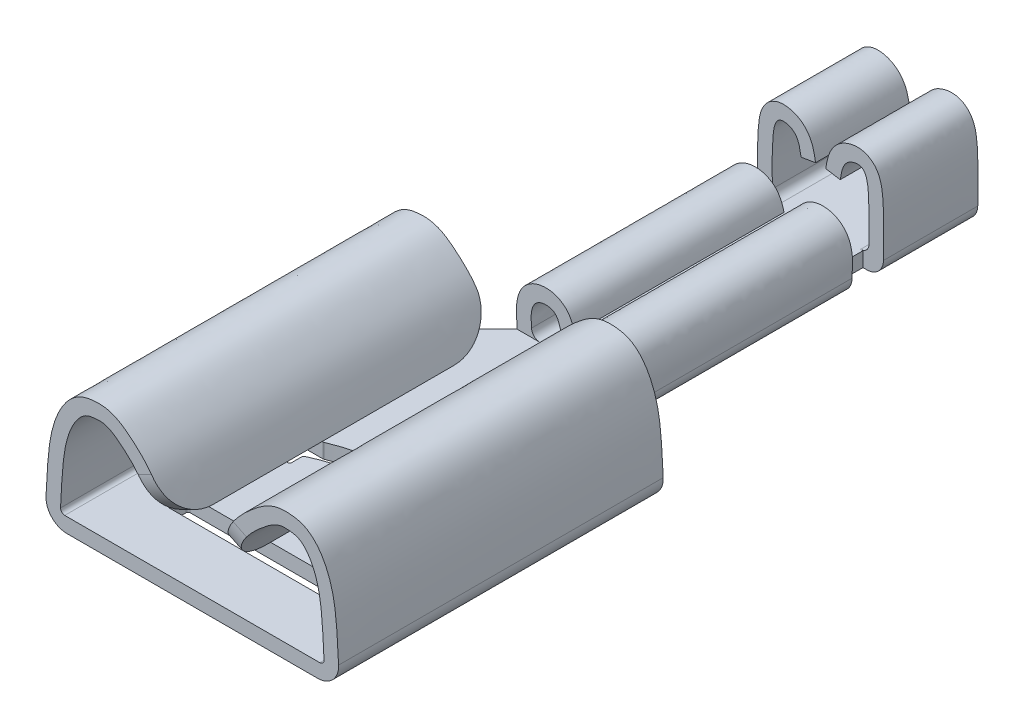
ISO-10303-21;
HEADER;
FILE_DESCRIPTION(('STEP AP214'),'2;1');
FILE_NAME('part.step','',(''),(''),'','','');
FILE_SCHEMA(('AUTOMOTIVE_DESIGN { 1 0 10303 214 1 1 1 1 }'));
ENDSEC;
DATA;
#1=APPLICATION_CONTEXT('core data for automotive mechanical design processes');
#2=APPLICATION_PROTOCOL_DEFINITION('international standard','automotive_design',2000,#1);
#3=PRODUCT_CONTEXT('',#1,'mechanical');
#4=PRODUCT('Part','Part','',(#3));
#5=PRODUCT_RELATED_PRODUCT_CATEGORY('part','',(#4));
#6=PRODUCT_DEFINITION_FORMATION('','',#4);
#7=PRODUCT_DEFINITION_CONTEXT('part definition',#1,'design');
#8=PRODUCT_DEFINITION('design','',#6,#7);
#9=PRODUCT_DEFINITION_SHAPE('','',#8);
#10=(LENGTH_UNIT() NAMED_UNIT(*) SI_UNIT(.MILLI.,.METRE.));
#11=(NAMED_UNIT(*) PLANE_ANGLE_UNIT() SI_UNIT($,.RADIAN.));
#12=(NAMED_UNIT(*) SI_UNIT($,.STERADIAN.) SOLID_ANGLE_UNIT());
#13=UNCERTAINTY_MEASURE_WITH_UNIT(LENGTH_MEASURE(1.E-05),#10,'distance_accuracy_value','');
#14=(GEOMETRIC_REPRESENTATION_CONTEXT(3) GLOBAL_UNCERTAINTY_ASSIGNED_CONTEXT((#13)) GLOBAL_UNIT_ASSIGNED_CONTEXT((#10,
#11,#12)) REPRESENTATION_CONTEXT('',''));
#15=CARTESIAN_POINT('',(0.,0.,0.));
#16=DIRECTION('',(0.,0.,1.));
#17=DIRECTION('',(1.,0.,0.));
#18=AXIS2_PLACEMENT_3D('',#15,#16,#17);
#19=CARTESIAN_POINT('',(-1.13775688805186,1.62936482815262,-7.25));
#20=DIRECTION('',(0.,0.,1.));
#21=DIRECTION('',(1.,0.,0.));
#22=AXIS2_PLACEMENT_3D('',#19,#20,#21);
#23=PLANE('',#22);
#24=CARTESIAN_POINT('',(-1.49995088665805,0.344136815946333,-7.25));
#25=CARTESIAN_POINT('',(-1.50176345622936,0.452322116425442,-7.25));
#26=CARTESIAN_POINT('',(-1.5053609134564,0.67062883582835,-7.25));
#27=CARTESIAN_POINT('',(-1.50899046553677,0.986503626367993,-7.25));
#28=CARTESIAN_POINT('',(-1.50729578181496,1.29617840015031,-7.25));
#29=CARTESIAN_POINT('',(-1.4959976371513,1.57571130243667,-7.25));
#30=CARTESIAN_POINT('',(-1.46568458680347,1.87615099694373,-7.25));
#31=CARTESIAN_POINT('',(-1.40642260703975,2.0962836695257,-7.25));
#32=CARTESIAN_POINT('',(-1.26621802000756,2.29345812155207,-7.25));
#33=CARTESIAN_POINT('',(-1.06968250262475,2.41259365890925,-7.25));
#34=CARTESIAN_POINT('',(-0.872846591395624,2.43398944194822,-7.25));
#35=CARTESIAN_POINT('',(-0.65958394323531,2.40356271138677,-7.25));
#36=CARTESIAN_POINT('',(-0.405879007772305,2.28200691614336,-7.25));
#37=CARTESIAN_POINT('',(-0.219166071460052,2.02322081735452,-7.25));
#38=CARTESIAN_POINT('',(-0.151981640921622,1.78702365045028,-7.25));
#39=CARTESIAN_POINT('',(-0.13209707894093,1.667490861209,-7.25));
#40=CARTESIAN_POINT('',(-0.12137333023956,1.60256903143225,-7.25));
#41=B_SPLINE_CURVE_WITH_KNOTS('',3,(#24,#25,#26,#27,#28,#29,#30,#31,#32,#33,#34,#35,#36,#37,#38,
#39,#40),.UNSPECIFIED.,.F.,.F.,(4,1,1,1,1,1,1,1,1,1,1,1,1,1,4),(0.,0.125,0.25,0.375,0.5,0.5625,
0.625,0.65625,0.6875,0.71875,0.75,0.8125,0.875,0.9375,1.),.UNSPECIFIED.);
#42=CARTESIAN_POINT('',(-1.50077258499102,0.393352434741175,-7.25));
#43=VERTEX_POINT('',#42);
#44=CARTESIAN_POINT('',(-0.12137333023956,1.60256903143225,-7.25));
#45=VERTEX_POINT('',#44);
#46=EDGE_CURVE('E710',#43,#45,#41,.T.);
#47=ORIENTED_EDGE('',*,*,#46,.F.);
#48=CARTESIAN_POINT('',(-1.10082782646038,0.400000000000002,-7.25));
#49=DIRECTION('',(0.,0.,1.));
#50=DIRECTION('',(1.,0.,0.));
#51=AXIS2_PLACEMENT_3D('',#48,#49,#50);
#52=CIRCLE('',#51,0.4);
#53=CARTESIAN_POINT('',(-1.10082782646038,0.,-7.25));
#54=VERTEX_POINT('',#53);
#55=EDGE_CURVE('E703',#43,#54,#52,.T.);
#56=ORIENTED_EDGE('',*,*,#55,.T.);
#57=DIRECTION('',(1.,0.,0.));
#58=VECTOR('',#57,1.);
#59=CARTESIAN_POINT('',(0.,0.,-7.25));
#60=LINE('',#59,#58);
#61=CARTESIAN_POINT('',(-1.01065335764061,0.,-7.25));
#62=VERTEX_POINT('',#61);
#63=EDGE_CURVE('E2090',#54,#62,#60,.T.);
#64=ORIENTED_EDGE('',*,*,#63,.T.);
#65=DIRECTION('',(0.,1.,0.));
#66=VECTOR('',#65,1.);
#67=CARTESIAN_POINT('',(-1.01065335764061,-1.9,-7.25));
#68=LINE('',#67,#66);
#69=CARTESIAN_POINT('',(-1.01065335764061,0.35,-7.25));
#70=VERTEX_POINT('',#69);
#71=EDGE_CURVE('E517',#62,#70,#68,.T.);
#72=ORIENTED_EDGE('',*,*,#71,.T.);
#73=DIRECTION('',(1.,0.,0.));
#74=VECTOR('',#73,1.);
#75=CARTESIAN_POINT('',(0.,0.35,-7.25));
#76=LINE('',#75,#74);
#77=CARTESIAN_POINT('',(-0.953251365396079,0.35,-7.25));
#78=VERTEX_POINT('',#77);
#79=EDGE_CURVE('E525',#70,#78,#76,.T.);
#80=ORIENTED_EDGE('',*,*,#79,.T.);
#81=CARTESIAN_POINT('',(-0.953251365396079,0.55,-7.25));
#82=DIRECTION('',(0.,0.,1.));
#83=DIRECTION('',(1.,0.,0.));
#84=AXIS2_PLACEMENT_3D('',#81,#82,#83);
#85=CIRCLE('',#84,0.2);
#86=CARTESIAN_POINT('',(-1.15322684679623,0.546868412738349,-7.25));
#87=VERTEX_POINT('',#86);
#88=EDGE_CURVE('E1078',#78,#87,#85,.F.);
#89=ORIENTED_EDGE('',*,*,#88,.T.);
#90=CARTESIAN_POINT('',(-0.466694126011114,1.54552915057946,-7.25));
#91=CARTESIAN_POINT('',(-0.497217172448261,1.73031639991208,-7.25));
#92=CARTESIAN_POINT('',(-0.545064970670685,2.01998810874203,-7.25));
#93=CARTESIAN_POINT('',(-1.08893724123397,2.14141243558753,-7.25));
#94=CARTESIAN_POINT('',(-1.15582984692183,1.51056667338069,-7.25));
#95=CARTESIAN_POINT('',(-1.16067747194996,0.987297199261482,-7.25));
#96=CARTESIAN_POINT('',(-1.15361350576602,0.565676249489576,-7.25));
#97=CARTESIAN_POINT('',(-1.15,0.35,-7.25));
#98=B_SPLINE_CURVE_WITH_KNOTS('',3,(#90,#91,#92,#93,#94,#95,#96,#97),.UNSPECIFIED.,.F.,.F.,(4,1,
1,1,1,4),(0.,0.200401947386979,0.314149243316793,0.513803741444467,0.751290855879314,1.),.UNSPECIFIED.);
#99=CARTESIAN_POINT('',(-0.466694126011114,1.54552915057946,-7.25));
#100=VERTEX_POINT('',#99);
#101=EDGE_CURVE('E714',#100,#87,#98,.T.);
#102=ORIENTED_EDGE('',*,*,#101,.F.);
#103=DIRECTION('',(-0.986630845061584,-0.162971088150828,0.));
#104=VECTOR('',#103,1.);
#105=CARTESIAN_POINT('',(-0.12137333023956,1.60256903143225,-7.25));
#106=LINE('',#105,#104);
#107=EDGE_CURVE('E713',#45,#100,#106,.T.);
#108=ORIENTED_EDGE('',*,*,#107,.F.);
#109=EDGE_LOOP('',(#47,#56,#64,#72,#80,#89,#102,#108));
#110=FACE_BOUND('',#109,.T.);
#111=ADVANCED_FACE('F31',(#110),#23,.T.);
#112=CARTESIAN_POINT('',(1.13775688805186,1.62936482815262,-7.25));
#113=DIRECTION('',(0.,0.,1.));
#114=DIRECTION('',(-1.,0.,0.));
#115=AXIS2_PLACEMENT_3D('',#112,#113,#114);
#116=PLANE('',#115);
#117=DIRECTION('',(1.,0.,0.));
#118=VECTOR('',#117,1.);
#119=CARTESIAN_POINT('',(0.,0.,-7.25));
#120=LINE('',#119,#118);
#121=CARTESIAN_POINT('',(1.01065335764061,0.,-7.25));
#122=VERTEX_POINT('',#121);
#123=CARTESIAN_POINT('',(1.10082782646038,0.,-7.25));
#124=VERTEX_POINT('',#123);
#125=EDGE_CURVE('E617',#122,#124,#120,.T.);
#126=ORIENTED_EDGE('',*,*,#125,.T.);
#127=CARTESIAN_POINT('',(1.10082782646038,0.400000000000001,-7.25));
#128=DIRECTION('',(0.,0.,1.));
#129=DIRECTION('',(1.,0.,0.));
#130=AXIS2_PLACEMENT_3D('',#127,#128,#129);
#131=CIRCLE('',#130,0.4);
#132=CARTESIAN_POINT('',(1.50077258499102,0.393352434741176,-7.25));
#133=VERTEX_POINT('',#132);
#134=EDGE_CURVE('E679',#124,#133,#131,.T.);
#135=ORIENTED_EDGE('',*,*,#134,.T.);
#136=CARTESIAN_POINT('',(1.49995088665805,0.344136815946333,-7.25));
#137=CARTESIAN_POINT('',(1.50176345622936,0.452322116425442,-7.25));
#138=CARTESIAN_POINT('',(1.5053609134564,0.67062883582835,-7.25));
#139=CARTESIAN_POINT('',(1.50899046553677,0.986503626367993,-7.25));
#140=CARTESIAN_POINT('',(1.50729578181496,1.29617840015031,-7.25));
#141=CARTESIAN_POINT('',(1.4959976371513,1.57571130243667,-7.25));
#142=CARTESIAN_POINT('',(1.46568458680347,1.87615099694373,-7.25));
#143=CARTESIAN_POINT('',(1.40642260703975,2.0962836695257,-7.25));
#144=CARTESIAN_POINT('',(1.26621802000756,2.29345812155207,-7.25));
#145=CARTESIAN_POINT('',(1.06968250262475,2.41259365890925,-7.25));
#146=CARTESIAN_POINT('',(0.872846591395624,2.43398944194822,-7.25));
#147=CARTESIAN_POINT('',(0.65958394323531,2.40356271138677,-7.25));
#148=CARTESIAN_POINT('',(0.405879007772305,2.28200691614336,-7.25));
#149=CARTESIAN_POINT('',(0.219166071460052,2.02322081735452,-7.25));
#150=CARTESIAN_POINT('',(0.151981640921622,1.78702365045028,-7.25));
#151=CARTESIAN_POINT('',(0.13209707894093,1.667490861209,-7.25));
#152=CARTESIAN_POINT('',(0.12137333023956,1.60256903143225,-7.25));
#153=B_SPLINE_CURVE_WITH_KNOTS('',3,(#136,#137,#138,#139,#140,#141,#142,#143,#144,#145,#146,
#147,#148,#149,#150,#151,#152),.UNSPECIFIED.,.F.,.F.,(4,1,1,1,1,1,1,1,1,1,1,1,1,1,4),(0.,0.125,
0.25,0.375,0.5,0.5625,0.625,0.65625,0.6875,0.71875,0.75,0.8125,0.875,0.9375,1.),.UNSPECIFIED.);
#154=CARTESIAN_POINT('',(0.12137333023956,1.60256903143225,-7.25));
#155=VERTEX_POINT('',#154);
#156=EDGE_CURVE('E673',#133,#155,#153,.T.);
#157=ORIENTED_EDGE('',*,*,#156,.T.);
#158=DIRECTION('',(0.986630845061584,-0.162971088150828,0.));
#159=VECTOR('',#158,1.);
#160=CARTESIAN_POINT('',(0.12137333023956,1.60256903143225,-7.25));
#161=LINE('',#160,#159);
#162=CARTESIAN_POINT('',(0.466694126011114,1.54552915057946,-7.25));
#163=VERTEX_POINT('',#162);
#164=EDGE_CURVE('E662',#155,#163,#161,.T.);
#165=ORIENTED_EDGE('',*,*,#164,.T.);
#166=CARTESIAN_POINT('',(0.466694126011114,1.54552915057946,-7.25));
#167=CARTESIAN_POINT('',(0.497217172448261,1.73031639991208,-7.25));
#168=CARTESIAN_POINT('',(0.545064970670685,2.01998810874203,-7.25));
#169=CARTESIAN_POINT('',(1.08893724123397,2.14141243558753,-7.25));
#170=CARTESIAN_POINT('',(1.15582984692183,1.51056667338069,-7.25));
#171=CARTESIAN_POINT('',(1.16067747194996,0.987297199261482,-7.25));
#172=CARTESIAN_POINT('',(1.15361350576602,0.565676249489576,-7.25));
#173=CARTESIAN_POINT('',(1.15,0.35,-7.25));
#174=B_SPLINE_CURVE_WITH_KNOTS('',3,(#166,#167,#168,#169,#170,#171,#172,#173),.UNSPECIFIED.,.F.,
.F.,(4,1,1,1,1,4),(0.,0.200401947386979,0.314149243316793,0.513803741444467,0.751290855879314,
1.),.UNSPECIFIED.);
#175=CARTESIAN_POINT('',(1.15322684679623,0.546868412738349,-7.25));
#176=VERTEX_POINT('',#175);
#177=EDGE_CURVE('E697',#163,#176,#174,.T.);
#178=ORIENTED_EDGE('',*,*,#177,.T.);
#179=CARTESIAN_POINT('',(0.953251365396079,0.55,-7.25));
#180=DIRECTION('',(0.,0.,1.));
#181=DIRECTION('',(1.,0.,0.));
#182=AXIS2_PLACEMENT_3D('',#179,#180,#181);
#183=CIRCLE('',#182,0.2);
#184=CARTESIAN_POINT('',(0.953251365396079,0.35,-7.25));
#185=VERTEX_POINT('',#184);
#186=EDGE_CURVE('E1085',#176,#185,#183,.F.);
#187=ORIENTED_EDGE('',*,*,#186,.T.);
#188=DIRECTION('',(1.,0.,0.));
#189=VECTOR('',#188,1.);
#190=CARTESIAN_POINT('',(0.,0.35,-7.25));
#191=LINE('',#190,#189);
#192=CARTESIAN_POINT('',(1.01065335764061,0.35,-7.25));
#193=VERTEX_POINT('',#192);
#194=EDGE_CURVE('E2126',#185,#193,#191,.T.);
#195=ORIENTED_EDGE('',*,*,#194,.T.);
#196=DIRECTION('',(0.,1.,0.));
#197=VECTOR('',#196,1.);
#198=CARTESIAN_POINT('',(1.01065335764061,-1.9,-7.25));
#199=LINE('',#198,#197);
#200=EDGE_CURVE('E2097',#122,#193,#199,.T.);
#201=ORIENTED_EDGE('',*,*,#200,.F.);
#202=EDGE_LOOP('',(#126,#135,#157,#165,#178,#187,#195,#201));
#203=FACE_BOUND('',#202,.T.);
#204=ADVANCED_FACE('F645',(#203),#116,.T.);
#205=CARTESIAN_POINT('',(0.,0.35,0.));
#206=DIRECTION('',(0.,1.,0.));
#207=DIRECTION('',(0.,0.,1.));
#208=AXIS2_PLACEMENT_3D('',#205,#206,#207);
#209=PLANE('',#208);
#210=DIRECTION('',(0.,0.,-1.));
#211=VECTOR('',#210,1.);
#212=CARTESIAN_POINT('',(-1.01065335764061,0.35,-6.5));
#213=LINE('',#212,#211);
#214=CARTESIAN_POINT('',(-1.01065335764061,0.35,-6.5));
#215=VERTEX_POINT('',#214);
#216=EDGE_CURVE('E509',#215,#70,#213,.T.);
#217=ORIENTED_EDGE('',*,*,#216,.F.);
#218=DIRECTION('',(-0.999999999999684,7.95554691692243E-07,0.));
#219=VECTOR('',#218,1.);
#220=CARTESIAN_POINT('',(-1.15,0.35,-6.5));
#221=LINE('',#220,#219);
#222=CARTESIAN_POINT('',(-0.951927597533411,0.35,-6.5));
#223=VERTEX_POINT('',#222);
#224=EDGE_CURVE('E522',#223,#215,#221,.T.);
#225=ORIENTED_EDGE('',*,*,#224,.F.);
#226=DIRECTION('',(0.,0.,1.));
#227=VECTOR('',#226,1.);
#228=CARTESIAN_POINT('',(-0.951927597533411,0.35,-1.50000000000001));
#229=LINE('',#228,#227);
#230=CARTESIAN_POINT('',(-0.951927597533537,0.349999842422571,-1.50000000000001));
#231=VERTEX_POINT('',#230);
#232=EDGE_CURVE('E1063',#223,#231,#229,.T.);
#233=ORIENTED_EDGE('',*,*,#232,.T.);
#234=DIRECTION('',(-0.999999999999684,7.95554691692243E-07,0.));
#235=VECTOR('',#234,1.);
#236=CARTESIAN_POINT('',(-1.15,0.35,-1.50000000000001));
#237=LINE('',#236,#235);
#238=CARTESIAN_POINT('',(-1.49677637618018,0.350000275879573,-1.50000000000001));
#239=VERTEX_POINT('',#238);
#240=EDGE_CURVE('E630',#231,#239,#237,.T.);
#241=ORIENTED_EDGE('',*,*,#240,.T.);
#242=DIRECTION('',(0.,0.,-1.));
#243=VECTOR('',#242,1.);
#244=CARTESIAN_POINT('',(-1.49677637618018,0.350000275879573,-1.50000000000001));
#245=LINE('',#244,#243);
#246=CARTESIAN_POINT('',(-1.49677634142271,0.35,-1.5032236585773));
#247=VERTEX_POINT('',#246);
#248=EDGE_CURVE('E572',#239,#247,#245,.T.);
#249=ORIENTED_EDGE('',*,*,#248,.T.);
#250=DIRECTION('',(-0.707106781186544,0.,0.707106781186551));
#251=VECTOR('',#250,1.);
#252=CARTESIAN_POINT('',(-1.5,0.35,-1.50000000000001));
#253=LINE('',#252,#251);
#254=CARTESIAN_POINT('',(-2.99999999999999,0.35,0.));
#255=VERTEX_POINT('',#254);
#256=EDGE_CURVE('E53',#247,#255,#253,.T.);
#257=ORIENTED_EDGE('',*,*,#256,.T.);
#258=DIRECTION('',(-1.,0.,0.));
#259=VECTOR('',#258,1.);
#260=CARTESIAN_POINT('',(0.,0.35,0.));
#261=LINE('',#260,#259);
#262=CARTESIAN_POINT('',(-3.0450308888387,0.35,0.));
#263=VERTEX_POINT('',#262);
#264=EDGE_CURVE('E916',#255,#263,#261,.T.);
#265=ORIENTED_EDGE('',*,*,#264,.T.);
#266=DIRECTION('',(0.,0.,1.));
#267=VECTOR('',#266,1.);
#268=CARTESIAN_POINT('',(-3.0450308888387,0.35,7.75));
#269=LINE('',#268,#267);
#270=CARTESIAN_POINT('',(-3.0450308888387,0.35,7.75));
#271=VERTEX_POINT('',#270);
#272=EDGE_CURVE('E1029',#263,#271,#269,.T.);
#273=ORIENTED_EDGE('',*,*,#272,.T.);
#274=DIRECTION('',(-1.,0.,0.));
#275=VECTOR('',#274,1.);
#276=CARTESIAN_POINT('',(0.,0.35,7.75));
#277=LINE('',#276,#275);
#278=CARTESIAN_POINT('',(3.0450308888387,0.35,7.75));
#279=VERTEX_POINT('',#278);
#280=EDGE_CURVE('E912',#279,#271,#277,.T.);
#281=ORIENTED_EDGE('',*,*,#280,.F.);
#282=DIRECTION('',(0.,0.,-1.));
#283=VECTOR('',#282,1.);
#284=CARTESIAN_POINT('',(3.0450308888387,0.35,0.));
#285=LINE('',#284,#283);
#286=CARTESIAN_POINT('',(3.0450308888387,0.35,0.));
#287=VERTEX_POINT('',#286);
#288=EDGE_CURVE('E1027',#279,#287,#285,.T.);
#289=ORIENTED_EDGE('',*,*,#288,.T.);
#290=CARTESIAN_POINT('',(2.99999999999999,0.35,0.));
#291=VERTEX_POINT('',#290);
#292=EDGE_CURVE('E913',#287,#291,#261,.T.);
#293=ORIENTED_EDGE('',*,*,#292,.T.);
#294=DIRECTION('',(-0.707106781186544,0.,-0.707106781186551));
#295=VECTOR('',#294,1.);
#296=CARTESIAN_POINT('',(1.5,0.35,-1.50000000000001));
#297=LINE('',#296,#295);
#298=CARTESIAN_POINT('',(1.49677634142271,0.35,-1.5032236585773));
#299=VERTEX_POINT('',#298);
#300=EDGE_CURVE('E45',#291,#299,#297,.T.);
#301=ORIENTED_EDGE('',*,*,#300,.T.);
#302=DIRECTION('',(0.,0.,-1.));
#303=VECTOR('',#302,1.);
#304=CARTESIAN_POINT('',(1.49677634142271,0.35,-1.5032236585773));
#305=LINE('',#304,#303);
#306=CARTESIAN_POINT('',(1.49677637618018,0.350000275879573,-1.50000000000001));
#307=VERTEX_POINT('',#306);
#308=EDGE_CURVE('E11',#299,#307,#305,.F.);
#309=ORIENTED_EDGE('',*,*,#308,.T.);
#310=DIRECTION('',(0.999999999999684,7.95554691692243E-07,0.));
#311=VECTOR('',#310,1.);
#312=CARTESIAN_POINT('',(1.15,0.35,-1.50000000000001));
#313=LINE('',#312,#311);
#314=CARTESIAN_POINT('',(0.951927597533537,0.349999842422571,-1.50000000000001));
#315=VERTEX_POINT('',#314);
#316=EDGE_CURVE('E591',#315,#307,#313,.T.);
#317=ORIENTED_EDGE('',*,*,#316,.F.);
#318=DIRECTION('',(0.,0.,-1.));
#319=VECTOR('',#318,1.);
#320=CARTESIAN_POINT('',(0.951927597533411,0.35,0.));
#321=LINE('',#320,#319);
#322=CARTESIAN_POINT('',(0.951927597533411,0.35,-6.5));
#323=VERTEX_POINT('',#322);
#324=EDGE_CURVE('E1056',#315,#323,#321,.T.);
#325=ORIENTED_EDGE('',*,*,#324,.T.);
#326=DIRECTION('',(0.999999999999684,7.95554691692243E-07,0.));
#327=VECTOR('',#326,1.);
#328=CARTESIAN_POINT('',(1.15,0.35,-6.5));
#329=LINE('',#328,#327);
#330=CARTESIAN_POINT('',(1.0106533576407,0.349999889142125,-6.5));
#331=VERTEX_POINT('',#330);
#332=EDGE_CURVE('E546',#323,#331,#329,.T.);
#333=ORIENTED_EDGE('',*,*,#332,.T.);
#334=DIRECTION('',(0.,0.,1.));
#335=VECTOR('',#334,1.);
#336=CARTESIAN_POINT('',(1.01065335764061,0.35,-7.25));
#337=LINE('',#336,#335);
#338=EDGE_CURVE('E2092',#193,#331,#337,.T.);
#339=ORIENTED_EDGE('',*,*,#338,.F.);
#340=ORIENTED_EDGE('',*,*,#194,.F.);
#341=DIRECTION('',(0.,0.,-1.));
#342=VECTOR('',#341,1.);
#343=CARTESIAN_POINT('',(0.953251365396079,0.35,0.));
#344=LINE('',#343,#342);
#345=CARTESIAN_POINT('',(0.953251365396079,0.35,-9.5));
#346=VERTEX_POINT('',#345);
#347=EDGE_CURVE('E1061',#185,#346,#344,.T.);
#348=ORIENTED_EDGE('',*,*,#347,.T.);
#349=DIRECTION('',(1.,0.,0.));
#350=VECTOR('',#349,1.);
#351=CARTESIAN_POINT('',(1.5,0.35,-9.5));
#352=LINE('',#351,#350);
#353=CARTESIAN_POINT('',(-0.953251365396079,0.35,-9.5));
#354=VERTEX_POINT('',#353);
#355=EDGE_CURVE('E1175',#354,#346,#352,.T.);
#356=ORIENTED_EDGE('',*,*,#355,.F.);
#357=DIRECTION('',(0.,0.,1.));
#358=VECTOR('',#357,1.);
#359=CARTESIAN_POINT('',(-0.953251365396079,0.35,-7.25));
#360=LINE('',#359,#358);
#361=EDGE_CURVE('E1067',#354,#78,#360,.T.);
#362=ORIENTED_EDGE('',*,*,#361,.T.);
#363=ORIENTED_EDGE('',*,*,#79,.F.);
#364=EDGE_LOOP('',(#217,#225,#233,#241,#249,#257,#265,#273,#281,#289,#293,#301,#309,#317,#325,
#333,#339,#340,#348,#356,#362,#363));
#365=FACE_BOUND('',#364,.T.);
#366=CARTESIAN_POINT('',(1.95,0.35,6.29907448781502));
#367=DIRECTION('',(0.,1.,0.));
#368=DIRECTION('',(0.,0.,1.));
#369=AXIS2_PLACEMENT_3D('',#366,#367,#368);
#370=CIRCLE('',#369,0.0499999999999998);
#371=CARTESIAN_POINT('',(1.95,0.35,6.34907448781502));
#372=VERTEX_POINT('',#371);
#373=CARTESIAN_POINT('',(2.,0.35,6.29907448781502));
#374=VERTEX_POINT('',#373);
#375=EDGE_CURVE('E896',#372,#374,#370,.T.);
#376=ORIENTED_EDGE('',*,*,#375,.F.);
#377=DIRECTION('',(1.,0.,0.));
#378=VECTOR('',#377,1.);
#379=CARTESIAN_POINT('',(0.,0.35,6.34907448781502));
#380=LINE('',#379,#378);
#381=CARTESIAN_POINT('',(-1.95,0.35,6.34907448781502));
#382=VERTEX_POINT('',#381);
#383=EDGE_CURVE('E1345',#382,#372,#380,.T.);
#384=ORIENTED_EDGE('',*,*,#383,.F.);
#385=CARTESIAN_POINT('',(-1.95,0.35,6.29907448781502));
#386=DIRECTION('',(0.,1.,0.));
#387=DIRECTION('',(0.,0.,1.));
#388=AXIS2_PLACEMENT_3D('',#385,#386,#387);
#389=CIRCLE('',#388,0.0499999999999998);
#390=CARTESIAN_POINT('',(-2.,0.35,6.29907448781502));
#391=VERTEX_POINT('',#390);
#392=EDGE_CURVE('E1361',#391,#382,#389,.T.);
#393=ORIENTED_EDGE('',*,*,#392,.F.);
#394=DIRECTION('',(0.,0.,1.));
#395=VECTOR('',#394,1.);
#396=CARTESIAN_POINT('',(-2.,0.35,0.));
#397=LINE('',#396,#395);
#398=CARTESIAN_POINT('',(-2.,0.35,5.89907448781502));
#399=VERTEX_POINT('',#398);
#400=EDGE_CURVE('E1364',#399,#391,#397,.T.);
#401=ORIENTED_EDGE('',*,*,#400,.F.);
#402=CARTESIAN_POINT('',(-1.95,0.35,5.89907448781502));
#403=DIRECTION('',(0.,1.,0.));
#404=DIRECTION('',(0.,0.,1.));
#405=AXIS2_PLACEMENT_3D('',#402,#403,#404);
#406=CIRCLE('',#405,0.0499999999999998);
#407=CARTESIAN_POINT('',(-1.95,0.35,5.84907448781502));
#408=VERTEX_POINT('',#407);
#409=EDGE_CURVE('E1366',#408,#399,#406,.T.);
#410=ORIENTED_EDGE('',*,*,#409,.F.);
#411=DIRECTION('',(-1.,0.,0.));
#412=VECTOR('',#411,1.);
#413=CARTESIAN_POINT('',(0.,0.35,5.84907448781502));
#414=LINE('',#413,#412);
#415=CARTESIAN_POINT('',(1.95,0.35,5.84907448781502));
#416=VERTEX_POINT('',#415);
#417=EDGE_CURVE('E1368',#416,#408,#414,.T.);
#418=ORIENTED_EDGE('',*,*,#417,.F.);
#419=CARTESIAN_POINT('',(1.95,0.35,5.89907448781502));
#420=DIRECTION('',(0.,1.,0.));
#421=DIRECTION('',(0.,0.,1.));
#422=AXIS2_PLACEMENT_3D('',#419,#420,#421);
#423=CIRCLE('',#422,0.0499999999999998);
#424=CARTESIAN_POINT('',(2.,0.35,5.89907448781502));
#425=VERTEX_POINT('',#424);
#426=EDGE_CURVE('E1370',#425,#416,#423,.T.);
#427=ORIENTED_EDGE('',*,*,#426,.F.);
#428=DIRECTION('',(0.,0.,-1.));
#429=VECTOR('',#428,1.);
#430=CARTESIAN_POINT('',(2.,0.35,0.));
#431=LINE('',#430,#429);
#432=EDGE_CURVE('E1372',#374,#425,#431,.T.);
#433=ORIENTED_EDGE('',*,*,#432,.F.);
#434=EDGE_LOOP('',(#376,#384,#393,#401,#410,#418,#427,#433));
#435=FACE_BOUND('',#434,.T.);
#436=CARTESIAN_POINT('',(1.95,0.35,3.2));
#437=DIRECTION('',(0.,1.,0.));
#438=DIRECTION('',(0.,0.,1.));
#439=AXIS2_PLACEMENT_3D('',#436,#437,#438);
#440=CIRCLE('',#439,0.05);
#441=CARTESIAN_POINT('',(2.,0.35,3.2));
#442=VERTEX_POINT('',#441);
#443=CARTESIAN_POINT('',(1.95,0.35,3.15));
#444=VERTEX_POINT('',#443);
#445=EDGE_CURVE('E1317',#442,#444,#440,.T.);
#446=ORIENTED_EDGE('',*,*,#445,.F.);
#447=DIRECTION('',(0.,0.,-1.));
#448=VECTOR('',#447,1.);
#449=CARTESIAN_POINT('',(2.,0.35,0.));
#450=LINE('',#449,#448);
#451=CARTESIAN_POINT('',(2.,0.35,3.95));
#452=VERTEX_POINT('',#451);
#453=EDGE_CURVE('E1240',#452,#442,#450,.T.);
#454=ORIENTED_EDGE('',*,*,#453,.F.);
#455=CARTESIAN_POINT('',(1.95,0.35,3.95));
#456=DIRECTION('',(0.,1.,0.));
#457=DIRECTION('',(0.,0.,1.));
#458=AXIS2_PLACEMENT_3D('',#455,#456,#457);
#459=CIRCLE('',#458,0.0499999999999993);
#460=CARTESIAN_POINT('',(1.95,0.35,4.));
#461=VERTEX_POINT('',#460);
#462=EDGE_CURVE('E1280',#461,#452,#459,.T.);
#463=ORIENTED_EDGE('',*,*,#462,.F.);
#464=DIRECTION('',(1.,0.,0.));
#465=VECTOR('',#464,1.);
#466=CARTESIAN_POINT('',(0.,0.35,4.));
#467=LINE('',#466,#465);
#468=CARTESIAN_POINT('',(1.47787847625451,0.35,4.));
#469=VERTEX_POINT('',#468);
#470=EDGE_CURVE('E1283',#469,#461,#467,.T.);
#471=ORIENTED_EDGE('',*,*,#470,.F.);
#472=CARTESIAN_POINT('',(1.47787847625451,0.35,3.95));
#473=DIRECTION('',(0.,1.,0.));
#474=DIRECTION('',(0.,0.,1.));
#475=AXIS2_PLACEMENT_3D('',#472,#473,#474);
#476=CIRCLE('',#475,0.0499999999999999);
#477=CARTESIAN_POINT('',(1.42787847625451,0.35,3.95));
#478=VERTEX_POINT('',#477);
#479=EDGE_CURVE('E1285',#478,#469,#476,.T.);
#480=ORIENTED_EDGE('',*,*,#479,.F.);
#481=DIRECTION('',(0.,0.,1.));
#482=VECTOR('',#481,1.);
#483=CARTESIAN_POINT('',(1.42787847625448,0.35,0.));
#484=LINE('',#483,#482);
#485=CARTESIAN_POINT('',(1.42787847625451,0.35,3.7109174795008));
#486=VERTEX_POINT('',#485);
#487=EDGE_CURVE('E1287',#486,#478,#484,.T.);
#488=ORIENTED_EDGE('',*,*,#487,.F.);
#489=CARTESIAN_POINT('',(1.37787847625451,0.35,3.7109174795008));
#490=DIRECTION('',(0.,1.,0.));
#491=DIRECTION('',(0.,0.,1.));
#492=AXIS2_PLACEMENT_3D('',#489,#490,#491);
#493=CIRCLE('',#492,0.05);
#494=CARTESIAN_POINT('',(1.39940782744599,0.35,3.66579002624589));
#495=VERTEX_POINT('',#494);
#496=EDGE_CURVE('E1289',#495,#486,#493,.F.);
#497=ORIENTED_EDGE('',*,*,#496,.F.);
#498=CARTESIAN_POINT('',(0.,0.35,6.59907448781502));
#499=DIRECTION('',(0.,1.,0.));
#500=DIRECTION('',(0.,0.,1.));
#501=AXIS2_PLACEMENT_3D('',#498,#499,#500);
#502=CIRCLE('',#501,3.25);
#503=CARTESIAN_POINT('',(-1.39940782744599,0.35,3.66579002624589));
#504=VERTEX_POINT('',#503);
#505=EDGE_CURVE('E1291',#504,#495,#502,.F.);
#506=ORIENTED_EDGE('',*,*,#505,.F.);
#507=CARTESIAN_POINT('',(-1.37787847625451,0.35,3.7109174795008));
#508=DIRECTION('',(0.,1.,0.));
#509=DIRECTION('',(0.,0.,1.));
#510=AXIS2_PLACEMENT_3D('',#507,#508,#509);
#511=CIRCLE('',#510,0.05);
#512=CARTESIAN_POINT('',(-1.42787847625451,0.35,3.7109174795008));
#513=VERTEX_POINT('',#512);
#514=EDGE_CURVE('E1293',#513,#504,#511,.F.);
#515=ORIENTED_EDGE('',*,*,#514,.F.);
#516=DIRECTION('',(0.,0.,-1.));
#517=VECTOR('',#516,1.);
#518=CARTESIAN_POINT('',(-1.42787847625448,0.35,0.));
#519=LINE('',#518,#517);
#520=CARTESIAN_POINT('',(-1.42787847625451,0.35,3.95));
#521=VERTEX_POINT('',#520);
#522=EDGE_CURVE('E1295',#521,#513,#519,.T.);
#523=ORIENTED_EDGE('',*,*,#522,.F.);
#524=CARTESIAN_POINT('',(-1.47787847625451,0.35,3.95));
#525=DIRECTION('',(0.,1.,0.));
#526=DIRECTION('',(0.,0.,1.));
#527=AXIS2_PLACEMENT_3D('',#524,#525,#526);
#528=CIRCLE('',#527,0.0499999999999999);
#529=CARTESIAN_POINT('',(-1.47787847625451,0.35,4.));
#530=VERTEX_POINT('',#529);
#531=EDGE_CURVE('E1297',#530,#521,#528,.T.);
#532=ORIENTED_EDGE('',*,*,#531,.F.);
#533=DIRECTION('',(1.,0.,0.));
#534=VECTOR('',#533,1.);
#535=CARTESIAN_POINT('',(0.,0.35,4.));
#536=LINE('',#535,#534);
#537=CARTESIAN_POINT('',(-1.95,0.35,4.));
#538=VERTEX_POINT('',#537);
#539=EDGE_CURVE('E1299',#538,#530,#536,.T.);
#540=ORIENTED_EDGE('',*,*,#539,.F.);
#541=CARTESIAN_POINT('',(-1.95,0.35,3.95));
#542=DIRECTION('',(0.,1.,0.));
#543=DIRECTION('',(0.,0.,1.));
#544=AXIS2_PLACEMENT_3D('',#541,#542,#543);
#545=CIRCLE('',#544,0.0499999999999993);
#546=CARTESIAN_POINT('',(-2.,0.35,3.95));
#547=VERTEX_POINT('',#546);
#548=EDGE_CURVE('E1301',#547,#538,#545,.T.);
#549=ORIENTED_EDGE('',*,*,#548,.F.);
#550=DIRECTION('',(0.,0.,1.));
#551=VECTOR('',#550,1.);
#552=CARTESIAN_POINT('',(-2.,0.35,0.));
#553=LINE('',#552,#551);
#554=CARTESIAN_POINT('',(-2.,0.35,3.2));
#555=VERTEX_POINT('',#554);
#556=EDGE_CURVE('E1303',#555,#547,#553,.T.);
#557=ORIENTED_EDGE('',*,*,#556,.F.);
#558=CARTESIAN_POINT('',(-1.95,0.35,3.2));
#559=DIRECTION('',(0.,1.,0.));
#560=DIRECTION('',(0.,0.,1.));
#561=AXIS2_PLACEMENT_3D('',#558,#559,#560);
#562=CIRCLE('',#561,0.05);
#563=CARTESIAN_POINT('',(-1.95,0.35,3.15));
#564=VERTEX_POINT('',#563);
#565=EDGE_CURVE('E1305',#564,#555,#562,.T.);
#566=ORIENTED_EDGE('',*,*,#565,.F.);
#567=DIRECTION('',(-1.,0.,0.));
#568=VECTOR('',#567,1.);
#569=CARTESIAN_POINT('',(0.,0.35,3.15));
#570=LINE('',#569,#568);
#571=CARTESIAN_POINT('',(-1.48205186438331,0.35,3.15));
#572=VERTEX_POINT('',#571);
#573=EDGE_CURVE('E1307',#572,#564,#570,.T.);
#574=ORIENTED_EDGE('',*,*,#573,.F.);
#575=CARTESIAN_POINT('',(-1.48205186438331,0.35,3.1));
#576=DIRECTION('',(0.,1.,0.));
#577=DIRECTION('',(0.,0.,1.));
#578=AXIS2_PLACEMENT_3D('',#575,#576,#577);
#579=CIRCLE('',#578,0.0499999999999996);
#580=CARTESIAN_POINT('',(-1.46255118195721,0.35,3.14604045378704));
#581=VERTEX_POINT('',#580);
#582=EDGE_CURVE('E1309',#581,#572,#579,.F.);
#583=ORIENTED_EDGE('',*,*,#582,.F.);
#584=CARTESIAN_POINT('',(0.,0.35,6.59907448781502));
#585=DIRECTION('',(0.,1.,0.));
#586=DIRECTION('',(0.,0.,1.));
#587=AXIS2_PLACEMENT_3D('',#584,#585,#586);
#588=CIRCLE('',#587,3.75);
#589=CARTESIAN_POINT('',(1.46255118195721,0.35,3.14604045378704));
#590=VERTEX_POINT('',#589);
#591=EDGE_CURVE('E1311',#590,#581,#588,.T.);
#592=ORIENTED_EDGE('',*,*,#591,.F.);
#593=CARTESIAN_POINT('',(1.48205186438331,0.35,3.1));
#594=DIRECTION('',(0.,1.,0.));
#595=DIRECTION('',(0.,0.,1.));
#596=AXIS2_PLACEMENT_3D('',#593,#594,#595);
#597=CIRCLE('',#596,0.050000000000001);
#598=CARTESIAN_POINT('',(1.48205186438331,0.35,3.15));
#599=VERTEX_POINT('',#598);
#600=EDGE_CURVE('E1313',#599,#590,#597,.F.);
#601=ORIENTED_EDGE('',*,*,#600,.F.);
#602=DIRECTION('',(-1.,0.,0.));
#603=VECTOR('',#602,1.);
#604=CARTESIAN_POINT('',(0.,0.35,3.15));
#605=LINE('',#604,#603);
#606=EDGE_CURVE('E1315',#444,#599,#605,.T.);
#607=ORIENTED_EDGE('',*,*,#606,.F.);
#608=EDGE_LOOP('',(#446,#454,#463,#471,#480,#488,#497,#506,#515,#523,#532,#540,#549,#557,#566,
#574,#583,#592,#601,#607));
#609=FACE_BOUND('',#608,.T.);
#610=ADVANCED_FACE('F519',(#365,#435,#609),#209,.T.);
#611=CARTESIAN_POINT('',(2.62134703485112,3.00876479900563,0.));
#612=DIRECTION('',(0.,0.,-1.));
#613=DIRECTION('',(-1.,0.,0.));
#614=AXIS2_PLACEMENT_3D('',#611,#612,#613);
#615=PLANE('',#614);
#616=CARTESIAN_POINT('',(2.99275253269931,0.5,0.));
#617=DIRECTION('',(0.,0.,-1.));
#618=DIRECTION('',(-1.,0.,0.));
#619=AXIS2_PLACEMENT_3D('',#616,#617,#618);
#620=CIRCLE('',#619,0.5);
#621=CARTESIAN_POINT('',(3.49222792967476,0.522898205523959,0.));
#622=VERTEX_POINT('',#621);
#623=CARTESIAN_POINT('',(2.99999999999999,5.25285415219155E-05,0.));
#624=VERTEX_POINT('',#623);
#625=EDGE_CURVE('E1018',#622,#624,#620,.T.);
#626=ORIENTED_EDGE('',*,*,#625,.T.);
#627=DIRECTION('',(0.,1.,0.));
#628=VECTOR('',#627,1.);
#629=CARTESIAN_POINT('',(2.99999999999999,3.00876479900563,0.));
#630=LINE('',#629,#628);
#631=EDGE_CURVE('E1045',#624,#291,#630,.T.);
#632=ORIENTED_EDGE('',*,*,#631,.T.);
#633=ORIENTED_EDGE('',*,*,#292,.F.);
#634=CARTESIAN_POINT('',(3.0450308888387,0.450000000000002,0.));
#635=DIRECTION('',(0.,0.,-1.));
#636=DIRECTION('',(-1.,0.,0.));
#637=AXIS2_PLACEMENT_3D('',#634,#635,#636);
#638=CIRCLE('',#637,0.1);
#639=CARTESIAN_POINT('',(3.14492588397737,0.454581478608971,0.));
#640=VERTEX_POINT('',#639);
#641=EDGE_CURVE('E1041',#287,#640,#638,.F.);
#642=ORIENTED_EDGE('',*,*,#641,.T.);
#643=CARTESIAN_POINT('',(0.81437573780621,1.1961562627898,0.));
#644=CARTESIAN_POINT('',(0.917647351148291,1.40718916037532,0.));
#645=CARTESIAN_POINT('',(1.09436215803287,1.76651250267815,0.));
#646=CARTESIAN_POINT('',(1.2745372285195,2.05862757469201,0.));
#647=CARTESIAN_POINT('',(1.42319904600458,2.23309632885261,0.));
#648=CARTESIAN_POINT('',(1.61251431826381,2.40797134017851,0.));
#649=CARTESIAN_POINT('',(1.85597074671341,2.60921521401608,0.));
#650=CARTESIAN_POINT('',(2.04752898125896,2.70516855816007,0.));
#651=CARTESIAN_POINT('',(2.17955793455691,2.72915703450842,0.));
#652=CARTESIAN_POINT('',(2.39224522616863,2.71033374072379,0.));
#653=CARTESIAN_POINT('',(2.53335552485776,2.67795106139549,0.));
#654=CARTESIAN_POINT('',(2.67816178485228,2.57663415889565,0.));
#655=CARTESIAN_POINT('',(2.84890816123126,2.33645003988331,0.));
#656=CARTESIAN_POINT('',(2.97021580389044,2.03992421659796,0.));
#657=CARTESIAN_POINT('',(3.06817368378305,1.63271940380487,0.));
#658=CARTESIAN_POINT('',(3.11684814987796,1.05694767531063,0.));
#659=CARTESIAN_POINT('',(3.13970838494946,0.573459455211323,0.));
#660=CARTESIAN_POINT('',(3.15034611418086,0.334438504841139,0.));
#661=B_SPLINE_CURVE_WITH_KNOTS('',3,(#643,#644,#645,#646,#647,#648,#649,#650,#651,#652,#653,
#654,#655,#656,#657,#658,#659,#660),.UNSPECIFIED.,.F.,.F.,(4,1,1,1,1,1,1,1,1,1,1,1,1,1,1,4),(0.,
0.125,0.1875,0.25,0.28125,0.3125,0.375,0.4375,0.46875,0.5,0.5625,0.625,0.6875,0.75,0.875,1.),.UNSPECIFIED.);
#662=CARTESIAN_POINT('',(1.29467160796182,2.07443487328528,0.));
#663=VERTEX_POINT('',#662);
#664=EDGE_CURVE('E928',#663,#640,#661,.T.);
#665=ORIENTED_EDGE('',*,*,#664,.F.);
#666=DIRECTION('',(0.898216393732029,-0.439553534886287,0.));
#667=VECTOR('',#666,1.);
#668=CARTESIAN_POINT('',(0.939553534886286,2.24821639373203,0.));
#669=LINE('',#668,#667);
#670=CARTESIAN_POINT('',(0.97555340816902,2.23059940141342,0.));
#671=VERTEX_POINT('',#670);
#672=EDGE_CURVE('E963',#663,#671,#669,.F.);
#673=ORIENTED_EDGE('',*,*,#672,.T.);
#674=CARTESIAN_POINT('',(3.5,0.35,0.));
#675=CARTESIAN_POINT('',(3.48596153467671,0.66543266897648,0.));
#676=CARTESIAN_POINT('',(3.45611364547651,1.33608997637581,0.));
#677=CARTESIAN_POINT('',(3.32474935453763,2.33762685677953,0.));
#678=CARTESIAN_POINT('',(2.84542826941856,2.99030080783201,0.));
#679=CARTESIAN_POINT('',(2.0889652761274,3.1096068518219,0.));
#680=CARTESIAN_POINT('',(1.84768518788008,3.05648836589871,0.));
#681=CARTESIAN_POINT('',(1.11337053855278,2.44804734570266,0.));
#682=CARTESIAN_POINT('',(0.87223219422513,2.11064695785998,0.));
#683=CARTESIAN_POINT('',(0.609792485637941,1.57435813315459,0.));
#684=CARTESIAN_POINT('',(0.5,1.35,0.));
#685=B_SPLINE_CURVE_WITH_KNOTS('',3,(#674,#675,#676,#677,#678,#679,#680,#681,#682,#683,#684),
.UNSPECIFIED.,.F.,.F.,(4,1,1,2,2,1,4),(0.,0.16289845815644,0.346346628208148,0.525762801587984,
0.704901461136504,0.876544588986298,1.),.UNSPECIFIED.);
#686=EDGE_CURVE('E915',#622,#671,#685,.T.);
#687=ORIENTED_EDGE('',*,*,#686,.F.);
#688=EDGE_LOOP('',(#626,#632,#633,#642,#665,#673,#687));
#689=FACE_BOUND('',#688,.T.);
#690=ADVANCED_FACE('F1414',(#689),#615,.T.);
#691=ORIENTED_EDGE('',*,*,#264,.F.);
#692=DIRECTION('',(0.,-1.,0.));
#693=VECTOR('',#692,1.);
#694=CARTESIAN_POINT('',(-2.99999999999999,3.00876479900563,0.));
#695=LINE('',#694,#693);
#696=CARTESIAN_POINT('',(-2.99999999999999,5.25285415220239E-05,0.));
#697=VERTEX_POINT('',#696);
#698=EDGE_CURVE('E1043',#255,#697,#695,.T.);
#699=ORIENTED_EDGE('',*,*,#698,.T.);
#700=CARTESIAN_POINT('',(-2.99275253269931,0.5,0.));
#701=DIRECTION('',(0.,0.,-1.));
#702=DIRECTION('',(-1.,0.,0.));
#703=AXIS2_PLACEMENT_3D('',#700,#701,#702);
#704=CIRCLE('',#703,0.5);
#705=CARTESIAN_POINT('',(-3.49222792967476,0.522898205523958,0.));
#706=VERTEX_POINT('',#705);
#707=EDGE_CURVE('E1016',#697,#706,#704,.T.);
#708=ORIENTED_EDGE('',*,*,#707,.T.);
#709=CARTESIAN_POINT('',(-3.5,0.35,0.));
#710=CARTESIAN_POINT('',(-3.48596153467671,0.66543266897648,0.));
#711=CARTESIAN_POINT('',(-3.45611364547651,1.33608997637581,0.));
#712=CARTESIAN_POINT('',(-3.32474935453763,2.33762685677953,0.));
#713=CARTESIAN_POINT('',(-2.84542826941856,2.99030080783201,0.));
#714=CARTESIAN_POINT('',(-2.0889652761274,3.1096068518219,0.));
#715=CARTESIAN_POINT('',(-1.84768518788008,3.05648836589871,0.));
#716=CARTESIAN_POINT('',(-1.11337053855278,2.44804734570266,0.));
#717=CARTESIAN_POINT('',(-0.87223219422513,2.11064695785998,0.));
#718=CARTESIAN_POINT('',(-0.609792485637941,1.57435813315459,0.));
#719=CARTESIAN_POINT('',(-0.5,1.35,0.));
#720=B_SPLINE_CURVE_WITH_KNOTS('',3,(#709,#710,#711,#712,#713,#714,#715,#716,#717,#718,#719),
.UNSPECIFIED.,.F.,.F.,(4,1,1,2,2,1,4),(0.,0.16289845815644,0.346346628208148,0.525762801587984,
0.704901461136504,0.876544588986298,1.),.UNSPECIFIED.);
#721=CARTESIAN_POINT('',(-0.97555340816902,2.23059940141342,0.));
#722=VERTEX_POINT('',#721);
#723=EDGE_CURVE('E888',#706,#722,#720,.T.);
#724=ORIENTED_EDGE('',*,*,#723,.T.);
#725=DIRECTION('',(-0.898216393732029,-0.439553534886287,0.));
#726=VECTOR('',#725,1.);
#727=CARTESIAN_POINT('',(2.23363031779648,3.80105398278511,0.));
#728=LINE('',#727,#726);
#729=CARTESIAN_POINT('',(-1.29467161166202,2.07443487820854,0.));
#730=VERTEX_POINT('',#729);
#731=EDGE_CURVE('E1002',#722,#730,#728,.T.);
#732=ORIENTED_EDGE('',*,*,#731,.T.);
#733=CARTESIAN_POINT('',(-0.81437573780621,1.1961562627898,0.));
#734=CARTESIAN_POINT('',(-0.917647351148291,1.40718916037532,0.));
#735=CARTESIAN_POINT('',(-1.09436215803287,1.76651250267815,0.));
#736=CARTESIAN_POINT('',(-1.2745372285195,2.05862757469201,0.));
#737=CARTESIAN_POINT('',(-1.42319904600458,2.23309632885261,0.));
#738=CARTESIAN_POINT('',(-1.61251431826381,2.40797134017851,0.));
#739=CARTESIAN_POINT('',(-1.85597074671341,2.60921521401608,0.));
#740=CARTESIAN_POINT('',(-2.04752898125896,2.70516855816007,0.));
#741=CARTESIAN_POINT('',(-2.17955793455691,2.72915703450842,0.));
#742=CARTESIAN_POINT('',(-2.39224522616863,2.71033374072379,0.));
#743=CARTESIAN_POINT('',(-2.53335552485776,2.67795106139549,0.));
#744=CARTESIAN_POINT('',(-2.67816178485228,2.57663415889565,0.));
#745=CARTESIAN_POINT('',(-2.84890816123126,2.33645003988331,0.));
#746=CARTESIAN_POINT('',(-2.97021580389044,2.03992421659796,0.));
#747=CARTESIAN_POINT('',(-3.06817368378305,1.63271940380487,0.));
#748=CARTESIAN_POINT('',(-3.11684814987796,1.05694767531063,0.));
#749=CARTESIAN_POINT('',(-3.13970838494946,0.573459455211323,0.));
#750=CARTESIAN_POINT('',(-3.15034611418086,0.334438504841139,0.));
#751=B_SPLINE_CURVE_WITH_KNOTS('',3,(#733,#734,#735,#736,#737,#738,#739,#740,#741,#742,#743,
#744,#745,#746,#747,#748,#749,#750),.UNSPECIFIED.,.F.,.F.,(4,1,1,1,1,1,1,1,1,1,1,1,1,1,1,4),(0.,
0.125,0.1875,0.25,0.28125,0.3125,0.375,0.4375,0.46875,0.5,0.5625,0.625,0.6875,0.75,0.875,1.),.UNSPECIFIED.);
#752=CARTESIAN_POINT('',(-3.14492588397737,0.454581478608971,0.));
#753=VERTEX_POINT('',#752);
#754=EDGE_CURVE('E895',#730,#753,#751,.T.);
#755=ORIENTED_EDGE('',*,*,#754,.T.);
#756=CARTESIAN_POINT('',(-3.0450308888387,0.450000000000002,0.));
#757=DIRECTION('',(0.,0.,-1.));
#758=DIRECTION('',(-1.,0.,0.));
#759=AXIS2_PLACEMENT_3D('',#756,#757,#758);
#760=CIRCLE('',#759,0.1);
#761=EDGE_CURVE('E1034',#753,#263,#760,.F.);
#762=ORIENTED_EDGE('',*,*,#761,.T.);
#763=EDGE_LOOP('',(#691,#699,#708,#724,#732,#755,#762));
#764=FACE_BOUND('',#763,.T.);
#765=ADVANCED_FACE('F943',(#764),#615,.T.);
#766=CARTESIAN_POINT('',(3.5,0.35,7.75));
#767=CARTESIAN_POINT('',(3.48596153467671,0.66543266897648,7.75));
#768=CARTESIAN_POINT('',(3.45611364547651,1.33608997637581,7.75));
#769=CARTESIAN_POINT('',(3.32474935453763,2.33762685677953,7.75));
#770=CARTESIAN_POINT('',(2.84542826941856,2.99030080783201,7.75));
#771=CARTESIAN_POINT('',(2.0889652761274,3.1096068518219,7.75));
#772=CARTESIAN_POINT('',(1.84768518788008,3.05648836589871,7.75));
#773=CARTESIAN_POINT('',(1.11337053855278,2.44804734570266,7.75));
#774=CARTESIAN_POINT('',(0.87223219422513,2.11064695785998,7.75));
#775=CARTESIAN_POINT('',(0.609792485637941,1.57435813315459,7.75));
#776=CARTESIAN_POINT('',(0.5,1.35,7.75));
#777=B_SPLINE_CURVE_WITH_KNOTS('',3,(#766,#767,#768,#769,#770,#771,#772,#773,#774,#775,#776),
.UNSPECIFIED.,.F.,.F.,(4,1,1,2,2,1,4),(0.,0.16289845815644,0.346346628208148,0.525762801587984,
0.704901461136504,0.876544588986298,1.),.UNSPECIFIED.);
#778=DIRECTION('',(0.,0.,-1.));
#779=VECTOR('',#778,1.);
#780=SURFACE_OF_LINEAR_EXTRUSION('',#777,#779);
#781=CARTESIAN_POINT('',(3.49222792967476,0.522898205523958,7.75));
#782=VERTEX_POINT('',#781);
#783=CARTESIAN_POINT('',(0.97555340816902,2.23059940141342,7.75));
#784=VERTEX_POINT('',#783);
#785=EDGE_CURVE('E922',#782,#784,#777,.T.);
#786=ORIENTED_EDGE('',*,*,#785,.F.);
#787=DIRECTION('',(0.,0.,-1.));
#788=VECTOR('',#787,1.);
#789=CARTESIAN_POINT('',(3.49222792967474,0.522898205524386,7.75));
#790=LINE('',#789,#788);
#791=EDGE_CURVE('E1014',#782,#622,#790,.T.);
#792=ORIENTED_EDGE('',*,*,#791,.T.);
#793=ORIENTED_EDGE('',*,*,#686,.T.);
#794=CARTESIAN_POINT('',(0.975553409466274,2.23059940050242,0.));
#795=CARTESIAN_POINT('',(0.959899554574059,2.20833406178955,-5.28601789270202E-06));
#796=CARTESIAN_POINT('',(0.944716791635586,2.18574581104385,0.00108367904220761));
#797=CARTESIAN_POINT('',(0.915245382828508,2.14021784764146,0.00545025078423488));
#798=CARTESIAN_POINT('',(0.900956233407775,2.11727834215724,0.00872661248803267));
#799=CARTESIAN_POINT('',(0.873230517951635,2.07135636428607,0.017460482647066));
#800=CARTESIAN_POINT('',(0.859792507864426,2.04837403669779,0.0229141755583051));
#801=CARTESIAN_POINT('',(0.833619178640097,2.00262459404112,0.035965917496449));
#802=CARTESIAN_POINT('',(0.820883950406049,1.97985750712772,0.0435642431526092));
#803=CARTESIAN_POINT('',(0.78366857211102,1.91230178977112,0.0694915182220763));
#804=CARTESIAN_POINT('',(0.760122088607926,1.86816169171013,0.0909711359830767));
#805=CARTESIAN_POINT('',(0.715650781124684,1.78320914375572,0.141749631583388));
#806=CARTESIAN_POINT('',(0.694726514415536,1.74239740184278,0.171050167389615));
#807=CARTESIAN_POINT('',(0.655061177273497,1.66416452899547,0.237718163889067));
#808=CARTESIAN_POINT('',(0.636407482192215,1.62688702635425,0.27530680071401));
#809=CARTESIAN_POINT('',(0.60233871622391,1.55838433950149,0.356923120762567));
#810=CARTESIAN_POINT('',(0.586924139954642,1.52716007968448,0.40095178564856));
#811=CARTESIAN_POINT('',(0.559559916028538,1.47157739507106,0.494434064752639));
#812=CARTESIAN_POINT('',(0.54762771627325,1.44725356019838,0.543913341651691));
#813=CARTESIAN_POINT('',(0.527607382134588,1.40640639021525,0.646712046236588));
#814=CARTESIAN_POINT('',(0.519517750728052,1.38988001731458,0.700029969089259));
#815=CARTESIAN_POINT('',(0.508988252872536,1.36836699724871,0.794593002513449));
#816=CARTESIAN_POINT('',(0.505621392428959,1.36148717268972,0.835317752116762));
#817=CARTESIAN_POINT('',(0.501126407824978,1.35230172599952,0.917356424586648));
#818=CARTESIAN_POINT('',(0.499995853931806,1.3499911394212,0.958669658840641));
#819=CARTESIAN_POINT('',(0.5,1.35,1.));
#820=B_SPLINE_CURVE_WITH_KNOTS('',3,(#794,#795,#796,#797,#798,#799,#800,#801,#802,#803,#804,
#805,#806,#807,#808,#809,#810,#811,#812,#813,#814,#815,#816,#817,#818,#819),.UNSPECIFIED.,.F.,
.F.,(4,2,2,2,2,2,2,2,2,2,2,2,4),(0.,0.0816143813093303,0.163182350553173,0.24460800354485,
0.326044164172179,0.488579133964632,0.6511485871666,0.818738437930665,0.986353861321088,
1.15479521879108,1.32317089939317,1.44718417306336,1.57106263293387),.UNSPECIFIED.);
#821=CARTESIAN_POINT('',(0.5,1.35,1.));
#822=VERTEX_POINT('',#821);
#823=EDGE_CURVE('E951',#671,#822,#820,.T.);
#824=ORIENTED_EDGE('',*,*,#823,.T.);
#825=DIRECTION('',(0.,0.,-1.));
#826=VECTOR('',#825,1.);
#827=CARTESIAN_POINT('',(0.5,1.35,7.75));
#828=LINE('',#827,#826);
#829=CARTESIAN_POINT('',(0.5,1.35,6.75));
#830=VERTEX_POINT('',#829);
#831=EDGE_CURVE('E1444',#830,#822,#828,.T.);
#832=ORIENTED_EDGE('',*,*,#831,.F.);
#833=CARTESIAN_POINT('',(0.5,1.35,6.75));
#834=CARTESIAN_POINT('',(0.500000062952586,1.35000017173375,6.77813480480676));
#835=CARTESIAN_POINT('',(0.500522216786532,1.35106717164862,6.80625613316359));
#836=CARTESIAN_POINT('',(0.502605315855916,1.35532385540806,6.86229755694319));
#837=CARTESIAN_POINT('',(0.504166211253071,1.35851343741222,6.89021766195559));
#838=CARTESIAN_POINT('',(0.510392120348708,1.37123569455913,6.97332696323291));
#839=CARTESIAN_POINT('',(0.516600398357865,1.38392196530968,7.02795945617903));
#840=CARTESIAN_POINT('',(0.532968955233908,1.41734856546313,7.13407687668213));
#841=CARTESIAN_POINT('',(0.543131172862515,1.43809284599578,7.18556024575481));
#842=CARTESIAN_POINT('',(0.567157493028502,1.4870237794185,7.28391579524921));
#843=CARTESIAN_POINT('',(0.581020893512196,1.51520902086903,7.33078884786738));
#844=CARTESIAN_POINT('',(0.612158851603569,1.57817341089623,7.41859250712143));
#845=CARTESIAN_POINT('',(0.629433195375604,1.61295214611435,7.45952348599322));
#846=CARTESIAN_POINT('',(0.667104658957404,1.68802044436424,7.53429472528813));
#847=CARTESIAN_POINT('',(0.687502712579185,1.72831165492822,7.56813285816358));
#848=CARTESIAN_POINT('',(0.731180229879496,1.8130994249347,7.62773915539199));
#849=CARTESIAN_POINT('',(0.754458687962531,1.85759451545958,7.65351012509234));
#850=CARTESIAN_POINT('',(0.791405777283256,1.92623524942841,7.6855443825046));
#851=CARTESIAN_POINT('',(0.804060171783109,1.94943266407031,7.69511898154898));
#852=CARTESIAN_POINT('',(0.830050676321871,1.99625916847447,7.71201136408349));
#853=CARTESIAN_POINT('',(0.843386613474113,2.01988814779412,7.71932971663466));
#854=CARTESIAN_POINT('',(0.875319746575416,2.07500992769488,7.73366149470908));
#855=CARTESIAN_POINT('',(0.894218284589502,2.1065627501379,7.7398028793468));
#856=CARTESIAN_POINT('',(0.923784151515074,2.15348960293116,7.74592962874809));
#857=CARTESIAN_POINT('',(0.933841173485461,2.16906298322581,7.74745765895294));
#858=CARTESIAN_POINT('',(0.954378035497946,2.20000558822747,7.74949323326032));
#859=CARTESIAN_POINT('',(0.964858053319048,2.215374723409,7.75000034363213));
#860=CARTESIAN_POINT('',(0.975553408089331,2.23059940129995,7.75));
#861=B_SPLINE_CURVE_WITH_KNOTS('',3,(#833,#834,#835,#836,#837,#838,#839,#840,#841,#842,#843,
#844,#845,#846,#847,#848,#849,#850,#851,#852,#853,#854,#855,#856,#857,#858,#859,#860),
.UNSPECIFIED.,.F.,.F.,(4,2,2,2,2,2,2,2,2,2,2,2,2,4),(0.,0.0843525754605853,0.168701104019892,
0.337118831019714,0.505619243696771,0.674087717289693,0.842545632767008,1.01105400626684,
1.17950371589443,1.26373429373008,1.34794360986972,1.45951993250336,1.51529473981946,
1.57109323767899),.UNSPECIFIED.);
#862=EDGE_CURVE('E957',#830,#784,#861,.T.);
#863=ORIENTED_EDGE('',*,*,#862,.T.);
#864=EDGE_LOOP('',(#786,#792,#793,#824,#832,#863));
#865=FACE_BOUND('',#864,.T.);
#866=ADVANCED_FACE('F937',(#865),#780,.F.);
#867=CARTESIAN_POINT('',(0.81437573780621,1.1961562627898,7.75));
#868=DIRECTION('',(0.439553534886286,0.898216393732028,0.));
#869=DIRECTION('',(-0.898216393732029,0.439553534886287,0.));
#870=AXIS2_PLACEMENT_3D('',#867,#868,#869);
#871=PLANE('',#870);
#872=DIRECTION('',(0.,0.,-1.));
#873=VECTOR('',#872,1.);
#874=CARTESIAN_POINT('',(0.81437573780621,1.1961562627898,7.75));
#875=LINE('',#874,#873);
#876=CARTESIAN_POINT('',(0.81437573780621,1.1961562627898,6.75));
#877=VERTEX_POINT('',#876);
#878=CARTESIAN_POINT('',(0.81437573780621,1.1961562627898,1.));
#879=VERTEX_POINT('',#878);
#880=EDGE_CURVE('E1452',#877,#879,#875,.T.);
#881=ORIENTED_EDGE('',*,*,#880,.F.);
#882=DIRECTION('',(0.898216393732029,-0.439553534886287,0.));
#883=VECTOR('',#882,1.);
#884=CARTESIAN_POINT('',(0.81437573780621,1.1961562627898,6.75));
#885=LINE('',#884,#883);
#886=EDGE_CURVE('E1436',#877,#830,#885,.F.);
#887=ORIENTED_EDGE('',*,*,#886,.T.);
#888=ORIENTED_EDGE('',*,*,#831,.T.);
#889=DIRECTION('',(0.898216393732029,-0.439553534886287,0.));
#890=VECTOR('',#889,1.);
#891=CARTESIAN_POINT('',(0.81437573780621,1.1961562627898,1.));
#892=LINE('',#891,#890);
#893=EDGE_CURVE('E1434',#822,#879,#892,.T.);
#894=ORIENTED_EDGE('',*,*,#893,.T.);
#895=EDGE_LOOP('',(#881,#887,#888,#894));
#896=FACE_BOUND('',#895,.T.);
#897=ADVANCED_FACE('F942',(#896),#871,.F.);
#898=CARTESIAN_POINT('',(0.81437573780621,1.1961562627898,7.75));
#899=CARTESIAN_POINT('',(0.917647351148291,1.40718916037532,7.75));
#900=CARTESIAN_POINT('',(1.09436215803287,1.76651250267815,7.75));
#901=CARTESIAN_POINT('',(1.2745372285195,2.05862757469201,7.75));
#902=CARTESIAN_POINT('',(1.42319904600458,2.23309632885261,7.75));
#903=CARTESIAN_POINT('',(1.61251431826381,2.40797134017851,7.75));
#904=CARTESIAN_POINT('',(1.85597074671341,2.60921521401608,7.75));
#905=CARTESIAN_POINT('',(2.04752898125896,2.70516855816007,7.75));
#906=CARTESIAN_POINT('',(2.17955793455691,2.72915703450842,7.75));
#907=CARTESIAN_POINT('',(2.39224522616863,2.71033374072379,7.75));
#908=CARTESIAN_POINT('',(2.53335552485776,2.67795106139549,7.75));
#909=CARTESIAN_POINT('',(2.67816178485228,2.57663415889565,7.75));
#910=CARTESIAN_POINT('',(2.84890816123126,2.33645003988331,7.75));
#911=CARTESIAN_POINT('',(2.97021580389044,2.03992421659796,7.75));
#912=CARTESIAN_POINT('',(3.06817368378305,1.63271940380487,7.75));
#913=CARTESIAN_POINT('',(3.11684814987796,1.05694767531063,7.75));
#914=CARTESIAN_POINT('',(3.13970838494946,0.573459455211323,7.75));
#915=CARTESIAN_POINT('',(3.15034611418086,0.334438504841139,7.75));
#916=B_SPLINE_CURVE_WITH_KNOTS('',3,(#898,#899,#900,#901,#902,#903,#904,#905,#906,#907,#908,
#909,#910,#911,#912,#913,#914,#915),.UNSPECIFIED.,.F.,.F.,(4,1,1,1,1,1,1,1,1,1,1,1,1,1,1,4),(0.,
0.125,0.1875,0.25,0.28125,0.3125,0.375,0.4375,0.46875,0.5,0.5625,0.625,0.6875,0.75,0.875,1.),.UNSPECIFIED.);
#917=DIRECTION('',(0.,0.,-1.));
#918=VECTOR('',#917,1.);
#919=SURFACE_OF_LINEAR_EXTRUSION('',#916,#918);
#920=ORIENTED_EDGE('',*,*,#664,.T.);
#921=DIRECTION('',(0.,0.,-1.));
#922=VECTOR('',#921,1.);
#923=CARTESIAN_POINT('',(3.14492588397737,0.454581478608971,0.));
#924=LINE('',#923,#922);
#925=CARTESIAN_POINT('',(3.14492588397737,0.454581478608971,7.75));
#926=VERTEX_POINT('',#925);
#927=EDGE_CURVE('E1031',#640,#926,#924,.F.);
#928=ORIENTED_EDGE('',*,*,#927,.T.);
#929=CARTESIAN_POINT('',(1.29467161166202,2.07443487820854,7.75));
#930=VERTEX_POINT('',#929);
#931=EDGE_CURVE('E927',#930,#926,#916,.T.);
#932=ORIENTED_EDGE('',*,*,#931,.F.);
#933=CARTESIAN_POINT('',(1.29467161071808,2.07443487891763,7.75));
#934=CARTESIAN_POINT('',(1.27939665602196,2.05415221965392,7.75000278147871));
#935=CARTESIAN_POINT('',(1.26462242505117,2.03351061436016,7.74906689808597));
#936=CARTESIAN_POINT('',(1.23603783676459,1.99176421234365,7.74530047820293));
#937=CARTESIAN_POINT('',(1.22222665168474,1.97065983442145,7.74247159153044));
#938=CARTESIAN_POINT('',(1.18221978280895,1.90710187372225,7.73113884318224));
#939=CARTESIAN_POINT('',(1.15736358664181,1.86428416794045,7.71978908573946));
#940=CARTESIAN_POINT('',(1.10964979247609,1.77906816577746,7.68942250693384));
#941=CARTESIAN_POINT('',(1.086843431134,1.7366963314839,7.67025371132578));
#942=CARTESIAN_POINT('',(1.04355148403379,1.65469191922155,7.62470415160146));
#943=CARTESIAN_POINT('',(1.02306731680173,1.61506102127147,7.59831901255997));
#944=CARTESIAN_POINT('',(0.98303006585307,1.5366950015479,7.53659142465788));
#945=CARTESIAN_POINT('',(0.963682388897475,1.49828487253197,7.50070145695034));
#946=CARTESIAN_POINT('',(0.928146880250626,1.42724466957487,7.42225235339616));
#947=CARTESIAN_POINT('',(0.911959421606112,1.39461527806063,7.37969243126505));
#948=CARTESIAN_POINT('',(0.882952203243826,1.33592960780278,7.28879320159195));
#949=CARTESIAN_POINT('',(0.870155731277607,1.30991882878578,7.24041708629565));
#950=CARTESIAN_POINT('',(0.848356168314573,1.26553717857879,7.13948603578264));
#951=CARTESIAN_POINT('',(0.839352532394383,1.24716520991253,7.08693170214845));
#952=CARTESIAN_POINT('',(0.826400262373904,1.22072379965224,6.98715999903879));
#953=CARTESIAN_POINT('',(0.821899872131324,1.21153031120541,6.94030747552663));
#954=CARTESIAN_POINT('',(0.815883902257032,1.19923782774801,6.84564191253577));
#955=CARTESIAN_POINT('',(0.814367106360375,1.19613634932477,6.79782927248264));
#956=CARTESIAN_POINT('',(0.81437573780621,1.1961562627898,6.75));
#957=B_SPLINE_CURVE_WITH_KNOTS('',3,(#933,#934,#935,#936,#937,#938,#939,#940,#941,#942,#943,
#944,#945,#946,#947,#948,#949,#950,#951,#952,#953,#954,#955,#956),.UNSPECIFIED.,.F.,.F.,(4,2,2,
2,2,2,2,2,2,2,2,4),(0.,0.0761229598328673,0.152179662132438,0.303855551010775,0.458631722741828,
0.613501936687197,0.78075519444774,0.948028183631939,1.11642178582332,1.28479118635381,
1.42818325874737,1.57151686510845),.UNSPECIFIED.);
#958=EDGE_CURVE('E1429',#930,#877,#957,.T.);
#959=ORIENTED_EDGE('',*,*,#958,.T.);
#960=ORIENTED_EDGE('',*,*,#880,.T.);
#961=CARTESIAN_POINT('',(0.81437573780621,1.1961562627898,1.));
#962=CARTESIAN_POINT('',(0.8143758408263,1.19615641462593,0.971865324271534));
#963=CARTESIAN_POINT('',(0.814897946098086,1.19722342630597,0.94374412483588));
#964=CARTESIAN_POINT('',(0.816981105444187,1.20148003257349,0.88770295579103));
#965=CARTESIAN_POINT('',(0.818542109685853,1.20466952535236,0.859782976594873));
#966=CARTESIAN_POINT('',(0.82476910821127,1.21739117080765,0.77667369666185));
#967=CARTESIAN_POINT('',(0.830979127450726,1.23007657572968,0.72204110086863));
#968=CARTESIAN_POINT('',(0.847359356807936,1.26349763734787,0.61592308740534));
#969=CARTESIAN_POINT('',(0.857531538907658,1.28423730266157,0.564439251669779));
#970=CARTESIAN_POINT('',(0.881591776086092,1.33315164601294,0.466083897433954));
#971=CARTESIAN_POINT('',(0.8954790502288,1.36132476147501,0.419211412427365));
#972=CARTESIAN_POINT('',(0.926675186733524,1.42425784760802,0.331410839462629));
#973=CARTESIAN_POINT('',(0.943983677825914,1.45901710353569,0.290482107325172));
#974=CARTESIAN_POINT('',(0.981719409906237,1.53405112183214,0.215711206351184));
#975=CARTESIAN_POINT('',(1.00214786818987,1.57432803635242,0.181871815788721));
#976=CARTESIAN_POINT('',(1.04586588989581,1.65911063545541,0.122256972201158));
#977=CARTESIAN_POINT('',(1.06915504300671,1.70361571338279,0.0964803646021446));
#978=CARTESIAN_POINT('',(1.10615880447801,1.77223789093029,0.0644448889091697));
#979=CARTESIAN_POINT('',(1.11883697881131,1.79542021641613,0.0548719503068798));
#980=CARTESIAN_POINT('',(1.14495873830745,1.84217774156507,0.0379834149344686));
#981=CARTESIAN_POINT('',(1.15840211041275,1.86575283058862,0.0306671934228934));
#982=CARTESIAN_POINT('',(1.18155692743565,1.90502178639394,0.0204148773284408));
#983=CARTESIAN_POINT('',(1.19100646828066,1.92070502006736,0.0168328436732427));
#984=CARTESIAN_POINT('',(1.21037765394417,1.95197675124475,0.0106963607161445));
#985=CARTESIAN_POINT('',(1.22029915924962,1.96756527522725,0.00814160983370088));
#986=CARTESIAN_POINT('',(1.24066008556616,1.99854124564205,0.00406088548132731));
#987=CARTESIAN_POINT('',(1.25109958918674,2.01392865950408,0.0025350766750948));
#988=CARTESIAN_POINT('',(1.2724979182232,2.04441941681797,0.000503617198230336));
#989=CARTESIAN_POINT('',(1.28345702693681,2.0595225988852,-1.47025640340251E-06));
#990=CARTESIAN_POINT('',(1.29467161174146,2.07443487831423,0.));
#991=B_SPLINE_CURVE_WITH_KNOTS('',3,(#961,#962,#963,#964,#965,#966,#967,#968,#969,#970,#971,
#972,#973,#974,#975,#976,#977,#978,#979,#980,#981,#982,#983,#984,#985,#986,#987,#988,#989,#990),
.UNSPECIFIED.,.F.,.F.,(4,2,2,2,2,2,2,2,2,2,2,2,2,2,4),(0.,0.0843521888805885,0.16870033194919,
0.337118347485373,0.505620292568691,0.674086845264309,0.842535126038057,1.01104929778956,
1.17953932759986,1.26376692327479,1.34797118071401,1.40391255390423,1.45983749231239,
1.5157713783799,1.57173611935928),.UNSPECIFIED.);
#992=EDGE_CURVE('E1423',#879,#663,#991,.T.);
#993=ORIENTED_EDGE('',*,*,#992,.T.);
#994=EDGE_LOOP('',(#920,#928,#932,#959,#960,#993));
#995=FACE_BOUND('',#994,.T.);
#996=ADVANCED_FACE('F1408',(#995),#919,.F.);
#997=CARTESIAN_POINT('',(2.62134703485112,3.00876479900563,7.75));
#998=DIRECTION('',(0.,0.,-1.));
#999=DIRECTION('',(-1.,0.,0.));
#1000=AXIS2_PLACEMENT_3D('',#997,#998,#999);
#1001=PLANE('',#1000);
#1002=DIRECTION('',(1.,0.,0.));
#1003=VECTOR('',#1002,1.);
#1004=CARTESIAN_POINT('',(0.,0.,7.75));
#1005=LINE('',#1004,#1003);
#1006=CARTESIAN_POINT('',(-2.99275253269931,0.,7.75));
#1007=VERTEX_POINT('',#1006);
#1008=CARTESIAN_POINT('',(2.99275253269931,0.,7.75));
#1009=VERTEX_POINT('',#1008);
#1010=EDGE_CURVE('E919',#1007,#1009,#1005,.T.);
#1011=ORIENTED_EDGE('',*,*,#1010,.T.);
#1012=CARTESIAN_POINT('',(2.99275253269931,0.5,7.75));
#1013=DIRECTION('',(0.,0.,-1.));
#1014=DIRECTION('',(-1.,0.,0.));
#1015=AXIS2_PLACEMENT_3D('',#1012,#1013,#1014);
#1016=CIRCLE('',#1015,0.5);
#1017=EDGE_CURVE('E1012',#1009,#782,#1016,.F.);
#1018=ORIENTED_EDGE('',*,*,#1017,.T.);
#1019=ORIENTED_EDGE('',*,*,#785,.T.);
#1020=DIRECTION('',(0.898216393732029,-0.439553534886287,0.));
#1021=VECTOR('',#1020,1.);
#1022=CARTESIAN_POINT('',(1.99613693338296,1.73116396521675,7.75));
#1023=LINE('',#1022,#1021);
#1024=EDGE_CURVE('E1451',#784,#930,#1023,.T.);
#1025=ORIENTED_EDGE('',*,*,#1024,.T.);
#1026=ORIENTED_EDGE('',*,*,#931,.T.);
#1027=CARTESIAN_POINT('',(3.0450308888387,0.450000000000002,7.75));
#1028=DIRECTION('',(0.,0.,-1.));
#1029=DIRECTION('',(-1.,0.,0.));
#1030=AXIS2_PLACEMENT_3D('',#1027,#1028,#1029);
#1031=CIRCLE('',#1030,0.1);
#1032=EDGE_CURVE('E1039',#926,#279,#1031,.T.);
#1033=ORIENTED_EDGE('',*,*,#1032,.T.);
#1034=ORIENTED_EDGE('',*,*,#280,.T.);
#1035=CARTESIAN_POINT('',(-3.0450308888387,0.450000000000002,7.75));
#1036=DIRECTION('',(0.,0.,-1.));
#1037=DIRECTION('',(-1.,0.,0.));
#1038=AXIS2_PLACEMENT_3D('',#1035,#1036,#1037);
#1039=CIRCLE('',#1038,0.1);
#1040=CARTESIAN_POINT('',(-3.14492588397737,0.454581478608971,7.75));
#1041=VERTEX_POINT('',#1040);
#1042=EDGE_CURVE('E1037',#271,#1041,#1039,.T.);
#1043=ORIENTED_EDGE('',*,*,#1042,.T.);
#1044=CARTESIAN_POINT('',(-0.81437573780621,1.1961562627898,7.75));
#1045=CARTESIAN_POINT('',(-0.917647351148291,1.40718916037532,7.75));
#1046=CARTESIAN_POINT('',(-1.09436215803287,1.76651250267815,7.75));
#1047=CARTESIAN_POINT('',(-1.2745372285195,2.05862757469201,7.75));
#1048=CARTESIAN_POINT('',(-1.42319904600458,2.23309632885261,7.75));
#1049=CARTESIAN_POINT('',(-1.61251431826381,2.40797134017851,7.75));
#1050=CARTESIAN_POINT('',(-1.85597074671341,2.60921521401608,7.75));
#1051=CARTESIAN_POINT('',(-2.04752898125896,2.70516855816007,7.75));
#1052=CARTESIAN_POINT('',(-2.17955793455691,2.72915703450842,7.75));
#1053=CARTESIAN_POINT('',(-2.39224522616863,2.71033374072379,7.75));
#1054=CARTESIAN_POINT('',(-2.53335552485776,2.67795106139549,7.75));
#1055=CARTESIAN_POINT('',(-2.67816178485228,2.57663415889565,7.75));
#1056=CARTESIAN_POINT('',(-2.84890816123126,2.33645003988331,7.75));
#1057=CARTESIAN_POINT('',(-2.97021580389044,2.03992421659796,7.75));
#1058=CARTESIAN_POINT('',(-3.06817368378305,1.63271940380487,7.75));
#1059=CARTESIAN_POINT('',(-3.11684814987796,1.05694767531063,7.75));
#1060=CARTESIAN_POINT('',(-3.13970838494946,0.573459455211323,7.75));
#1061=CARTESIAN_POINT('',(-3.15034611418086,0.334438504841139,7.75));
#1062=B_SPLINE_CURVE_WITH_KNOTS('',3,(#1044,#1045,#1046,#1047,#1048,#1049,#1050,#1051,#1052,
#1053,#1054,#1055,#1056,#1057,#1058,#1059,#1060,#1061),.UNSPECIFIED.,.F.,.F.,(4,1,1,1,1,1,1,1,1,
1,1,1,1,1,1,4),(0.,0.125,0.1875,0.25,0.28125,0.3125,0.375,0.4375,0.46875,0.5,0.5625,0.625,
0.6875,0.75,0.875,1.),.UNSPECIFIED.);
#1063=CARTESIAN_POINT('',(-1.29467160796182,2.07443487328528,7.75));
#1064=VERTEX_POINT('',#1063);
#1065=EDGE_CURVE('E876',#1064,#1041,#1062,.T.);
#1066=ORIENTED_EDGE('',*,*,#1065,.F.);
#1067=DIRECTION('',(-0.898216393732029,-0.439553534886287,0.));
#1068=VECTOR('',#1067,1.);
#1069=CARTESIAN_POINT('',(-0.939553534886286,2.24821639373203,7.75));
#1070=LINE('',#1069,#1068);
#1071=CARTESIAN_POINT('',(-0.97555340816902,2.23059940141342,7.75));
#1072=VERTEX_POINT('',#1071);
#1073=EDGE_CURVE('E997',#1064,#1072,#1070,.F.);
#1074=ORIENTED_EDGE('',*,*,#1073,.T.);
#1075=CARTESIAN_POINT('',(-3.5,0.35,7.75));
#1076=CARTESIAN_POINT('',(-3.48596153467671,0.66543266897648,7.75));
#1077=CARTESIAN_POINT('',(-3.45611364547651,1.33608997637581,7.75));
#1078=CARTESIAN_POINT('',(-3.32474935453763,2.33762685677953,7.75));
#1079=CARTESIAN_POINT('',(-2.84542826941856,2.99030080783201,7.75));
#1080=CARTESIAN_POINT('',(-2.0889652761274,3.1096068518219,7.75));
#1081=CARTESIAN_POINT('',(-1.84768518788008,3.05648836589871,7.75));
#1082=CARTESIAN_POINT('',(-1.11337053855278,2.44804734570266,7.75));
#1083=CARTESIAN_POINT('',(-0.87223219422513,2.11064695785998,7.75));
#1084=CARTESIAN_POINT('',(-0.609792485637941,1.57435813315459,7.75));
#1085=CARTESIAN_POINT('',(-0.5,1.35,7.75));
#1086=B_SPLINE_CURVE_WITH_KNOTS('',3,(#1075,#1076,#1077,#1078,#1079,#1080,#1081,#1082,#1083,
#1084,#1085),.UNSPECIFIED.,.F.,.F.,(4,1,1,2,2,1,4),(0.,0.16289845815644,0.346346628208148,
0.525762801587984,0.704901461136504,0.876544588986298,1.),.UNSPECIFIED.);
#1087=CARTESIAN_POINT('',(-3.49222792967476,0.522898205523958,7.75));
#1088=VERTEX_POINT('',#1087);
#1089=EDGE_CURVE('E883',#1088,#1072,#1086,.T.);
#1090=ORIENTED_EDGE('',*,*,#1089,.F.);
#1091=CARTESIAN_POINT('',(-2.99275253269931,0.5,7.75));
#1092=DIRECTION('',(0.,0.,-1.));
#1093=DIRECTION('',(-1.,0.,0.));
#1094=AXIS2_PLACEMENT_3D('',#1091,#1092,#1093);
#1095=CIRCLE('',#1094,0.5);
#1096=EDGE_CURVE('E1010',#1088,#1007,#1095,.F.);
#1097=ORIENTED_EDGE('',*,*,#1096,.T.);
#1098=EDGE_LOOP('',(#1011,#1018,#1019,#1025,#1026,#1033,#1034,#1043,#1066,#1074,#1090,#1097));
#1099=FACE_BOUND('',#1098,.T.);
#1100=ADVANCED_FACE('F1400',(#1099),#1001,.F.);
#1101=CARTESIAN_POINT('',(0.,0.,0.));
#1102=DIRECTION('',(0.,-1.,0.));
#1103=DIRECTION('',(0.,0.,-1.));
#1104=AXIS2_PLACEMENT_3D('',#1101,#1102,#1103);
#1105=PLANE('',#1104);
#1106=DIRECTION('',(0.707106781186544,0.,-0.707106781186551));
#1107=VECTOR('',#1106,1.);
#1108=CARTESIAN_POINT('',(-1.5,0.,-1.50000000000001));
#1109=LINE('',#1108,#1107);
#1110=CARTESIAN_POINT('',(-2.99275253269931,0.,-0.00724746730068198));
#1111=VERTEX_POINT('',#1110);
#1112=CARTESIAN_POINT('',(-1.09991364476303,0.,-1.90008635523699));
#1113=VERTEX_POINT('',#1112);
#1114=EDGE_CURVE('E1051',#1111,#1113,#1109,.T.);
#1115=ORIENTED_EDGE('',*,*,#1114,.T.);
#1116=DIRECTION('',(0.,0.,-1.));
#1117=VECTOR('',#1116,1.);
#1118=CARTESIAN_POINT('',(-1.09991364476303,0.,0.));
#1119=LINE('',#1118,#1117);
#1120=CARTESIAN_POINT('',(-1.09991364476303,0.,-6.5));
#1121=VERTEX_POINT('',#1120);
#1122=EDGE_CURVE('E1099',#1113,#1121,#1119,.T.);
#1123=ORIENTED_EDGE('',*,*,#1122,.T.);
#1124=DIRECTION('',(-1.,0.,0.));
#1125=VECTOR('',#1124,1.);
#1126=CARTESIAN_POINT('',(0.,0.,-6.5));
#1127=LINE('',#1126,#1125);
#1128=CARTESIAN_POINT('',(-1.01065335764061,0.,-6.5));
#1129=VERTEX_POINT('',#1128);
#1130=EDGE_CURVE('E1108',#1129,#1121,#1127,.T.);
#1131=ORIENTED_EDGE('',*,*,#1130,.F.);
#1132=DIRECTION('',(0.,0.,1.));
#1133=VECTOR('',#1132,1.);
#1134=CARTESIAN_POINT('',(-1.01065335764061,0.,0.));
#1135=LINE('',#1134,#1133);
#1136=EDGE_CURVE('E512',#62,#1129,#1135,.T.);
#1137=ORIENTED_EDGE('',*,*,#1136,.F.);
#1138=ORIENTED_EDGE('',*,*,#63,.F.);
#1139=DIRECTION('',(0.,0.,-1.));
#1140=VECTOR('',#1139,1.);
#1141=CARTESIAN_POINT('',(-1.10082782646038,0.,0.));
#1142=LINE('',#1141,#1140);
#1143=CARTESIAN_POINT('',(-1.10082782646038,0.,-9.5));
#1144=VERTEX_POINT('',#1143);
#1145=EDGE_CURVE('E1097',#54,#1144,#1142,.T.);
#1146=ORIENTED_EDGE('',*,*,#1145,.T.);
#1147=DIRECTION('',(-1.,0.,0.));
#1148=VECTOR('',#1147,1.);
#1149=CARTESIAN_POINT('',(1.5,0.,-9.5));
#1150=LINE('',#1149,#1148);
#1151=CARTESIAN_POINT('',(1.10082782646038,0.,-9.5));
#1152=VERTEX_POINT('',#1151);
#1153=EDGE_CURVE('E1173',#1152,#1144,#1150,.T.);
#1154=ORIENTED_EDGE('',*,*,#1153,.F.);
#1155=DIRECTION('',(0.,0.,1.));
#1156=VECTOR('',#1155,1.);
#1157=CARTESIAN_POINT('',(1.10082782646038,0.,-7.25));
#1158=LINE('',#1157,#1156);
#1159=EDGE_CURVE('E702',#1152,#124,#1158,.T.);
#1160=ORIENTED_EDGE('',*,*,#1159,.T.);
#1161=ORIENTED_EDGE('',*,*,#125,.F.);
#1162=DIRECTION('',(0.,0.,-1.));
#1163=VECTOR('',#1162,1.);
#1164=CARTESIAN_POINT('',(1.01065335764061,0.,0.));
#1165=LINE('',#1164,#1163);
#1166=CARTESIAN_POINT('',(1.01065335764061,0.,-6.5));
#1167=VERTEX_POINT('',#1166);
#1168=EDGE_CURVE('E2101',#1167,#122,#1165,.T.);
#1169=ORIENTED_EDGE('',*,*,#1168,.F.);
#1170=DIRECTION('',(-1.,0.,0.));
#1171=VECTOR('',#1170,1.);
#1172=CARTESIAN_POINT('',(0.,0.,-6.5));
#1173=LINE('',#1172,#1171);
#1174=CARTESIAN_POINT('',(1.09991364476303,0.,-6.5));
#1175=VERTEX_POINT('',#1174);
#1176=EDGE_CURVE('E2104',#1175,#1167,#1173,.T.);
#1177=ORIENTED_EDGE('',*,*,#1176,.F.);
#1178=DIRECTION('',(0.,0.,1.));
#1179=VECTOR('',#1178,1.);
#1180=CARTESIAN_POINT('',(1.09991364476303,0.,-1.50000000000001));
#1181=LINE('',#1180,#1179);
#1182=CARTESIAN_POINT('',(1.09991364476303,0.,-1.90008635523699));
#1183=VERTEX_POINT('',#1182);
#1184=EDGE_CURVE('E1094',#1175,#1183,#1181,.T.);
#1185=ORIENTED_EDGE('',*,*,#1184,.T.);
#1186=DIRECTION('',(0.707106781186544,0.,0.707106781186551));
#1187=VECTOR('',#1186,1.);
#1188=CARTESIAN_POINT('',(1.5,0.,-1.50000000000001));
#1189=LINE('',#1188,#1187);
#1190=CARTESIAN_POINT('',(2.99275253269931,0.,-0.00724746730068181));
#1191=VERTEX_POINT('',#1190);
#1192=EDGE_CURVE('E582',#1183,#1191,#1189,.T.);
#1193=ORIENTED_EDGE('',*,*,#1192,.T.);
#1194=DIRECTION('',(0.,0.,1.));
#1195=VECTOR('',#1194,1.);
#1196=CARTESIAN_POINT('',(2.99275253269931,0.,7.75));
#1197=LINE('',#1196,#1195);
#1198=EDGE_CURVE('E1007',#1191,#1009,#1197,.T.);
#1199=ORIENTED_EDGE('',*,*,#1198,.T.);
#1200=ORIENTED_EDGE('',*,*,#1010,.F.);
#1201=DIRECTION('',(0.,0.,-1.));
#1202=VECTOR('',#1201,1.);
#1203=CARTESIAN_POINT('',(-2.99275253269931,0.,0.));
#1204=LINE('',#1203,#1202);
#1205=EDGE_CURVE('E1005',#1007,#1111,#1204,.T.);
#1206=ORIENTED_EDGE('',*,*,#1205,.T.);
#1207=EDGE_LOOP('',(#1115,#1123,#1131,#1137,#1138,#1146,#1154,#1160,#1161,#1169,#1177,#1185,
#1193,#1199,#1200,#1206));
#1208=FACE_BOUND('',#1207,.T.);
#1209=CARTESIAN_POINT('',(1.95,0.,3.2));
#1210=DIRECTION('',(0.,-1.,0.));
#1211=DIRECTION('',(0.,0.,1.));
#1212=AXIS2_PLACEMENT_3D('',#1209,#1210,#1211);
#1213=CIRCLE('',#1212,0.05);
#1214=CARTESIAN_POINT('',(1.95,0.,3.15));
#1215=VERTEX_POINT('',#1214);
#1216=CARTESIAN_POINT('',(2.,0.,3.2));
#1217=VERTEX_POINT('',#1216);
#1218=EDGE_CURVE('E1178',#1215,#1217,#1213,.T.);
#1219=ORIENTED_EDGE('',*,*,#1218,.F.);
#1220=DIRECTION('',(1.,0.,0.));
#1221=VECTOR('',#1220,1.);
#1222=CARTESIAN_POINT('',(1.95,0.,3.15));
#1223=LINE('',#1222,#1221);
#1224=CARTESIAN_POINT('',(1.48205186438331,0.,3.15));
#1225=VERTEX_POINT('',#1224);
#1226=EDGE_CURVE('E1234',#1225,#1215,#1223,.T.);
#1227=ORIENTED_EDGE('',*,*,#1226,.F.);
#1228=CARTESIAN_POINT('',(1.48205186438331,0.,3.1));
#1229=DIRECTION('',(0.,1.,0.));
#1230=DIRECTION('',(0.,0.,1.));
#1231=AXIS2_PLACEMENT_3D('',#1228,#1229,#1230);
#1232=CIRCLE('',#1231,0.050000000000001);
#1233=CARTESIAN_POINT('',(1.46255118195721,0.,3.14604045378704));
#1234=VERTEX_POINT('',#1233);
#1235=EDGE_CURVE('E1231',#1234,#1225,#1232,.T.);
#1236=ORIENTED_EDGE('',*,*,#1235,.F.);
#1237=CARTESIAN_POINT('',(0.,0.,6.59907448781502));
#1238=DIRECTION('',(0.,-1.,0.));
#1239=DIRECTION('',(0.,0.,-1.));
#1240=AXIS2_PLACEMENT_3D('',#1237,#1238,#1239);
#1241=CIRCLE('',#1240,3.75);
#1242=CARTESIAN_POINT('',(-1.46255118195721,0.,3.14604045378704));
#1243=VERTEX_POINT('',#1242);
#1244=EDGE_CURVE('E1228',#1243,#1234,#1241,.T.);
#1245=ORIENTED_EDGE('',*,*,#1244,.F.);
#1246=CARTESIAN_POINT('',(-1.48205186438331,0.,3.1));
#1247=DIRECTION('',(0.,1.,0.));
#1248=DIRECTION('',(0.,0.,1.));
#1249=AXIS2_PLACEMENT_3D('',#1246,#1247,#1248);
#1250=CIRCLE('',#1249,0.0499999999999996);
#1251=CARTESIAN_POINT('',(-1.48205186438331,0.,3.15));
#1252=VERTEX_POINT('',#1251);
#1253=EDGE_CURVE('E1225',#1252,#1243,#1250,.T.);
#1254=ORIENTED_EDGE('',*,*,#1253,.F.);
#1255=DIRECTION('',(1.,0.,0.));
#1256=VECTOR('',#1255,1.);
#1257=CARTESIAN_POINT('',(-1.95,0.,3.15));
#1258=LINE('',#1257,#1256);
#1259=CARTESIAN_POINT('',(-1.95,0.,3.15));
#1260=VERTEX_POINT('',#1259);
#1261=EDGE_CURVE('E1222',#1260,#1252,#1258,.T.);
#1262=ORIENTED_EDGE('',*,*,#1261,.F.);
#1263=CARTESIAN_POINT('',(-1.95,0.,3.2));
#1264=DIRECTION('',(0.,-1.,0.));
#1265=DIRECTION('',(0.,0.,1.));
#1266=AXIS2_PLACEMENT_3D('',#1263,#1264,#1265);
#1267=CIRCLE('',#1266,0.05);
#1268=CARTESIAN_POINT('',(-2.,0.,3.2));
#1269=VERTEX_POINT('',#1268);
#1270=EDGE_CURVE('E1219',#1269,#1260,#1267,.T.);
#1271=ORIENTED_EDGE('',*,*,#1270,.F.);
#1272=DIRECTION('',(0.,0.,-1.));
#1273=VECTOR('',#1272,1.);
#1274=CARTESIAN_POINT('',(-2.,0.,3.2));
#1275=LINE('',#1274,#1273);
#1276=CARTESIAN_POINT('',(-2.,0.,3.95));
#1277=VERTEX_POINT('',#1276);
#1278=EDGE_CURVE('E1216',#1277,#1269,#1275,.T.);
#1279=ORIENTED_EDGE('',*,*,#1278,.F.);
#1280=CARTESIAN_POINT('',(-1.95,0.,3.95));
#1281=DIRECTION('',(0.,-1.,0.));
#1282=DIRECTION('',(0.,0.,-1.));
#1283=AXIS2_PLACEMENT_3D('',#1280,#1281,#1282);
#1284=CIRCLE('',#1283,0.0499999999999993);
#1285=CARTESIAN_POINT('',(-1.95,0.,4.));
#1286=VERTEX_POINT('',#1285);
#1287=EDGE_CURVE('E1213',#1286,#1277,#1284,.T.);
#1288=ORIENTED_EDGE('',*,*,#1287,.F.);
#1289=DIRECTION('',(-1.,0.,0.));
#1290=VECTOR('',#1289,1.);
#1291=CARTESIAN_POINT('',(-1.95,0.,4.));
#1292=LINE('',#1291,#1290);
#1293=CARTESIAN_POINT('',(-1.47787847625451,0.,4.));
#1294=VERTEX_POINT('',#1293);
#1295=EDGE_CURVE('E1210',#1294,#1286,#1292,.T.);
#1296=ORIENTED_EDGE('',*,*,#1295,.F.);
#1297=CARTESIAN_POINT('',(-1.47787847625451,0.,3.95));
#1298=DIRECTION('',(0.,-1.,0.));
#1299=DIRECTION('',(0.,0.,-1.));
#1300=AXIS2_PLACEMENT_3D('',#1297,#1298,#1299);
#1301=CIRCLE('',#1300,0.0499999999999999);
#1302=CARTESIAN_POINT('',(-1.42787847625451,0.,3.95));
#1303=VERTEX_POINT('',#1302);
#1304=EDGE_CURVE('E1207',#1303,#1294,#1301,.T.);
#1305=ORIENTED_EDGE('',*,*,#1304,.F.);
#1306=DIRECTION('',(0.,0.,1.));
#1307=VECTOR('',#1306,1.);
#1308=CARTESIAN_POINT('',(-1.42787847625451,0.,3.95));
#1309=LINE('',#1308,#1307);
#1310=CARTESIAN_POINT('',(-1.42787847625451,0.,3.7109174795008));
#1311=VERTEX_POINT('',#1310);
#1312=EDGE_CURVE('E1204',#1311,#1303,#1309,.T.);
#1313=ORIENTED_EDGE('',*,*,#1312,.F.);
#1314=CARTESIAN_POINT('',(-1.37787847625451,0.,3.7109174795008));
#1315=DIRECTION('',(0.,1.,0.));
#1316=DIRECTION('',(0.,0.,-1.));
#1317=AXIS2_PLACEMENT_3D('',#1314,#1315,#1316);
#1318=CIRCLE('',#1317,0.05);
#1319=CARTESIAN_POINT('',(-1.39940782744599,0.,3.66579002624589));
#1320=VERTEX_POINT('',#1319);
#1321=EDGE_CURVE('E1201',#1320,#1311,#1318,.T.);
#1322=ORIENTED_EDGE('',*,*,#1321,.F.);
#1323=CARTESIAN_POINT('',(0.,0.,6.59907448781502));
#1324=DIRECTION('',(0.,1.,0.));
#1325=DIRECTION('',(0.,0.,-1.));
#1326=AXIS2_PLACEMENT_3D('',#1323,#1324,#1325);
#1327=CIRCLE('',#1326,3.25);
#1328=CARTESIAN_POINT('',(1.39940782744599,0.,3.66579002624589));
#1329=VERTEX_POINT('',#1328);
#1330=EDGE_CURVE('E1198',#1329,#1320,#1327,.T.);
#1331=ORIENTED_EDGE('',*,*,#1330,.F.);
#1332=CARTESIAN_POINT('',(1.37787847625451,0.,3.7109174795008));
#1333=DIRECTION('',(0.,1.,0.));
#1334=DIRECTION('',(0.,0.,1.));
#1335=AXIS2_PLACEMENT_3D('',#1332,#1333,#1334);
#1336=CIRCLE('',#1335,0.05);
#1337=CARTESIAN_POINT('',(1.42787847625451,0.,3.7109174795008));
#1338=VERTEX_POINT('',#1337);
#1339=EDGE_CURVE('E1195',#1338,#1329,#1336,.T.);
#1340=ORIENTED_EDGE('',*,*,#1339,.F.);
#1341=DIRECTION('',(0.,0.,-1.));
#1342=VECTOR('',#1341,1.);
#1343=CARTESIAN_POINT('',(1.42787847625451,0.,3.95));
#1344=LINE('',#1343,#1342);
#1345=CARTESIAN_POINT('',(1.42787847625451,0.,3.95));
#1346=VERTEX_POINT('',#1345);
#1347=EDGE_CURVE('E1192',#1346,#1338,#1344,.T.);
#1348=ORIENTED_EDGE('',*,*,#1347,.F.);
#1349=CARTESIAN_POINT('',(1.47787847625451,0.,3.95));
#1350=DIRECTION('',(0.,-1.,0.));
#1351=DIRECTION('',(0.,0.,-1.));
#1352=AXIS2_PLACEMENT_3D('',#1349,#1350,#1351);
#1353=CIRCLE('',#1352,0.0499999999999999);
#1354=CARTESIAN_POINT('',(1.47787847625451,0.,4.));
#1355=VERTEX_POINT('',#1354);
#1356=EDGE_CURVE('E1189',#1355,#1346,#1353,.T.);
#1357=ORIENTED_EDGE('',*,*,#1356,.F.);
#1358=DIRECTION('',(-1.,0.,0.));
#1359=VECTOR('',#1358,1.);
#1360=CARTESIAN_POINT('',(1.95,0.,4.));
#1361=LINE('',#1360,#1359);
#1362=CARTESIAN_POINT('',(1.95,0.,4.));
#1363=VERTEX_POINT('',#1362);
#1364=EDGE_CURVE('E1186',#1363,#1355,#1361,.T.);
#1365=ORIENTED_EDGE('',*,*,#1364,.F.);
#1366=CARTESIAN_POINT('',(1.95,0.,3.95));
#1367=DIRECTION('',(0.,-1.,0.));
#1368=DIRECTION('',(0.,0.,-1.));
#1369=AXIS2_PLACEMENT_3D('',#1366,#1367,#1368);
#1370=CIRCLE('',#1369,0.0499999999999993);
#1371=CARTESIAN_POINT('',(2.,0.,3.95));
#1372=VERTEX_POINT('',#1371);
#1373=EDGE_CURVE('E1183',#1372,#1363,#1370,.T.);
#1374=ORIENTED_EDGE('',*,*,#1373,.F.);
#1375=DIRECTION('',(0.,0.,1.));
#1376=VECTOR('',#1375,1.);
#1377=CARTESIAN_POINT('',(2.,0.,3.2));
#1378=LINE('',#1377,#1376);
#1379=EDGE_CURVE('E1180',#1217,#1372,#1378,.T.);
#1380=ORIENTED_EDGE('',*,*,#1379,.F.);
#1381=EDGE_LOOP('',(#1219,#1227,#1236,#1245,#1254,#1262,#1271,#1279,#1288,#1296,#1305,#1313,
#1322,#1331,#1340,#1348,#1357,#1365,#1374,#1380));
#1382=FACE_BOUND('',#1381,.T.);
#1383=CARTESIAN_POINT('',(1.95,0.,6.29907448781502));
#1384=DIRECTION('',(0.,-1.,0.));
#1385=DIRECTION('',(0.,0.,1.));
#1386=AXIS2_PLACEMENT_3D('',#1383,#1384,#1385);
#1387=CIRCLE('',#1386,0.0499999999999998);
#1388=CARTESIAN_POINT('',(2.,0.,6.29907448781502));
#1389=VERTEX_POINT('',#1388);
#1390=CARTESIAN_POINT('',(1.95,0.,6.34907448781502));
#1391=VERTEX_POINT('',#1390);
#1392=EDGE_CURVE('E1319',#1389,#1391,#1387,.T.);
#1393=ORIENTED_EDGE('',*,*,#1392,.F.);
#1394=DIRECTION('',(0.,0.,1.));
#1395=VECTOR('',#1394,1.);
#1396=CARTESIAN_POINT('',(2.,0.,6.29907448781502));
#1397=LINE('',#1396,#1395);
#1398=CARTESIAN_POINT('',(2.,0.,5.89907448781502));
#1399=VERTEX_POINT('',#1398);
#1400=EDGE_CURVE('E1339',#1399,#1389,#1397,.T.);
#1401=ORIENTED_EDGE('',*,*,#1400,.F.);
#1402=CARTESIAN_POINT('',(1.95,0.,5.89907448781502));
#1403=DIRECTION('',(0.,-1.,0.));
#1404=DIRECTION('',(0.,0.,1.));
#1405=AXIS2_PLACEMENT_3D('',#1402,#1403,#1404);
#1406=CIRCLE('',#1405,0.0499999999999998);
#1407=CARTESIAN_POINT('',(1.95,0.,5.84907448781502));
#1408=VERTEX_POINT('',#1407);
#1409=EDGE_CURVE('E1336',#1408,#1399,#1406,.T.);
#1410=ORIENTED_EDGE('',*,*,#1409,.F.);
#1411=DIRECTION('',(1.,0.,0.));
#1412=VECTOR('',#1411,1.);
#1413=CARTESIAN_POINT('',(1.95,0.,5.84907448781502));
#1414=LINE('',#1413,#1412);
#1415=CARTESIAN_POINT('',(-1.95,0.,5.84907448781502));
#1416=VERTEX_POINT('',#1415);
#1417=EDGE_CURVE('E1333',#1416,#1408,#1414,.T.);
#1418=ORIENTED_EDGE('',*,*,#1417,.F.);
#1419=CARTESIAN_POINT('',(-1.95,0.,5.89907448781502));
#1420=DIRECTION('',(0.,-1.,0.));
#1421=DIRECTION('',(0.,0.,1.));
#1422=AXIS2_PLACEMENT_3D('',#1419,#1420,#1421);
#1423=CIRCLE('',#1422,0.0499999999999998);
#1424=CARTESIAN_POINT('',(-2.,0.,5.89907448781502));
#1425=VERTEX_POINT('',#1424);
#1426=EDGE_CURVE('E1330',#1425,#1416,#1423,.T.);
#1427=ORIENTED_EDGE('',*,*,#1426,.F.);
#1428=DIRECTION('',(0.,0.,-1.));
#1429=VECTOR('',#1428,1.);
#1430=CARTESIAN_POINT('',(-2.,0.,6.29907448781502));
#1431=LINE('',#1430,#1429);
#1432=CARTESIAN_POINT('',(-2.,0.,6.29907448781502));
#1433=VERTEX_POINT('',#1432);
#1434=EDGE_CURVE('E1327',#1433,#1425,#1431,.T.);
#1435=ORIENTED_EDGE('',*,*,#1434,.F.);
#1436=CARTESIAN_POINT('',(-1.95,0.,6.29907448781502));
#1437=DIRECTION('',(0.,-1.,0.));
#1438=DIRECTION('',(0.,0.,-1.));
#1439=AXIS2_PLACEMENT_3D('',#1436,#1437,#1438);
#1440=CIRCLE('',#1439,0.0499999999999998);
#1441=CARTESIAN_POINT('',(-1.95,0.,6.34907448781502));
#1442=VERTEX_POINT('',#1441);
#1443=EDGE_CURVE('E1324',#1442,#1433,#1440,.T.);
#1444=ORIENTED_EDGE('',*,*,#1443,.F.);
#1445=DIRECTION('',(-1.,0.,0.));
#1446=VECTOR('',#1445,1.);
#1447=CARTESIAN_POINT('',(1.95,0.,6.34907448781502));
#1448=LINE('',#1447,#1446);
#1449=EDGE_CURVE('E1321',#1391,#1442,#1448,.T.);
#1450=ORIENTED_EDGE('',*,*,#1449,.F.);
#1451=EDGE_LOOP('',(#1393,#1401,#1410,#1418,#1427,#1435,#1444,#1450));
#1452=FACE_BOUND('',#1451,.T.);
#1453=ADVANCED_FACE('F1391',(#1208,#1382,#1452),#1105,.T.);
#1454=CARTESIAN_POINT('',(1.99613693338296,1.73116396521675,6.75));
#1455=DIRECTION('',(0.898216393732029,-0.439553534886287,0.));
#1456=DIRECTION('',(0.439553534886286,0.898216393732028,0.));
#1457=AXIS2_PLACEMENT_3D('',#1454,#1455,#1456);
#1458=CYLINDRICAL_SURFACE('',#1457,1.);
#1459=ORIENTED_EDGE('',*,*,#862,.F.);
#1460=ORIENTED_EDGE('',*,*,#886,.F.);
#1461=ORIENTED_EDGE('',*,*,#958,.F.);
#1462=ORIENTED_EDGE('',*,*,#1024,.F.);
#1463=EDGE_LOOP('',(#1459,#1460,#1461,#1462));
#1464=FACE_BOUND('',#1463,.T.);
#1465=ADVANCED_FACE('F946',(#1464),#1458,.T.);
#1466=CARTESIAN_POINT('',(1.2539292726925,2.09437265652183,1.));
#1467=DIRECTION('',(-0.898216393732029,0.439553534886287,0.));
#1468=DIRECTION('',(-0.439553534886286,-0.898216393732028,0.));
#1469=AXIS2_PLACEMENT_3D('',#1466,#1467,#1468);
#1470=CYLINDRICAL_SURFACE('',#1469,1.);
#1471=ORIENTED_EDGE('',*,*,#823,.F.);
#1472=ORIENTED_EDGE('',*,*,#672,.F.);
#1473=ORIENTED_EDGE('',*,*,#992,.F.);
#1474=ORIENTED_EDGE('',*,*,#893,.F.);
#1475=EDGE_LOOP('',(#1471,#1472,#1473,#1474));
#1476=FACE_BOUND('',#1475,.T.);
#1477=ADVANCED_FACE('F1406',(#1476),#1470,.T.);
#1478=DIRECTION('',(0.,0.,-1.));
#1479=VECTOR('',#1478,1.);
#1480=SURFACE_OF_LINEAR_EXTRUSION('',#1086,#1479);
#1481=ORIENTED_EDGE('',*,*,#723,.F.);
#1482=DIRECTION('',(0.,0.,-1.));
#1483=VECTOR('',#1482,1.);
#1484=CARTESIAN_POINT('',(-3.49222792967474,0.522898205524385,0.));
#1485=LINE('',#1484,#1483);
#1486=EDGE_CURVE('E1021',#706,#1088,#1485,.F.);
#1487=ORIENTED_EDGE('',*,*,#1486,.T.);
#1488=ORIENTED_EDGE('',*,*,#1089,.T.);
#1489=CARTESIAN_POINT('',(-0.975553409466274,2.23059940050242,7.75));
#1490=CARTESIAN_POINT('',(-0.959899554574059,2.20833406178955,7.75000528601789));
#1491=CARTESIAN_POINT('',(-0.944716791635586,2.18574581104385,7.74891632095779));
#1492=CARTESIAN_POINT('',(-0.915245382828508,2.14021784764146,7.74454974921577));
#1493=CARTESIAN_POINT('',(-0.900956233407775,2.11727834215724,7.74127338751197));
#1494=CARTESIAN_POINT('',(-0.873230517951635,2.07135636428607,7.73253951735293));
#1495=CARTESIAN_POINT('',(-0.859792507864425,2.04837403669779,7.72708582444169));
#1496=CARTESIAN_POINT('',(-0.833619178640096,2.00262459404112,7.71403408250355));
#1497=CARTESIAN_POINT('',(-0.820883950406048,1.97985750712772,7.70643575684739));
#1498=CARTESIAN_POINT('',(-0.78366857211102,1.91230178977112,7.68050848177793));
#1499=CARTESIAN_POINT('',(-0.760122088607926,1.86816169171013,7.65902886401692));
#1500=CARTESIAN_POINT('',(-0.715650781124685,1.78320914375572,7.60825036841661));
#1501=CARTESIAN_POINT('',(-0.694726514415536,1.74239740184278,7.57894983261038));
#1502=CARTESIAN_POINT('',(-0.655061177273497,1.66416452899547,7.51228183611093));
#1503=CARTESIAN_POINT('',(-0.636407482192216,1.62688702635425,7.47469319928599));
#1504=CARTESIAN_POINT('',(-0.602338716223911,1.55838433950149,7.39307687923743));
#1505=CARTESIAN_POINT('',(-0.586924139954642,1.52716007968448,7.34904821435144));
#1506=CARTESIAN_POINT('',(-0.559559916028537,1.47157739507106,7.25556593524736));
#1507=CARTESIAN_POINT('',(-0.54762771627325,1.44725356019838,7.20608665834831));
#1508=CARTESIAN_POINT('',(-0.527607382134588,1.40640639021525,7.10328795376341));
#1509=CARTESIAN_POINT('',(-0.519517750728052,1.38988001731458,7.04997003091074));
#1510=CARTESIAN_POINT('',(-0.508988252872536,1.36836699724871,6.95540699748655));
#1511=CARTESIAN_POINT('',(-0.505621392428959,1.36148717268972,6.91468224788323));
#1512=CARTESIAN_POINT('',(-0.501126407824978,1.35230172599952,6.83264357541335));
#1513=CARTESIAN_POINT('',(-0.499995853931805,1.3499911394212,6.79133034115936));
#1514=CARTESIAN_POINT('',(-0.5,1.35,6.75));
#1515=B_SPLINE_CURVE_WITH_KNOTS('',3,(#1489,#1490,#1491,#1492,#1493,#1494,#1495,#1496,#1497,
#1498,#1499,#1500,#1501,#1502,#1503,#1504,#1505,#1506,#1507,#1508,#1509,#1510,#1511,#1512,#1513,
#1514),.UNSPECIFIED.,.F.,.F.,(4,2,2,2,2,2,2,2,2,2,2,2,4),(0.,0.0816143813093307,
0.163182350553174,0.244608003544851,0.326044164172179,0.488579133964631,0.651148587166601,
0.818738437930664,0.986353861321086,1.15479521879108,1.32317089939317,1.44718417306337,
1.57106263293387),.UNSPECIFIED.);
#1516=CARTESIAN_POINT('',(-0.5,1.35,6.75));
#1517=VERTEX_POINT('',#1516);
#1518=EDGE_CURVE('E996',#1072,#1517,#1515,.T.);
#1519=ORIENTED_EDGE('',*,*,#1518,.T.);
#1520=DIRECTION('',(0.,0.,-1.));
#1521=VECTOR('',#1520,1.);
#1522=CARTESIAN_POINT('',(-0.5,1.35,7.75));
#1523=LINE('',#1522,#1521);
#1524=CARTESIAN_POINT('',(-0.5,1.35,1.));
#1525=VERTEX_POINT('',#1524);
#1526=EDGE_CURVE('E882',#1517,#1525,#1523,.T.);
#1527=ORIENTED_EDGE('',*,*,#1526,.T.);
#1528=CARTESIAN_POINT('',(-0.5,1.35,1.));
#1529=CARTESIAN_POINT('',(-0.500000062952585,1.35000017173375,0.971865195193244));
#1530=CARTESIAN_POINT('',(-0.500522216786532,1.35106717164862,0.943743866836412));
#1531=CARTESIAN_POINT('',(-0.502605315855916,1.35532385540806,0.887702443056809));
#1532=CARTESIAN_POINT('',(-0.50416621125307,1.35851343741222,0.859782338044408));
#1533=CARTESIAN_POINT('',(-0.510392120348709,1.37123569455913,0.776673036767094));
#1534=CARTESIAN_POINT('',(-0.516600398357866,1.38392196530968,0.722040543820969));
#1535=CARTESIAN_POINT('',(-0.532968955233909,1.41734856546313,0.615923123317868));
#1536=CARTESIAN_POINT('',(-0.543131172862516,1.43809284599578,0.56443975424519));
#1537=CARTESIAN_POINT('',(-0.567157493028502,1.4870237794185,0.466084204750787));
#1538=CARTESIAN_POINT('',(-0.581020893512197,1.51520902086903,0.419211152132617));
#1539=CARTESIAN_POINT('',(-0.612158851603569,1.57817341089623,0.331407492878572));
#1540=CARTESIAN_POINT('',(-0.629433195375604,1.61295214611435,0.290476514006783));
#1541=CARTESIAN_POINT('',(-0.667104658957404,1.68802044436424,0.215705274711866));
#1542=CARTESIAN_POINT('',(-0.687502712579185,1.72831165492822,0.181867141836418));
#1543=CARTESIAN_POINT('',(-0.731180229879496,1.8130994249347,0.122260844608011));
#1544=CARTESIAN_POINT('',(-0.754458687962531,1.85759451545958,0.0964898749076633));
#1545=CARTESIAN_POINT('',(-0.791405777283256,1.92623524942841,0.0644556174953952));
#1546=CARTESIAN_POINT('',(-0.804060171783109,1.94943266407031,0.0548810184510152));
#1547=CARTESIAN_POINT('',(-0.830050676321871,1.99625916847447,0.0379886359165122));
#1548=CARTESIAN_POINT('',(-0.843386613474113,2.01988814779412,0.0306702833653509));
#1549=CARTESIAN_POINT('',(-0.875319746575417,2.07500992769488,0.0163385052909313));
#1550=CARTESIAN_POINT('',(-0.894218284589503,2.1065627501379,0.0101971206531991));
#1551=CARTESIAN_POINT('',(-0.923784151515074,2.15348960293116,0.0040703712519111));
#1552=CARTESIAN_POINT('',(-0.933841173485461,2.16906298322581,0.00254234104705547));
#1553=CARTESIAN_POINT('',(-0.954378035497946,2.20000558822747,0.000506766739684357));
#1554=CARTESIAN_POINT('',(-0.964858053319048,2.215374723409,-3.43632128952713E-07));
#1555=CARTESIAN_POINT('',(-0.975553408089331,2.23059940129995,0.));
#1556=B_SPLINE_CURVE_WITH_KNOTS('',3,(#1528,#1529,#1530,#1531,#1532,#1533,#1534,#1535,#1536,
#1537,#1538,#1539,#1540,#1541,#1542,#1543,#1544,#1545,#1546,#1547,#1548,#1549,#1550,#1551,#1552,
#1553,#1554,#1555),.UNSPECIFIED.,.F.,.F.,(4,2,2,2,2,2,2,2,2,2,2,2,2,4),(0.,0.0843525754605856,
0.168701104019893,0.337118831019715,0.50561924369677,0.674087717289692,0.842545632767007,
1.01105400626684,1.17950371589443,1.26373429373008,1.34794360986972,1.45951993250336,
1.51529473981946,1.57109323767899),.UNSPECIFIED.);
#1557=EDGE_CURVE('E990',#1525,#722,#1556,.T.);
#1558=ORIENTED_EDGE('',*,*,#1557,.T.);
#1559=EDGE_LOOP('',(#1481,#1487,#1488,#1519,#1527,#1558));
#1560=FACE_BOUND('',#1559,.T.);
#1561=ADVANCED_FACE('F869',(#1560),#1480,.T.);
#1562=DIRECTION('',(0.,0.,-1.));
#1563=VECTOR('',#1562,1.);
#1564=SURFACE_OF_LINEAR_EXTRUSION('',#1062,#1563);
#1565=ORIENTED_EDGE('',*,*,#1065,.T.);
#1566=DIRECTION('',(0.,0.,-1.));
#1567=VECTOR('',#1566,1.);
#1568=CARTESIAN_POINT('',(-3.14492588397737,0.454581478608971,7.75));
#1569=LINE('',#1568,#1567);
#1570=EDGE_CURVE('E1024',#1041,#753,#1569,.T.);
#1571=ORIENTED_EDGE('',*,*,#1570,.T.);
#1572=ORIENTED_EDGE('',*,*,#754,.F.);
#1573=CARTESIAN_POINT('',(-1.29467161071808,2.07443487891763,0.));
#1574=CARTESIAN_POINT('',(-1.27939665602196,2.05415221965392,-2.7814787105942E-06));
#1575=CARTESIAN_POINT('',(-1.26462242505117,2.03351061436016,0.000933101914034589));
#1576=CARTESIAN_POINT('',(-1.23603783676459,1.99176421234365,0.00469952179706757));
#1577=CARTESIAN_POINT('',(-1.22222665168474,1.97065983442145,0.00752840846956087));
#1578=CARTESIAN_POINT('',(-1.18221978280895,1.90710187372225,0.0188611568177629));
#1579=CARTESIAN_POINT('',(-1.15736358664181,1.86428416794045,0.0302109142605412));
#1580=CARTESIAN_POINT('',(-1.10964979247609,1.77906816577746,0.0605774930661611));
#1581=CARTESIAN_POINT('',(-1.086843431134,1.7366963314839,0.079746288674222));
#1582=CARTESIAN_POINT('',(-1.04355148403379,1.65469191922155,0.125295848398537));
#1583=CARTESIAN_POINT('',(-1.02306731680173,1.61506102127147,0.151680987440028));
#1584=CARTESIAN_POINT('',(-0.98303006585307,1.5366950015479,0.213408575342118));
#1585=CARTESIAN_POINT('',(-0.963682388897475,1.49828487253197,0.249298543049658));
#1586=CARTESIAN_POINT('',(-0.928146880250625,1.42724466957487,0.327747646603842));
#1587=CARTESIAN_POINT('',(-0.911959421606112,1.39461527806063,0.370307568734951));
#1588=CARTESIAN_POINT('',(-0.882952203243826,1.33592960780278,0.461206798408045));
#1589=CARTESIAN_POINT('',(-0.870155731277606,1.30991882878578,0.509582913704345));
#1590=CARTESIAN_POINT('',(-0.848356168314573,1.26553717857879,0.610513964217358));
#1591=CARTESIAN_POINT('',(-0.839352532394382,1.24716520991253,0.663068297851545));
#1592=CARTESIAN_POINT('',(-0.826400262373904,1.22072379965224,0.762840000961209));
#1593=CARTESIAN_POINT('',(-0.821899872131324,1.21153031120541,0.809692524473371));
#1594=CARTESIAN_POINT('',(-0.815883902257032,1.19923782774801,0.90435808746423));
#1595=CARTESIAN_POINT('',(-0.814367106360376,1.19613634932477,0.952170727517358));
#1596=CARTESIAN_POINT('',(-0.81437573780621,1.1961562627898,1.));
#1597=B_SPLINE_CURVE_WITH_KNOTS('',3,(#1573,#1574,#1575,#1576,#1577,#1578,#1579,#1580,#1581,
#1582,#1583,#1584,#1585,#1586,#1587,#1588,#1589,#1590,#1591,#1592,#1593,#1594,#1595,#1596),
.UNSPECIFIED.,.F.,.F.,(4,2,2,2,2,2,2,2,2,2,2,4),(0.,0.0761229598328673,0.152179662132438,
0.303855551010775,0.458631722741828,0.613501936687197,0.78075519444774,0.948028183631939,
1.11642178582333,1.28479118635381,1.42818325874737,1.57151686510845),.UNSPECIFIED.);
#1598=CARTESIAN_POINT('',(-0.81437573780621,1.1961562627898,1.));
#1599=VERTEX_POINT('',#1598);
#1600=EDGE_CURVE('E970',#730,#1599,#1597,.T.);
#1601=ORIENTED_EDGE('',*,*,#1600,.T.);
#1602=DIRECTION('',(0.,0.,-1.));
#1603=VECTOR('',#1602,1.);
#1604=CARTESIAN_POINT('',(-0.81437573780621,1.1961562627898,7.75));
#1605=LINE('',#1604,#1603);
#1606=CARTESIAN_POINT('',(-0.81437573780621,1.1961562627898,6.75));
#1607=VERTEX_POINT('',#1606);
#1608=EDGE_CURVE('E909',#1607,#1599,#1605,.T.);
#1609=ORIENTED_EDGE('',*,*,#1608,.F.);
#1610=CARTESIAN_POINT('',(-0.81437573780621,1.1961562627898,6.75));
#1611=CARTESIAN_POINT('',(-0.8143758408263,1.19615641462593,6.77813467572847));
#1612=CARTESIAN_POINT('',(-0.814897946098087,1.19722342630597,6.80625587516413));
#1613=CARTESIAN_POINT('',(-0.816981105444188,1.20148003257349,6.86229704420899));
#1614=CARTESIAN_POINT('',(-0.818542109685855,1.20466952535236,6.89021702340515));
#1615=CARTESIAN_POINT('',(-0.824769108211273,1.21739117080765,6.97332630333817));
#1616=CARTESIAN_POINT('',(-0.830979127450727,1.23007657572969,7.02795889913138));
#1617=CARTESIAN_POINT('',(-0.847359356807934,1.26349763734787,7.13407691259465));
#1618=CARTESIAN_POINT('',(-0.857531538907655,1.28423730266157,7.18556074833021));
#1619=CARTESIAN_POINT('',(-0.881591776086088,1.33315164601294,7.28391610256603));
#1620=CARTESIAN_POINT('',(-0.895479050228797,1.361324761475,7.33078858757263));
#1621=CARTESIAN_POINT('',(-0.926675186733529,1.42425784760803,7.41858916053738));
#1622=CARTESIAN_POINT('',(-0.943983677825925,1.45901710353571,7.45951789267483));
#1623=CARTESIAN_POINT('',(-0.981719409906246,1.53405112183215,7.53428879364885));
#1624=CARTESIAN_POINT('',(-1.00214786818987,1.57432803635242,7.56812818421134));
#1625=CARTESIAN_POINT('',(-1.0458658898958,1.6591106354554,7.62774302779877));
#1626=CARTESIAN_POINT('',(-1.06915504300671,1.70361571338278,7.65351963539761));
#1627=CARTESIAN_POINT('',(-1.10615880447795,1.77223789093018,7.6855551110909));
#1628=CARTESIAN_POINT('',(-1.11883697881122,1.79542021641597,7.69512804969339));
#1629=CARTESIAN_POINT('',(-1.14495873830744,1.84217774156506,7.71201658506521));
#1630=CARTESIAN_POINT('',(-1.15840211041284,1.86575283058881,7.71933280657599));
#1631=CARTESIAN_POINT('',(-1.18155692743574,1.90502178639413,7.72958512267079));
#1632=CARTESIAN_POINT('',(-1.19100646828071,1.92070502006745,7.73316715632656));
#1633=CARTESIAN_POINT('',(-1.21037765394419,1.95197675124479,7.73930363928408));
#1634=CARTESIAN_POINT('',(-1.22029915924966,1.96756527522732,7.74185839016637));
#1635=CARTESIAN_POINT('',(-1.2406600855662,1.99854124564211,7.74593911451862));
#1636=CARTESIAN_POINT('',(-1.25109958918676,2.01392865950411,7.74746492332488));
#1637=CARTESIAN_POINT('',(-1.2724979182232,2.04441941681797,7.7494963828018));
#1638=CARTESIAN_POINT('',(-1.28345702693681,2.05952259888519,7.75000147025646));
#1639=CARTESIAN_POINT('',(-1.29467161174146,2.07443487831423,7.75));
#1640=B_SPLINE_CURVE_WITH_KNOTS('',3,(#1610,#1611,#1612,#1613,#1614,#1615,#1616,#1617,#1618,
#1619,#1620,#1621,#1622,#1623,#1624,#1625,#1626,#1627,#1628,#1629,#1630,#1631,#1632,#1633,#1634,
#1635,#1636,#1637,#1638,#1639),.UNSPECIFIED.,.F.,.F.,(4,2,2,2,2,2,2,2,2,2,2,2,2,2,4),(0.,
0.0843521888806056,0.168700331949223,0.337118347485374,0.505620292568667,0.67408684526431,
0.842535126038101,1.01104929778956,1.17953932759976,1.26376692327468,1.34797118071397,
1.40391255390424,1.45983749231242,1.51577137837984,1.57173611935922),.UNSPECIFIED.);
#1641=EDGE_CURVE('E976',#1607,#1064,#1640,.T.);
#1642=ORIENTED_EDGE('',*,*,#1641,.T.);
#1643=EDGE_LOOP('',(#1565,#1571,#1572,#1601,#1609,#1642));
#1644=FACE_BOUND('',#1643,.T.);
#1645=ADVANCED_FACE('F863',(#1644),#1564,.T.);
#1646=CARTESIAN_POINT('',(-0.81437573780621,1.1961562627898,7.75));
#1647=DIRECTION('',(0.439553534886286,-0.898216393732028,0.));
#1648=DIRECTION('',(0.898216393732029,0.439553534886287,0.));
#1649=AXIS2_PLACEMENT_3D('',#1646,#1647,#1648);
#1650=PLANE('',#1649);
#1651=ORIENTED_EDGE('',*,*,#1526,.F.);
#1652=DIRECTION('',(-0.898216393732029,-0.439553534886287,0.));
#1653=VECTOR('',#1652,1.);
#1654=CARTESIAN_POINT('',(-0.81437573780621,1.1961562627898,6.75));
#1655=LINE('',#1654,#1653);
#1656=EDGE_CURVE('E968',#1517,#1607,#1655,.T.);
#1657=ORIENTED_EDGE('',*,*,#1656,.T.);
#1658=ORIENTED_EDGE('',*,*,#1608,.T.);
#1659=DIRECTION('',(-0.898216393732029,-0.439553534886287,0.));
#1660=VECTOR('',#1659,1.);
#1661=CARTESIAN_POINT('',(-0.81437573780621,1.1961562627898,1.));
#1662=LINE('',#1661,#1660);
#1663=EDGE_CURVE('E966',#1599,#1525,#1662,.F.);
#1664=ORIENTED_EDGE('',*,*,#1663,.T.);
#1665=EDGE_LOOP('',(#1651,#1657,#1658,#1664));
#1666=FACE_BOUND('',#1665,.T.);
#1667=ADVANCED_FACE('F859',(#1666),#1650,.T.);
#1668=CARTESIAN_POINT('',(-1.2539292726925,2.09437265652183,6.75));
#1669=DIRECTION('',(0.898216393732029,0.439553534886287,0.));
#1670=DIRECTION('',(-0.439553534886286,0.898216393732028,0.));
#1671=AXIS2_PLACEMENT_3D('',#1668,#1669,#1670);
#1672=CYLINDRICAL_SURFACE('',#1671,1.);
#1673=ORIENTED_EDGE('',*,*,#1518,.F.);
#1674=ORIENTED_EDGE('',*,*,#1073,.F.);
#1675=ORIENTED_EDGE('',*,*,#1641,.F.);
#1676=ORIENTED_EDGE('',*,*,#1656,.F.);
#1677=EDGE_LOOP('',(#1673,#1674,#1675,#1676));
#1678=FACE_BOUND('',#1677,.T.);
#1679=ADVANCED_FACE('F862',(#1678),#1672,.T.);
#1680=CARTESIAN_POINT('',(2.23363031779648,3.80105398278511,1.));
#1681=DIRECTION('',(-0.898216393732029,-0.439553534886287,0.));
#1682=DIRECTION('',(0.439553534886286,-0.898216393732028,0.));
#1683=AXIS2_PLACEMENT_3D('',#1680,#1681,#1682);
#1684=CYLINDRICAL_SURFACE('',#1683,1.);
#1685=ORIENTED_EDGE('',*,*,#1557,.F.);
#1686=ORIENTED_EDGE('',*,*,#1663,.F.);
#1687=ORIENTED_EDGE('',*,*,#1600,.F.);
#1688=ORIENTED_EDGE('',*,*,#731,.F.);
#1689=EDGE_LOOP('',(#1685,#1686,#1687,#1688));
#1690=FACE_BOUND('',#1689,.T.);
#1691=ADVANCED_FACE('F857',(#1690),#1684,.T.);
#1692=CARTESIAN_POINT('',(1.95,1.,6.29907448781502));
#1693=DIRECTION('',(0.,-1.,0.));
#1694=DIRECTION('',(0.,0.,-1.));
#1695=AXIS2_PLACEMENT_3D('',#1692,#1693,#1694);
#1696=CYLINDRICAL_SURFACE('',#1695,0.0499999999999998);
#1697=ORIENTED_EDGE('',*,*,#375,.T.);
#1698=DIRECTION('',(0.,-1.,0.));
#1699=VECTOR('',#1698,1.);
#1700=CARTESIAN_POINT('',(2.,1.,6.29907448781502));
#1701=LINE('',#1700,#1699);
#1702=EDGE_CURVE('E1343',#374,#1389,#1701,.T.);
#1703=ORIENTED_EDGE('',*,*,#1702,.T.);
#1704=ORIENTED_EDGE('',*,*,#1392,.T.);
#1705=DIRECTION('',(0.,-1.,0.));
#1706=VECTOR('',#1705,1.);
#1707=CARTESIAN_POINT('',(1.95,1.,6.34907448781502));
#1708=LINE('',#1707,#1706);
#1709=EDGE_CURVE('E1342',#372,#1391,#1708,.T.);
#1710=ORIENTED_EDGE('',*,*,#1709,.F.);
#1711=EDGE_LOOP('',(#1697,#1703,#1704,#1710));
#1712=FACE_BOUND('',#1711,.T.);
#1713=ADVANCED_FACE('F831',(#1712),#1696,.F.);
#1714=CARTESIAN_POINT('',(2.,1.,6.29907448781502));
#1715=DIRECTION('',(1.,0.,0.));
#1716=DIRECTION('',(0.,0.,-1.));
#1717=AXIS2_PLACEMENT_3D('',#1714,#1715,#1716);
#1718=PLANE('',#1717);
#1719=ORIENTED_EDGE('',*,*,#432,.T.);
#1720=DIRECTION('',(0.,-1.,0.));
#1721=VECTOR('',#1720,1.);
#1722=CARTESIAN_POINT('',(2.,1.,5.89907448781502));
#1723=LINE('',#1722,#1721);
#1724=EDGE_CURVE('E1346',#425,#1399,#1723,.T.);
#1725=ORIENTED_EDGE('',*,*,#1724,.T.);
#1726=ORIENTED_EDGE('',*,*,#1400,.T.);
#1727=ORIENTED_EDGE('',*,*,#1702,.F.);
#1728=EDGE_LOOP('',(#1719,#1725,#1726,#1727));
#1729=FACE_BOUND('',#1728,.T.);
#1730=ADVANCED_FACE('F827',(#1729),#1718,.F.);
#1731=CARTESIAN_POINT('',(1.95,1.,5.89907448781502));
#1732=DIRECTION('',(0.,-1.,0.));
#1733=DIRECTION('',(0.,0.,-1.));
#1734=AXIS2_PLACEMENT_3D('',#1731,#1732,#1733);
#1735=CYLINDRICAL_SURFACE('',#1734,0.0499999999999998);
#1736=ORIENTED_EDGE('',*,*,#426,.T.);
#1737=DIRECTION('',(0.,-1.,0.));
#1738=VECTOR('',#1737,1.);
#1739=CARTESIAN_POINT('',(1.95,1.,5.84907448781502));
#1740=LINE('',#1739,#1738);
#1741=EDGE_CURVE('E1348',#416,#1408,#1740,.T.);
#1742=ORIENTED_EDGE('',*,*,#1741,.T.);
#1743=ORIENTED_EDGE('',*,*,#1409,.T.);
#1744=ORIENTED_EDGE('',*,*,#1724,.F.);
#1745=EDGE_LOOP('',(#1736,#1742,#1743,#1744));
#1746=FACE_BOUND('',#1745,.T.);
#1747=ADVANCED_FACE('F830',(#1746),#1735,.F.);
#1748=CARTESIAN_POINT('',(1.95,1.,5.84907448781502));
#1749=DIRECTION('',(0.,0.,-1.));
#1750=DIRECTION('',(-1.,0.,0.));
#1751=AXIS2_PLACEMENT_3D('',#1748,#1749,#1750);
#1752=PLANE('',#1751);
#1753=ORIENTED_EDGE('',*,*,#417,.T.);
#1754=DIRECTION('',(0.,-1.,0.));
#1755=VECTOR('',#1754,1.);
#1756=CARTESIAN_POINT('',(-1.95,1.,5.84907448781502));
#1757=LINE('',#1756,#1755);
#1758=EDGE_CURVE('E1350',#408,#1416,#1757,.T.);
#1759=ORIENTED_EDGE('',*,*,#1758,.T.);
#1760=ORIENTED_EDGE('',*,*,#1417,.T.);
#1761=ORIENTED_EDGE('',*,*,#1741,.F.);
#1762=EDGE_LOOP('',(#1753,#1759,#1760,#1761));
#1763=FACE_BOUND('',#1762,.T.);
#1764=ADVANCED_FACE('F835',(#1763),#1752,.F.);
#1765=CARTESIAN_POINT('',(-1.95,1.,5.89907448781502));
#1766=DIRECTION('',(0.,-1.,0.));
#1767=DIRECTION('',(0.,0.,-1.));
#1768=AXIS2_PLACEMENT_3D('',#1765,#1766,#1767);
#1769=CYLINDRICAL_SURFACE('',#1768,0.0499999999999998);
#1770=ORIENTED_EDGE('',*,*,#409,.T.);
#1771=DIRECTION('',(0.,-1.,0.));
#1772=VECTOR('',#1771,1.);
#1773=CARTESIAN_POINT('',(-2.,1.,5.89907448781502));
#1774=LINE('',#1773,#1772);
#1775=EDGE_CURVE('E1352',#399,#1425,#1774,.T.);
#1776=ORIENTED_EDGE('',*,*,#1775,.T.);
#1777=ORIENTED_EDGE('',*,*,#1426,.T.);
#1778=ORIENTED_EDGE('',*,*,#1758,.F.);
#1779=EDGE_LOOP('',(#1770,#1776,#1777,#1778));
#1780=FACE_BOUND('',#1779,.T.);
#1781=ADVANCED_FACE('F839',(#1780),#1769,.F.);
#1782=CARTESIAN_POINT('',(-2.,1.,6.29907448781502));
#1783=DIRECTION('',(-1.,0.,0.));
#1784=DIRECTION('',(0.,0.,1.));
#1785=AXIS2_PLACEMENT_3D('',#1782,#1783,#1784);
#1786=PLANE('',#1785);
#1787=ORIENTED_EDGE('',*,*,#400,.T.);
#1788=DIRECTION('',(0.,-1.,0.));
#1789=VECTOR('',#1788,1.);
#1790=CARTESIAN_POINT('',(-2.,1.,6.29907448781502));
#1791=LINE('',#1790,#1789);
#1792=EDGE_CURVE('E1354',#391,#1433,#1791,.T.);
#1793=ORIENTED_EDGE('',*,*,#1792,.T.);
#1794=ORIENTED_EDGE('',*,*,#1434,.T.);
#1795=ORIENTED_EDGE('',*,*,#1775,.F.);
#1796=EDGE_LOOP('',(#1787,#1793,#1794,#1795));
#1797=FACE_BOUND('',#1796,.T.);
#1798=ADVANCED_FACE('F843',(#1797),#1786,.F.);
#1799=CARTESIAN_POINT('',(-1.95,1.,6.29907448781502));
#1800=DIRECTION('',(0.,-1.,0.));
#1801=DIRECTION('',(0.,0.,-1.));
#1802=AXIS2_PLACEMENT_3D('',#1799,#1800,#1801);
#1803=CYLINDRICAL_SURFACE('',#1802,0.0499999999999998);
#1804=ORIENTED_EDGE('',*,*,#392,.T.);
#1805=DIRECTION('',(0.,-1.,0.));
#1806=VECTOR('',#1805,1.);
#1807=CARTESIAN_POINT('',(-1.95,1.,6.34907448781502));
#1808=LINE('',#1807,#1806);
#1809=EDGE_CURVE('E1356',#382,#1442,#1808,.T.);
#1810=ORIENTED_EDGE('',*,*,#1809,.T.);
#1811=ORIENTED_EDGE('',*,*,#1443,.T.);
#1812=ORIENTED_EDGE('',*,*,#1792,.F.);
#1813=EDGE_LOOP('',(#1804,#1810,#1811,#1812));
#1814=FACE_BOUND('',#1813,.T.);
#1815=ADVANCED_FACE('F847',(#1814),#1803,.F.);
#1816=CARTESIAN_POINT('',(1.95,1.,6.34907448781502));
#1817=DIRECTION('',(0.,0.,1.));
#1818=DIRECTION('',(1.,0.,0.));
#1819=AXIS2_PLACEMENT_3D('',#1816,#1817,#1818);
#1820=PLANE('',#1819);
#1821=ORIENTED_EDGE('',*,*,#383,.T.);
#1822=ORIENTED_EDGE('',*,*,#1709,.T.);
#1823=ORIENTED_EDGE('',*,*,#1449,.T.);
#1824=ORIENTED_EDGE('',*,*,#1809,.F.);
#1825=EDGE_LOOP('',(#1821,#1822,#1823,#1824));
#1826=FACE_BOUND('',#1825,.T.);
#1827=ADVANCED_FACE('F825',(#1826),#1820,.F.);
#1828=CARTESIAN_POINT('',(1.95,1.,3.2));
#1829=DIRECTION('',(0.,-1.,0.));
#1830=DIRECTION('',(0.,0.,-1.));
#1831=AXIS2_PLACEMENT_3D('',#1828,#1829,#1830);
#1832=CYLINDRICAL_SURFACE('',#1831,0.05);
#1833=ORIENTED_EDGE('',*,*,#445,.T.);
#1834=DIRECTION('',(0.,-1.,0.));
#1835=VECTOR('',#1834,1.);
#1836=CARTESIAN_POINT('',(1.95,1.,3.15));
#1837=LINE('',#1836,#1835);
#1838=EDGE_CURVE('E1238',#444,#1215,#1837,.T.);
#1839=ORIENTED_EDGE('',*,*,#1838,.T.);
#1840=ORIENTED_EDGE('',*,*,#1218,.T.);
#1841=DIRECTION('',(0.,-1.,0.));
#1842=VECTOR('',#1841,1.);
#1843=CARTESIAN_POINT('',(2.,1.,3.2));
#1844=LINE('',#1843,#1842);
#1845=EDGE_CURVE('E1237',#442,#1217,#1844,.T.);
#1846=ORIENTED_EDGE('',*,*,#1845,.F.);
#1847=EDGE_LOOP('',(#1833,#1839,#1840,#1846));
#1848=FACE_BOUND('',#1847,.T.);
#1849=ADVANCED_FACE('F749',(#1848),#1832,.F.);
#1850=CARTESIAN_POINT('',(1.95,1.,3.15));
#1851=DIRECTION('',(0.,0.,-1.));
#1852=DIRECTION('',(-1.,0.,0.));
#1853=AXIS2_PLACEMENT_3D('',#1850,#1851,#1852);
#1854=PLANE('',#1853);
#1855=ORIENTED_EDGE('',*,*,#606,.T.);
#1856=DIRECTION('',(0.,-1.,0.));
#1857=VECTOR('',#1856,1.);
#1858=CARTESIAN_POINT('',(1.48205186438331,1.,3.15));
#1859=LINE('',#1858,#1857);
#1860=EDGE_CURVE('E1241',#599,#1225,#1859,.T.);
#1861=ORIENTED_EDGE('',*,*,#1860,.T.);
#1862=ORIENTED_EDGE('',*,*,#1226,.T.);
#1863=ORIENTED_EDGE('',*,*,#1838,.F.);
#1864=EDGE_LOOP('',(#1855,#1861,#1862,#1863));
#1865=FACE_BOUND('',#1864,.T.);
#1866=ADVANCED_FACE('F745',(#1865),#1854,.F.);
#1867=CARTESIAN_POINT('',(1.48205186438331,1.,3.1));
#1868=DIRECTION('',(0.,-1.,0.));
#1869=DIRECTION('',(0.,0.,-1.));
#1870=AXIS2_PLACEMENT_3D('',#1867,#1868,#1869);
#1871=CYLINDRICAL_SURFACE('',#1870,0.050000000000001);
#1872=ORIENTED_EDGE('',*,*,#600,.T.);
#1873=DIRECTION('',(0.,-1.,0.));
#1874=VECTOR('',#1873,1.);
#1875=CARTESIAN_POINT('',(1.46255118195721,1.,3.14604045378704));
#1876=LINE('',#1875,#1874);
#1877=EDGE_CURVE('E1243',#590,#1234,#1876,.T.);
#1878=ORIENTED_EDGE('',*,*,#1877,.T.);
#1879=ORIENTED_EDGE('',*,*,#1235,.T.);
#1880=ORIENTED_EDGE('',*,*,#1860,.F.);
#1881=EDGE_LOOP('',(#1872,#1878,#1879,#1880));
#1882=FACE_BOUND('',#1881,.T.);
#1883=ADVANCED_FACE('F748',(#1882),#1871,.T.);
#1884=CARTESIAN_POINT('',(0.,1.,6.59907448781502));
#1885=DIRECTION('',(0.,-1.,0.));
#1886=DIRECTION('',(0.,0.,-1.));
#1887=AXIS2_PLACEMENT_3D('',#1884,#1885,#1886);
#1888=CYLINDRICAL_SURFACE('',#1887,3.75);
#1889=ORIENTED_EDGE('',*,*,#591,.T.);
#1890=DIRECTION('',(0.,-1.,0.));
#1891=VECTOR('',#1890,1.);
#1892=CARTESIAN_POINT('',(-1.46255118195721,1.,3.14604045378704));
#1893=LINE('',#1892,#1891);
#1894=EDGE_CURVE('E1245',#581,#1243,#1893,.T.);
#1895=ORIENTED_EDGE('',*,*,#1894,.T.);
#1896=ORIENTED_EDGE('',*,*,#1244,.T.);
#1897=ORIENTED_EDGE('',*,*,#1877,.F.);
#1898=EDGE_LOOP('',(#1889,#1895,#1896,#1897));
#1899=FACE_BOUND('',#1898,.T.);
#1900=ADVANCED_FACE('F753',(#1899),#1888,.F.);
#1901=CARTESIAN_POINT('',(-1.48205186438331,1.,3.1));
#1902=DIRECTION('',(0.,-1.,0.));
#1903=DIRECTION('',(0.,0.,-1.));
#1904=AXIS2_PLACEMENT_3D('',#1901,#1902,#1903);
#1905=CYLINDRICAL_SURFACE('',#1904,0.0499999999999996);
#1906=ORIENTED_EDGE('',*,*,#582,.T.);
#1907=DIRECTION('',(0.,-1.,0.));
#1908=VECTOR('',#1907,1.);
#1909=CARTESIAN_POINT('',(-1.48205186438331,1.,3.15));
#1910=LINE('',#1909,#1908);
#1911=EDGE_CURVE('E1247',#572,#1252,#1910,.T.);
#1912=ORIENTED_EDGE('',*,*,#1911,.T.);
#1913=ORIENTED_EDGE('',*,*,#1253,.T.);
#1914=ORIENTED_EDGE('',*,*,#1894,.F.);
#1915=EDGE_LOOP('',(#1906,#1912,#1913,#1914));
#1916=FACE_BOUND('',#1915,.T.);
#1917=ADVANCED_FACE('F757',(#1916),#1905,.T.);
#1918=CARTESIAN_POINT('',(-1.95,1.,3.15));
#1919=DIRECTION('',(0.,0.,-1.));
#1920=DIRECTION('',(-1.,0.,0.));
#1921=AXIS2_PLACEMENT_3D('',#1918,#1919,#1920);
#1922=PLANE('',#1921);
#1923=ORIENTED_EDGE('',*,*,#573,.T.);
#1924=DIRECTION('',(0.,-1.,0.));
#1925=VECTOR('',#1924,1.);
#1926=CARTESIAN_POINT('',(-1.95,1.,3.15));
#1927=LINE('',#1926,#1925);
#1928=EDGE_CURVE('E1249',#564,#1260,#1927,.T.);
#1929=ORIENTED_EDGE('',*,*,#1928,.T.);
#1930=ORIENTED_EDGE('',*,*,#1261,.T.);
#1931=ORIENTED_EDGE('',*,*,#1911,.F.);
#1932=EDGE_LOOP('',(#1923,#1929,#1930,#1931));
#1933=FACE_BOUND('',#1932,.T.);
#1934=ADVANCED_FACE('F761',(#1933),#1922,.F.);
#1935=CARTESIAN_POINT('',(-1.95,1.,3.2));
#1936=DIRECTION('',(0.,-1.,0.));
#1937=DIRECTION('',(0.,0.,-1.));
#1938=AXIS2_PLACEMENT_3D('',#1935,#1936,#1937);
#1939=CYLINDRICAL_SURFACE('',#1938,0.05);
#1940=ORIENTED_EDGE('',*,*,#565,.T.);
#1941=DIRECTION('',(0.,-1.,0.));
#1942=VECTOR('',#1941,1.);
#1943=CARTESIAN_POINT('',(-2.,1.,3.2));
#1944=LINE('',#1943,#1942);
#1945=EDGE_CURVE('E1251',#555,#1269,#1944,.T.);
#1946=ORIENTED_EDGE('',*,*,#1945,.T.);
#1947=ORIENTED_EDGE('',*,*,#1270,.T.);
#1948=ORIENTED_EDGE('',*,*,#1928,.F.);
#1949=EDGE_LOOP('',(#1940,#1946,#1947,#1948));
#1950=FACE_BOUND('',#1949,.T.);
#1951=ADVANCED_FACE('F765',(#1950),#1939,.F.);
#1952=CARTESIAN_POINT('',(-2.,1.,3.2));
#1953=DIRECTION('',(-1.,0.,0.));
#1954=DIRECTION('',(0.,0.,1.));
#1955=AXIS2_PLACEMENT_3D('',#1952,#1953,#1954);
#1956=PLANE('',#1955);
#1957=ORIENTED_EDGE('',*,*,#556,.T.);
#1958=DIRECTION('',(0.,-1.,0.));
#1959=VECTOR('',#1958,1.);
#1960=CARTESIAN_POINT('',(-2.,1.,3.95));
#1961=LINE('',#1960,#1959);
#1962=EDGE_CURVE('E1253',#547,#1277,#1961,.T.);
#1963=ORIENTED_EDGE('',*,*,#1962,.T.);
#1964=ORIENTED_EDGE('',*,*,#1278,.T.);
#1965=ORIENTED_EDGE('',*,*,#1945,.F.);
#1966=EDGE_LOOP('',(#1957,#1963,#1964,#1965));
#1967=FACE_BOUND('',#1966,.T.);
#1968=ADVANCED_FACE('F769',(#1967),#1956,.F.);
#1969=CARTESIAN_POINT('',(-1.95,1.,3.95));
#1970=DIRECTION('',(0.,-1.,0.));
#1971=DIRECTION('',(0.,0.,-1.));
#1972=AXIS2_PLACEMENT_3D('',#1969,#1970,#1971);
#1973=CYLINDRICAL_SURFACE('',#1972,0.0499999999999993);
#1974=ORIENTED_EDGE('',*,*,#548,.T.);
#1975=DIRECTION('',(0.,-1.,0.));
#1976=VECTOR('',#1975,1.);
#1977=CARTESIAN_POINT('',(-1.95,1.,4.));
#1978=LINE('',#1977,#1976);
#1979=EDGE_CURVE('E1255',#538,#1286,#1978,.T.);
#1980=ORIENTED_EDGE('',*,*,#1979,.T.);
#1981=ORIENTED_EDGE('',*,*,#1287,.T.);
#1982=ORIENTED_EDGE('',*,*,#1962,.F.);
#1983=EDGE_LOOP('',(#1974,#1980,#1981,#1982));
#1984=FACE_BOUND('',#1983,.T.);
#1985=ADVANCED_FACE('F773',(#1984),#1973,.F.);
#1986=CARTESIAN_POINT('',(-1.95,1.,4.));
#1987=DIRECTION('',(0.,0.,1.));
#1988=DIRECTION('',(1.,0.,0.));
#1989=AXIS2_PLACEMENT_3D('',#1986,#1987,#1988);
#1990=PLANE('',#1989);
#1991=ORIENTED_EDGE('',*,*,#539,.T.);
#1992=DIRECTION('',(0.,-1.,0.));
#1993=VECTOR('',#1992,1.);
#1994=CARTESIAN_POINT('',(-1.47787847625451,1.,4.));
#1995=LINE('',#1994,#1993);
#1996=EDGE_CURVE('E1257',#530,#1294,#1995,.T.);
#1997=ORIENTED_EDGE('',*,*,#1996,.T.);
#1998=ORIENTED_EDGE('',*,*,#1295,.T.);
#1999=ORIENTED_EDGE('',*,*,#1979,.F.);
#2000=EDGE_LOOP('',(#1991,#1997,#1998,#1999));
#2001=FACE_BOUND('',#2000,.T.);
#2002=ADVANCED_FACE('F777',(#2001),#1990,.F.);
#2003=CARTESIAN_POINT('',(-1.47787847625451,1.,3.95));
#2004=DIRECTION('',(0.,-1.,0.));
#2005=DIRECTION('',(0.,0.,-1.));
#2006=AXIS2_PLACEMENT_3D('',#2003,#2004,#2005);
#2007=CYLINDRICAL_SURFACE('',#2006,0.0499999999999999);
#2008=ORIENTED_EDGE('',*,*,#531,.T.);
#2009=DIRECTION('',(0.,-1.,0.));
#2010=VECTOR('',#2009,1.);
#2011=CARTESIAN_POINT('',(-1.42787847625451,1.,3.95));
#2012=LINE('',#2011,#2010);
#2013=EDGE_CURVE('E1259',#521,#1303,#2012,.T.);
#2014=ORIENTED_EDGE('',*,*,#2013,.T.);
#2015=ORIENTED_EDGE('',*,*,#1304,.T.);
#2016=ORIENTED_EDGE('',*,*,#1996,.F.);
#2017=EDGE_LOOP('',(#2008,#2014,#2015,#2016));
#2018=FACE_BOUND('',#2017,.T.);
#2019=ADVANCED_FACE('F781',(#2018),#2007,.F.);
#2020=CARTESIAN_POINT('',(-1.42787847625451,1.,3.95));
#2021=DIRECTION('',(1.,0.,0.));
#2022=DIRECTION('',(0.,0.,-1.));
#2023=AXIS2_PLACEMENT_3D('',#2020,#2021,#2022);
#2024=PLANE('',#2023);
#2025=ORIENTED_EDGE('',*,*,#522,.T.);
#2026=DIRECTION('',(0.,-1.,0.));
#2027=VECTOR('',#2026,1.);
#2028=CARTESIAN_POINT('',(-1.42787847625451,1.,3.7109174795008));
#2029=LINE('',#2028,#2027);
#2030=EDGE_CURVE('E1261',#513,#1311,#2029,.T.);
#2031=ORIENTED_EDGE('',*,*,#2030,.T.);
#2032=ORIENTED_EDGE('',*,*,#1312,.T.);
#2033=ORIENTED_EDGE('',*,*,#2013,.F.);
#2034=EDGE_LOOP('',(#2025,#2031,#2032,#2033));
#2035=FACE_BOUND('',#2034,.T.);
#2036=ADVANCED_FACE('F785',(#2035),#2024,.F.);
#2037=CARTESIAN_POINT('',(-1.37787847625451,1.,3.7109174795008));
#2038=DIRECTION('',(0.,-1.,0.));
#2039=DIRECTION('',(0.,0.,-1.));
#2040=AXIS2_PLACEMENT_3D('',#2037,#2038,#2039);
#2041=CYLINDRICAL_SURFACE('',#2040,0.05);
#2042=ORIENTED_EDGE('',*,*,#514,.T.);
#2043=DIRECTION('',(0.,-1.,0.));
#2044=VECTOR('',#2043,1.);
#2045=CARTESIAN_POINT('',(-1.39940782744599,1.,3.66579002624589));
#2046=LINE('',#2045,#2044);
#2047=EDGE_CURVE('E1263',#504,#1320,#2046,.T.);
#2048=ORIENTED_EDGE('',*,*,#2047,.T.);
#2049=ORIENTED_EDGE('',*,*,#1321,.T.);
#2050=ORIENTED_EDGE('',*,*,#2030,.F.);
#2051=EDGE_LOOP('',(#2042,#2048,#2049,#2050));
#2052=FACE_BOUND('',#2051,.T.);
#2053=ADVANCED_FACE('F789',(#2052),#2041,.T.);
#2054=CARTESIAN_POINT('',(0.,1.,6.59907448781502));
#2055=DIRECTION('',(0.,-1.,0.));
#2056=DIRECTION('',(0.,0.,-1.));
#2057=AXIS2_PLACEMENT_3D('',#2054,#2055,#2056);
#2058=CYLINDRICAL_SURFACE('',#2057,3.25);
#2059=ORIENTED_EDGE('',*,*,#505,.T.);
#2060=DIRECTION('',(0.,-1.,0.));
#2061=VECTOR('',#2060,1.);
#2062=CARTESIAN_POINT('',(1.39940782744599,1.,3.66579002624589));
#2063=LINE('',#2062,#2061);
#2064=EDGE_CURVE('E1265',#495,#1329,#2063,.T.);
#2065=ORIENTED_EDGE('',*,*,#2064,.T.);
#2066=ORIENTED_EDGE('',*,*,#1330,.T.);
#2067=ORIENTED_EDGE('',*,*,#2047,.F.);
#2068=EDGE_LOOP('',(#2059,#2065,#2066,#2067));
#2069=FACE_BOUND('',#2068,.T.);
#2070=ADVANCED_FACE('F793',(#2069),#2058,.T.);
#2071=CARTESIAN_POINT('',(1.37787847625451,1.,3.7109174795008));
#2072=DIRECTION('',(0.,-1.,0.));
#2073=DIRECTION('',(0.,0.,-1.));
#2074=AXIS2_PLACEMENT_3D('',#2071,#2072,#2073);
#2075=CYLINDRICAL_SURFACE('',#2074,0.05);
#2076=ORIENTED_EDGE('',*,*,#496,.T.);
#2077=DIRECTION('',(0.,-1.,0.));
#2078=VECTOR('',#2077,1.);
#2079=CARTESIAN_POINT('',(1.42787847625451,1.,3.7109174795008));
#2080=LINE('',#2079,#2078);
#2081=EDGE_CURVE('E1267',#486,#1338,#2080,.T.);
#2082=ORIENTED_EDGE('',*,*,#2081,.T.);
#2083=ORIENTED_EDGE('',*,*,#1339,.T.);
#2084=ORIENTED_EDGE('',*,*,#2064,.F.);
#2085=EDGE_LOOP('',(#2076,#2082,#2083,#2084));
#2086=FACE_BOUND('',#2085,.T.);
#2087=ADVANCED_FACE('F797',(#2086),#2075,.T.);
#2088=CARTESIAN_POINT('',(1.42787847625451,1.,3.95));
#2089=DIRECTION('',(-1.,0.,0.));
#2090=DIRECTION('',(0.,0.,1.));
#2091=AXIS2_PLACEMENT_3D('',#2088,#2089,#2090);
#2092=PLANE('',#2091);
#2093=ORIENTED_EDGE('',*,*,#487,.T.);
#2094=DIRECTION('',(0.,-1.,0.));
#2095=VECTOR('',#2094,1.);
#2096=CARTESIAN_POINT('',(1.42787847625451,1.,3.95));
#2097=LINE('',#2096,#2095);
#2098=EDGE_CURVE('E1269',#478,#1346,#2097,.T.);
#2099=ORIENTED_EDGE('',*,*,#2098,.T.);
#2100=ORIENTED_EDGE('',*,*,#1347,.T.);
#2101=ORIENTED_EDGE('',*,*,#2081,.F.);
#2102=EDGE_LOOP('',(#2093,#2099,#2100,#2101));
#2103=FACE_BOUND('',#2102,.T.);
#2104=ADVANCED_FACE('F801',(#2103),#2092,.F.);
#2105=CARTESIAN_POINT('',(1.47787847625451,1.,3.95));
#2106=DIRECTION('',(0.,-1.,0.));
#2107=DIRECTION('',(0.,0.,-1.));
#2108=AXIS2_PLACEMENT_3D('',#2105,#2106,#2107);
#2109=CYLINDRICAL_SURFACE('',#2108,0.0499999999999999);
#2110=ORIENTED_EDGE('',*,*,#479,.T.);
#2111=DIRECTION('',(0.,-1.,0.));
#2112=VECTOR('',#2111,1.);
#2113=CARTESIAN_POINT('',(1.47787847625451,1.,4.));
#2114=LINE('',#2113,#2112);
#2115=EDGE_CURVE('E1271',#469,#1355,#2114,.T.);
#2116=ORIENTED_EDGE('',*,*,#2115,.T.);
#2117=ORIENTED_EDGE('',*,*,#1356,.T.);
#2118=ORIENTED_EDGE('',*,*,#2098,.F.);
#2119=EDGE_LOOP('',(#2110,#2116,#2117,#2118));
#2120=FACE_BOUND('',#2119,.T.);
#2121=ADVANCED_FACE('F805',(#2120),#2109,.F.);
#2122=CARTESIAN_POINT('',(1.95,1.,4.));
#2123=DIRECTION('',(0.,0.,1.));
#2124=DIRECTION('',(1.,0.,0.));
#2125=AXIS2_PLACEMENT_3D('',#2122,#2123,#2124);
#2126=PLANE('',#2125);
#2127=ORIENTED_EDGE('',*,*,#470,.T.);
#2128=DIRECTION('',(0.,-1.,0.));
#2129=VECTOR('',#2128,1.);
#2130=CARTESIAN_POINT('',(1.95,1.,4.));
#2131=LINE('',#2130,#2129);
#2132=EDGE_CURVE('E1273',#461,#1363,#2131,.T.);
#2133=ORIENTED_EDGE('',*,*,#2132,.T.);
#2134=ORIENTED_EDGE('',*,*,#1364,.T.);
#2135=ORIENTED_EDGE('',*,*,#2115,.F.);
#2136=EDGE_LOOP('',(#2127,#2133,#2134,#2135));
#2137=FACE_BOUND('',#2136,.T.);
#2138=ADVANCED_FACE('F809',(#2137),#2126,.F.);
#2139=CARTESIAN_POINT('',(1.95,1.,3.95));
#2140=DIRECTION('',(0.,-1.,0.));
#2141=DIRECTION('',(0.,0.,-1.));
#2142=AXIS2_PLACEMENT_3D('',#2139,#2140,#2141);
#2143=CYLINDRICAL_SURFACE('',#2142,0.0499999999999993);
#2144=ORIENTED_EDGE('',*,*,#462,.T.);
#2145=DIRECTION('',(0.,-1.,0.));
#2146=VECTOR('',#2145,1.);
#2147=CARTESIAN_POINT('',(2.,1.,3.95));
#2148=LINE('',#2147,#2146);
#2149=EDGE_CURVE('E1275',#452,#1372,#2148,.T.);
#2150=ORIENTED_EDGE('',*,*,#2149,.T.);
#2151=ORIENTED_EDGE('',*,*,#1373,.T.);
#2152=ORIENTED_EDGE('',*,*,#2132,.F.);
#2153=EDGE_LOOP('',(#2144,#2150,#2151,#2152));
#2154=FACE_BOUND('',#2153,.T.);
#2155=ADVANCED_FACE('F813',(#2154),#2143,.F.);
#2156=CARTESIAN_POINT('',(2.,1.,3.2));
#2157=DIRECTION('',(1.,0.,0.));
#2158=DIRECTION('',(0.,0.,-1.));
#2159=AXIS2_PLACEMENT_3D('',#2156,#2157,#2158);
#2160=PLANE('',#2159);
#2161=ORIENTED_EDGE('',*,*,#453,.T.);
#2162=ORIENTED_EDGE('',*,*,#1845,.T.);
#2163=ORIENTED_EDGE('',*,*,#1379,.T.);
#2164=ORIENTED_EDGE('',*,*,#2149,.F.);
#2165=EDGE_LOOP('',(#2161,#2162,#2163,#2164));
#2166=FACE_BOUND('',#2165,.T.);
#2167=ADVANCED_FACE('F817',(#2166),#2160,.F.);
#2168=CARTESIAN_POINT('',(2.99275253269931,0.5,3.875));
#2169=DIRECTION('',(0.,0.,-1.));
#2170=DIRECTION('',(-1.,0.,0.));
#2171=AXIS2_PLACEMENT_3D('',#2168,#2169,#2170);
#2172=CYLINDRICAL_SURFACE('',#2171,0.5);
#2173=ORIENTED_EDGE('',*,*,#625,.F.);
#2174=ORIENTED_EDGE('',*,*,#791,.F.);
#2175=ORIENTED_EDGE('',*,*,#1017,.F.);
#2176=ORIENTED_EDGE('',*,*,#1198,.F.);
#2177=CARTESIAN_POINT('',(2.99275253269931,0.5,-0.00724746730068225));
#2178=DIRECTION('',(-0.707106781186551,0.,0.707106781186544));
#2179=DIRECTION('',(-0.707106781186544,0.,-0.707106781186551));
#2180=AXIS2_PLACEMENT_3D('',#2177,#2178,#2179);
#2181=ELLIPSE('',#2180,0.707106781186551,0.5);
#2182=EDGE_CURVE('E1054',#1191,#624,#2181,.T.);
#2183=ORIENTED_EDGE('',*,*,#2182,.T.);
#2184=EDGE_LOOP('',(#2173,#2174,#2175,#2176,#2183));
#2185=FACE_BOUND('',#2184,.T.);
#2186=ADVANCED_FACE('F821',(#2185),#2172,.T.);
#2187=CARTESIAN_POINT('',(-2.99275253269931,0.5,3.875));
#2188=DIRECTION('',(0.,0.,-1.));
#2189=DIRECTION('',(-1.,0.,0.));
#2190=AXIS2_PLACEMENT_3D('',#2187,#2188,#2189);
#2191=CYLINDRICAL_SURFACE('',#2190,0.5);
#2192=ORIENTED_EDGE('',*,*,#707,.F.);
#2193=CARTESIAN_POINT('',(-2.99275253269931,0.5,-0.00724746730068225));
#2194=DIRECTION('',(0.707106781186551,0.,0.707106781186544));
#2195=DIRECTION('',(0.707106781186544,0.,-0.707106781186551));
#2196=AXIS2_PLACEMENT_3D('',#2193,#2194,#2195);
#2197=ELLIPSE('',#2196,0.707106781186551,0.5);
#2198=EDGE_CURVE('E1048',#697,#1111,#2197,.T.);
#2199=ORIENTED_EDGE('',*,*,#2198,.T.);
#2200=ORIENTED_EDGE('',*,*,#1205,.F.);
#2201=ORIENTED_EDGE('',*,*,#1096,.F.);
#2202=ORIENTED_EDGE('',*,*,#1486,.F.);
#2203=EDGE_LOOP('',(#2192,#2199,#2200,#2201,#2202));
#2204=FACE_BOUND('',#2203,.T.);
#2205=ADVANCED_FACE('F1502',(#2204),#2191,.T.);
#2206=CARTESIAN_POINT('',(-3.0450308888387,0.450000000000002,3.875));
#2207=DIRECTION('',(0.,0.,-1.));
#2208=DIRECTION('',(-1.,0.,0.));
#2209=AXIS2_PLACEMENT_3D('',#2206,#2207,#2208);
#2210=CYLINDRICAL_SURFACE('',#2209,0.1);
#2211=ORIENTED_EDGE('',*,*,#1042,.F.);
#2212=ORIENTED_EDGE('',*,*,#272,.F.);
#2213=ORIENTED_EDGE('',*,*,#761,.F.);
#2214=ORIENTED_EDGE('',*,*,#1570,.F.);
#2215=EDGE_LOOP('',(#2211,#2212,#2213,#2214));
#2216=FACE_BOUND('',#2215,.T.);
#2217=ADVANCED_FACE('F1481',(#2216),#2210,.F.);
#2218=CARTESIAN_POINT('',(3.0450308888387,0.450000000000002,3.875));
#2219=DIRECTION('',(0.,0.,-1.));
#2220=DIRECTION('',(-1.,0.,0.));
#2221=AXIS2_PLACEMENT_3D('',#2218,#2219,#2220);
#2222=CYLINDRICAL_SURFACE('',#2221,0.1);
#2223=ORIENTED_EDGE('',*,*,#641,.F.);
#2224=ORIENTED_EDGE('',*,*,#288,.F.);
#2225=ORIENTED_EDGE('',*,*,#1032,.F.);
#2226=ORIENTED_EDGE('',*,*,#927,.F.);
#2227=EDGE_LOOP('',(#2223,#2224,#2225,#2226));
#2228=FACE_BOUND('',#2227,.T.);
#2229=ADVANCED_FACE('F744',(#2228),#2222,.F.);
#2230=CARTESIAN_POINT('',(1.5,0.35,-9.5));
#2231=DIRECTION('',(0.,0.,-1.));
#2232=DIRECTION('',(-1.,0.,0.));
#2233=AXIS2_PLACEMENT_3D('',#2230,#2231,#2232);
#2234=PLANE('',#2233);
#2235=ORIENTED_EDGE('',*,*,#1153,.T.);
#2236=CARTESIAN_POINT('',(-1.10082782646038,0.400000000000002,-9.5));
#2237=DIRECTION('',(0.,0.,-1.));
#2238=DIRECTION('',(-1.,0.,0.));
#2239=AXIS2_PLACEMENT_3D('',#2236,#2237,#2238);
#2240=CIRCLE('',#2239,0.4);
#2241=CARTESIAN_POINT('',(-1.50077258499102,0.393352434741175,-9.5));
#2242=VERTEX_POINT('',#2241);
#2243=EDGE_CURVE('E677',#1144,#2242,#2240,.T.);
#2244=ORIENTED_EDGE('',*,*,#2243,.T.);
#2245=CARTESIAN_POINT('',(-1.49995088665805,0.344136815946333,-9.5));
#2246=CARTESIAN_POINT('',(-1.50176345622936,0.452322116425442,-9.5));
#2247=CARTESIAN_POINT('',(-1.5053609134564,0.67062883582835,-9.5));
#2248=CARTESIAN_POINT('',(-1.50899046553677,0.986503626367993,-9.5));
#2249=CARTESIAN_POINT('',(-1.50729578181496,1.29617840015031,-9.5));
#2250=CARTESIAN_POINT('',(-1.4959976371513,1.57571130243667,-9.5));
#2251=CARTESIAN_POINT('',(-1.46568458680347,1.87615099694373,-9.5));
#2252=CARTESIAN_POINT('',(-1.40642260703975,2.0962836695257,-9.5));
#2253=CARTESIAN_POINT('',(-1.26621802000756,2.29345812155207,-9.5));
#2254=CARTESIAN_POINT('',(-1.06968250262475,2.41259365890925,-9.5));
#2255=CARTESIAN_POINT('',(-0.872846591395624,2.43398944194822,-9.5));
#2256=CARTESIAN_POINT('',(-0.65958394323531,2.40356271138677,-9.5));
#2257=CARTESIAN_POINT('',(-0.405879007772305,2.28200691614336,-9.5));
#2258=CARTESIAN_POINT('',(-0.219166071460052,2.02322081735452,-9.5));
#2259=CARTESIAN_POINT('',(-0.151981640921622,1.78702365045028,-9.5));
#2260=CARTESIAN_POINT('',(-0.13209707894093,1.667490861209,-9.5));
#2261=CARTESIAN_POINT('',(-0.12137333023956,1.60256903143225,-9.5));
#2262=B_SPLINE_CURVE_WITH_KNOTS('',3,(#2245,#2246,#2247,#2248,#2249,#2250,#2251,#2252,#2253,
#2254,#2255,#2256,#2257,#2258,#2259,#2260,#2261),.UNSPECIFIED.,.F.,.F.,(4,1,1,1,1,1,1,1,1,1,1,1,
1,1,4),(0.,0.125,0.25,0.375,0.5,0.5625,0.625,0.65625,0.6875,0.71875,0.75,0.8125,0.875,0.9375,
1.),.UNSPECIFIED.);
#2263=CARTESIAN_POINT('',(-0.12137333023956,1.60256903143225,-9.5));
#2264=VERTEX_POINT('',#2263);
#2265=EDGE_CURVE('E2133',#2242,#2264,#2262,.T.);
#2266=ORIENTED_EDGE('',*,*,#2265,.T.);
#2267=DIRECTION('',(-0.986630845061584,-0.162971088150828,0.));
#2268=VECTOR('',#2267,1.);
#2269=CARTESIAN_POINT('',(-0.12137333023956,1.60256903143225,-9.5));
#2270=LINE('',#2269,#2268);
#2271=CARTESIAN_POINT('',(-0.466694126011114,1.54552915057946,-9.5));
#2272=VERTEX_POINT('',#2271);
#2273=EDGE_CURVE('E1166',#2264,#2272,#2270,.T.);
#2274=ORIENTED_EDGE('',*,*,#2273,.T.);
#2275=CARTESIAN_POINT('',(-0.466694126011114,1.54552915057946,-9.5));
#2276=CARTESIAN_POINT('',(-0.497217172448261,1.73031639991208,-9.5));
#2277=CARTESIAN_POINT('',(-0.545064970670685,2.01998810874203,-9.5));
#2278=CARTESIAN_POINT('',(-1.08893724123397,2.14141243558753,-9.5));
#2279=CARTESIAN_POINT('',(-1.15582984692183,1.51056667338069,-9.5));
#2280=CARTESIAN_POINT('',(-1.16067747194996,0.987297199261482,-9.5));
#2281=CARTESIAN_POINT('',(-1.15361350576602,0.565676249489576,-9.5));
#2282=CARTESIAN_POINT('',(-1.15,0.35,-9.5));
#2283=B_SPLINE_CURVE_WITH_KNOTS('',3,(#2275,#2276,#2277,#2278,#2279,#2280,#2281,#2282),
.UNSPECIFIED.,.F.,.F.,(4,1,1,1,1,4),(0.,0.200401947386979,0.314149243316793,0.513803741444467,
0.751290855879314,1.),.UNSPECIFIED.);
#2284=CARTESIAN_POINT('',(-1.15322684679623,0.546868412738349,-9.5));
#2285=VERTEX_POINT('',#2284);
#2286=EDGE_CURVE('E2131',#2272,#2285,#2283,.T.);
#2287=ORIENTED_EDGE('',*,*,#2286,.T.);
#2288=CARTESIAN_POINT('',(-0.953251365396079,0.55,-9.5));
#2289=DIRECTION('',(0.,0.,-1.));
#2290=DIRECTION('',(-1.,0.,0.));
#2291=AXIS2_PLACEMENT_3D('',#2288,#2289,#2290);
#2292=CIRCLE('',#2291,0.2);
#2293=EDGE_CURVE('E1076',#2285,#354,#2292,.F.);
#2294=ORIENTED_EDGE('',*,*,#2293,.T.);
#2295=ORIENTED_EDGE('',*,*,#355,.T.);
#2296=CARTESIAN_POINT('',(0.953251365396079,0.55,-9.5));
#2297=DIRECTION('',(0.,0.,-1.));
#2298=DIRECTION('',(-1.,0.,0.));
#2299=AXIS2_PLACEMENT_3D('',#2296,#2297,#2298);
#2300=CIRCLE('',#2299,0.2);
#2301=CARTESIAN_POINT('',(1.15322684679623,0.546868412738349,-9.5));
#2302=VERTEX_POINT('',#2301);
#2303=EDGE_CURVE('E1083',#346,#2302,#2300,.F.);
#2304=ORIENTED_EDGE('',*,*,#2303,.T.);
#2305=CARTESIAN_POINT('',(0.466694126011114,1.54552915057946,-9.5));
#2306=CARTESIAN_POINT('',(0.497217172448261,1.73031639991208,-9.5));
#2307=CARTESIAN_POINT('',(0.545064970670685,2.01998810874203,-9.5));
#2308=CARTESIAN_POINT('',(1.08893724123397,2.14141243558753,-9.5));
#2309=CARTESIAN_POINT('',(1.15582984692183,1.51056667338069,-9.5));
#2310=CARTESIAN_POINT('',(1.16067747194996,0.987297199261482,-9.5));
#2311=CARTESIAN_POINT('',(1.15361350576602,0.565676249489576,-9.5));
#2312=CARTESIAN_POINT('',(1.15,0.35,-9.5));
#2313=B_SPLINE_CURVE_WITH_KNOTS('',3,(#2305,#2306,#2307,#2308,#2309,#2310,#2311,#2312),
.UNSPECIFIED.,.F.,.F.,(4,1,1,1,1,4),(0.,0.200401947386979,0.314149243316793,0.513803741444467,
0.751290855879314,1.),.UNSPECIFIED.);
#2314=CARTESIAN_POINT('',(0.466694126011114,1.54552915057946,-9.5));
#2315=VERTEX_POINT('',#2314);
#2316=EDGE_CURVE('E664',#2315,#2302,#2313,.T.);
#2317=ORIENTED_EDGE('',*,*,#2316,.F.);
#2318=DIRECTION('',(0.986630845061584,-0.162971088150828,0.));
#2319=VECTOR('',#2318,1.);
#2320=CARTESIAN_POINT('',(0.12137333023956,1.60256903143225,-9.5));
#2321=LINE('',#2320,#2319);
#2322=CARTESIAN_POINT('',(0.12137333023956,1.60256903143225,-9.5));
#2323=VERTEX_POINT('',#2322);
#2324=EDGE_CURVE('E696',#2323,#2315,#2321,.T.);
#2325=ORIENTED_EDGE('',*,*,#2324,.F.);
#2326=CARTESIAN_POINT('',(1.49995088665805,0.344136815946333,-9.5));
#2327=CARTESIAN_POINT('',(1.50176345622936,0.452322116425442,-9.5));
#2328=CARTESIAN_POINT('',(1.5053609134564,0.67062883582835,-9.5));
#2329=CARTESIAN_POINT('',(1.50899046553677,0.986503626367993,-9.5));
#2330=CARTESIAN_POINT('',(1.50729578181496,1.29617840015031,-9.5));
#2331=CARTESIAN_POINT('',(1.4959976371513,1.57571130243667,-9.5));
#2332=CARTESIAN_POINT('',(1.46568458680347,1.87615099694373,-9.5));
#2333=CARTESIAN_POINT('',(1.40642260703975,2.0962836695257,-9.5));
#2334=CARTESIAN_POINT('',(1.26621802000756,2.29345812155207,-9.5));
#2335=CARTESIAN_POINT('',(1.06968250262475,2.41259365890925,-9.5));
#2336=CARTESIAN_POINT('',(0.872846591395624,2.43398944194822,-9.5));
#2337=CARTESIAN_POINT('',(0.65958394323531,2.40356271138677,-9.5));
#2338=CARTESIAN_POINT('',(0.405879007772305,2.28200691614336,-9.5));
#2339=CARTESIAN_POINT('',(0.219166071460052,2.02322081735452,-9.5));
#2340=CARTESIAN_POINT('',(0.151981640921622,1.78702365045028,-9.5));
#2341=CARTESIAN_POINT('',(0.13209707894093,1.667490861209,-9.5));
#2342=CARTESIAN_POINT('',(0.12137333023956,1.60256903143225,-9.5));
#2343=B_SPLINE_CURVE_WITH_KNOTS('',3,(#2326,#2327,#2328,#2329,#2330,#2331,#2332,#2333,#2334,
#2335,#2336,#2337,#2338,#2339,#2340,#2341,#2342),.UNSPECIFIED.,.F.,.F.,(4,1,1,1,1,1,1,1,1,1,1,1,
1,1,4),(0.,0.125,0.25,0.375,0.5,0.5625,0.625,0.65625,0.6875,0.71875,0.75,0.8125,0.875,0.9375,
1.),.UNSPECIFIED.);
#2344=CARTESIAN_POINT('',(1.50077258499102,0.393352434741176,-9.5));
#2345=VERTEX_POINT('',#2344);
#2346=EDGE_CURVE('E685',#2345,#2323,#2343,.T.);
#2347=ORIENTED_EDGE('',*,*,#2346,.F.);
#2348=CARTESIAN_POINT('',(1.10082782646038,0.400000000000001,-9.5));
#2349=DIRECTION('',(0.,0.,-1.));
#2350=DIRECTION('',(-1.,0.,0.));
#2351=AXIS2_PLACEMENT_3D('',#2348,#2349,#2350);
#2352=CIRCLE('',#2351,0.4);
#2353=EDGE_CURVE('E693',#2345,#1152,#2352,.T.);
#2354=ORIENTED_EDGE('',*,*,#2353,.T.);
#2355=EDGE_LOOP('',(#2235,#2244,#2266,#2274,#2287,#2294,#2295,#2304,#2317,#2325,#2347,#2354));
#2356=FACE_BOUND('',#2355,.T.);
#2357=ADVANCED_FACE('F692',(#2356),#2234,.T.);
#2358=CARTESIAN_POINT('',(-1.5,0.35,-1.50000000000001));
#2359=DIRECTION('',(0.707106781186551,0.,0.707106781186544));
#2360=DIRECTION('',(0.707106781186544,0.,-0.707106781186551));
#2361=AXIS2_PLACEMENT_3D('',#2358,#2359,#2360);
#2362=PLANE('',#2361);
#2363=ORIENTED_EDGE('',*,*,#2198,.F.);
#2364=ORIENTED_EDGE('',*,*,#698,.F.);
#2365=ORIENTED_EDGE('',*,*,#256,.F.);
#2366=CARTESIAN_POINT('',(-1.09991364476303,0.400000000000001,-1.90008635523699));
#2367=DIRECTION('',(0.707106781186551,0.,0.707106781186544));
#2368=DIRECTION('',(0.707106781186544,0.,-0.707106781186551));
#2369=AXIS2_PLACEMENT_3D('',#2366,#2367,#2368);
#2370=ELLIPSE('',#2369,0.565685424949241,0.4);
#2371=EDGE_CURVE('E574',#247,#1113,#2370,.T.);
#2372=ORIENTED_EDGE('',*,*,#2371,.T.);
#2373=ORIENTED_EDGE('',*,*,#1114,.F.);
#2374=EDGE_LOOP('',(#2363,#2364,#2365,#2372,#2373));
#2375=FACE_BOUND('',#2374,.T.);
#2376=ADVANCED_FACE('F743',(#2375),#2362,.F.);
#2377=CARTESIAN_POINT('',(1.5,0.35,-1.50000000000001));
#2378=DIRECTION('',(-0.707106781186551,0.,0.707106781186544));
#2379=DIRECTION('',(0.707106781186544,0.,0.707106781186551));
#2380=AXIS2_PLACEMENT_3D('',#2377,#2378,#2379);
#2381=PLANE('',#2380);
#2382=ORIENTED_EDGE('',*,*,#300,.F.);
#2383=ORIENTED_EDGE('',*,*,#631,.F.);
#2384=ORIENTED_EDGE('',*,*,#2182,.F.);
#2385=ORIENTED_EDGE('',*,*,#1192,.F.);
#2386=CARTESIAN_POINT('',(1.09991364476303,0.400000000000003,-1.90008635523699));
#2387=DIRECTION('',(-0.707106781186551,0.,0.707106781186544));
#2388=DIRECTION('',(-0.707106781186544,0.,-0.707106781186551));
#2389=AXIS2_PLACEMENT_3D('',#2386,#2387,#2388);
#2390=ELLIPSE('',#2389,0.565685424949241,0.4);
#2391=EDGE_CURVE('E39',#1183,#299,#2390,.T.);
#2392=ORIENTED_EDGE('',*,*,#2391,.T.);
#2393=EDGE_LOOP('',(#2382,#2383,#2384,#2385,#2392));
#2394=FACE_BOUND('',#2393,.T.);
#2395=ADVANCED_FACE('F578',(#2394),#2381,.F.);
#2396=DIRECTION('',(0.,0.,-1.));
#2397=VECTOR('',#2396,1.);
#2398=SURFACE_OF_LINEAR_EXTRUSION('',#41,#2397);
#2399=ORIENTED_EDGE('',*,*,#2265,.F.);
#2400=DIRECTION('',(0.,0.,-1.));
#2401=VECTOR('',#2400,1.);
#2402=CARTESIAN_POINT('',(-1.50077258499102,0.393352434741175,-9.5));
#2403=LINE('',#2402,#2401);
#2404=EDGE_CURVE('E704',#2242,#43,#2403,.F.);
#2405=ORIENTED_EDGE('',*,*,#2404,.T.);
#2406=ORIENTED_EDGE('',*,*,#46,.T.);
#2407=DIRECTION('',(0.,0.,-1.));
#2408=VECTOR('',#2407,1.);
#2409=CARTESIAN_POINT('',(-0.12137333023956,1.60256903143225,-7.25));
#2410=LINE('',#2409,#2408);
#2411=EDGE_CURVE('E1161',#45,#2264,#2410,.T.);
#2412=ORIENTED_EDGE('',*,*,#2411,.T.);
#2413=EDGE_LOOP('',(#2399,#2405,#2406,#2412));
#2414=FACE_BOUND('',#2413,.T.);
#2415=ADVANCED_FACE('F731',(#2414),#2398,.T.);
#2416=DIRECTION('',(0.,0.,-1.));
#2417=VECTOR('',#2416,1.);
#2418=SURFACE_OF_LINEAR_EXTRUSION('',#98,#2417);
#2419=ORIENTED_EDGE('',*,*,#101,.T.);
#2420=DIRECTION('',(0.,0.,-1.));
#2421=VECTOR('',#2420,1.);
#2422=CARTESIAN_POINT('',(-1.15322684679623,0.546868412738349,-7.25));
#2423=LINE('',#2422,#2421);
#2424=EDGE_CURVE('E557',#87,#2285,#2423,.T.);
#2425=ORIENTED_EDGE('',*,*,#2424,.T.);
#2426=ORIENTED_EDGE('',*,*,#2286,.F.);
#2427=DIRECTION('',(0.,0.,-1.));
#2428=VECTOR('',#2427,1.);
#2429=CARTESIAN_POINT('',(-0.466694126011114,1.54552915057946,-7.25));
#2430=LINE('',#2429,#2428);
#2431=EDGE_CURVE('E1167',#100,#2272,#2430,.T.);
#2432=ORIENTED_EDGE('',*,*,#2431,.F.);
#2433=EDGE_LOOP('',(#2419,#2425,#2426,#2432));
#2434=FACE_BOUND('',#2433,.T.);
#2435=ADVANCED_FACE('F735',(#2434),#2418,.T.);
#2436=CARTESIAN_POINT('',(-0.12137333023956,1.60256903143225,-7.25));
#2437=DIRECTION('',(0.162971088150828,-0.986630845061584,0.));
#2438=DIRECTION('',(0.986630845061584,0.162971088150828,0.));
#2439=AXIS2_PLACEMENT_3D('',#2436,#2437,#2438);
#2440=PLANE('',#2439);
#2441=ORIENTED_EDGE('',*,*,#2273,.F.);
#2442=ORIENTED_EDGE('',*,*,#2411,.F.);
#2443=ORIENTED_EDGE('',*,*,#107,.T.);
#2444=ORIENTED_EDGE('',*,*,#2431,.T.);
#2445=EDGE_LOOP('',(#2441,#2442,#2443,#2444));
#2446=FACE_BOUND('',#2445,.T.);
#2447=ADVANCED_FACE('F654',(#2446),#2440,.T.);
#2448=DIRECTION('',(0.,0.,-1.));
#2449=VECTOR('',#2448,1.);
#2450=SURFACE_OF_LINEAR_EXTRUSION('',#153,#2449);
#2451=ORIENTED_EDGE('',*,*,#156,.F.);
#2452=DIRECTION('',(0.,0.,-1.));
#2453=VECTOR('',#2452,1.);
#2454=CARTESIAN_POINT('',(1.50077258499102,0.393352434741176,-7.25));
#2455=LINE('',#2454,#2453);
#2456=EDGE_CURVE('E680',#133,#2345,#2455,.T.);
#2457=ORIENTED_EDGE('',*,*,#2456,.T.);
#2458=ORIENTED_EDGE('',*,*,#2346,.T.);
#2459=DIRECTION('',(0.,0.,-1.));
#2460=VECTOR('',#2459,1.);
#2461=CARTESIAN_POINT('',(0.12137333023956,1.60256903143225,-7.25));
#2462=LINE('',#2461,#2460);
#2463=EDGE_CURVE('E2132',#155,#2323,#2462,.T.);
#2464=ORIENTED_EDGE('',*,*,#2463,.F.);
#2465=EDGE_LOOP('',(#2451,#2457,#2458,#2464));
#2466=FACE_BOUND('',#2465,.T.);
#2467=ADVANCED_FACE('F649',(#2466),#2450,.F.);
#2468=DIRECTION('',(0.,0.,-1.));
#2469=VECTOR('',#2468,1.);
#2470=SURFACE_OF_LINEAR_EXTRUSION('',#174,#2469);
#2471=ORIENTED_EDGE('',*,*,#2316,.T.);
#2472=DIRECTION('',(0.,0.,-1.));
#2473=VECTOR('',#2472,1.);
#2474=CARTESIAN_POINT('',(1.15322684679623,0.546868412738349,-9.5));
#2475=LINE('',#2474,#2473);
#2476=EDGE_CURVE('E1072',#2302,#176,#2475,.F.);
#2477=ORIENTED_EDGE('',*,*,#2476,.T.);
#2478=ORIENTED_EDGE('',*,*,#177,.F.);
#2479=DIRECTION('',(0.,0.,-1.));
#2480=VECTOR('',#2479,1.);
#2481=CARTESIAN_POINT('',(0.466694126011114,1.54552915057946,-7.25));
#2482=LINE('',#2481,#2480);
#2483=EDGE_CURVE('E676',#163,#2315,#2482,.T.);
#2484=ORIENTED_EDGE('',*,*,#2483,.T.);
#2485=EDGE_LOOP('',(#2471,#2477,#2478,#2484));
#2486=FACE_BOUND('',#2485,.T.);
#2487=ADVANCED_FACE('F653',(#2486),#2470,.F.);
#2488=CARTESIAN_POINT('',(0.12137333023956,1.60256903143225,-7.25));
#2489=DIRECTION('',(0.162971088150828,0.986630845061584,0.));
#2490=DIRECTION('',(-0.986630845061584,0.162971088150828,0.));
#2491=AXIS2_PLACEMENT_3D('',#2488,#2489,#2490);
#2492=PLANE('',#2491);
#2493=ORIENTED_EDGE('',*,*,#2324,.T.);
#2494=ORIENTED_EDGE('',*,*,#2483,.F.);
#2495=ORIENTED_EDGE('',*,*,#164,.F.);
#2496=ORIENTED_EDGE('',*,*,#2463,.T.);
#2497=EDGE_LOOP('',(#2493,#2494,#2495,#2496));
#2498=FACE_BOUND('',#2497,.T.);
#2499=ADVANCED_FACE('F641',(#2498),#2492,.F.);
#2500=CARTESIAN_POINT('',(-0.457814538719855,0.854161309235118,-1.50000000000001));
#2501=CARTESIAN_POINT('',(-0.48892167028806,0.961102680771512,-1.50000000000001));
#2502=CARTESIAN_POINT('',(-0.542923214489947,1.14675140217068,-1.50000000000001));
#2503=CARTESIAN_POINT('',(-0.817781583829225,1.21922265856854,-1.50000000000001));
#2504=CARTESIAN_POINT('',(-1.0823020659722,1.13790355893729,-1.50000000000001));
#2505=CARTESIAN_POINT('',(-1.17498773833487,0.859665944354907,-1.50000000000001));
#2506=CARTESIAN_POINT('',(-1.1499998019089,0.598997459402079,-1.50000000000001));
#2507=CARTESIAN_POINT('',(-1.14999993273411,0.434552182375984,-1.50000000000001));
#2508=CARTESIAN_POINT('',(-1.15,0.35,-1.50000000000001));
#2509=B_SPLINE_CURVE_WITH_KNOTS('',3,(#2500,#2501,#2502,#2503,#2504,#2505,#2506,#2507,#2508),
.UNSPECIFIED.,.F.,.F.,(4,1,1,1,1,1,4),(0.,0.197392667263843,0.342670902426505,0.491816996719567,
0.685883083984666,0.838491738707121,1.),.UNSPECIFIED.);
#2510=DIRECTION('',(0.,0.,-1.));
#2511=VECTOR('',#2510,1.);
#2512=SURFACE_OF_LINEAR_EXTRUSION('',#2509,#2511);
#2513=CARTESIAN_POINT('',(-0.457814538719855,0.854161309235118,-1.50000000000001));
#2514=VERTEX_POINT('',#2513);
#2515=CARTESIAN_POINT('',(-1.15184573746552,0.54427834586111,-1.50000000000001));
#2516=VERTEX_POINT('',#2515);
#2517=EDGE_CURVE('E624',#2514,#2516,#2509,.T.);
#2518=ORIENTED_EDGE('',*,*,#2517,.T.);
#2519=DIRECTION('',(0.,0.,-1.));
#2520=VECTOR('',#2519,1.);
#2521=CARTESIAN_POINT('',(-1.15184573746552,0.54427834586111,-1.50000000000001));
#2522=LINE('',#2521,#2520);
#2523=CARTESIAN_POINT('',(-1.15184573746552,0.54427834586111,-6.5));
#2524=VERTEX_POINT('',#2523);
#2525=EDGE_CURVE('E1069',#2516,#2524,#2522,.T.);
#2526=ORIENTED_EDGE('',*,*,#2525,.T.);
#2527=CARTESIAN_POINT('',(-0.457814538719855,0.854161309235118,-6.5));
#2528=CARTESIAN_POINT('',(-0.48892167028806,0.961102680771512,-6.5));
#2529=CARTESIAN_POINT('',(-0.542923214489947,1.14675140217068,-6.5));
#2530=CARTESIAN_POINT('',(-0.817781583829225,1.21922265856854,-6.5));
#2531=CARTESIAN_POINT('',(-1.0823020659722,1.13790355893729,-6.5));
#2532=CARTESIAN_POINT('',(-1.17498773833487,0.859665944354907,-6.5));
#2533=CARTESIAN_POINT('',(-1.1499998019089,0.598997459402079,-6.5));
#2534=CARTESIAN_POINT('',(-1.14999993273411,0.434552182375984,-6.5));
#2535=CARTESIAN_POINT('',(-1.15,0.35,-6.5));
#2536=B_SPLINE_CURVE_WITH_KNOTS('',3,(#2527,#2528,#2529,#2530,#2531,#2532,#2533,#2534,#2535),
.UNSPECIFIED.,.F.,.F.,(4,1,1,1,1,1,4),(0.,0.197392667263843,0.342670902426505,0.491816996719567,
0.685883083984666,0.838491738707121,1.),.UNSPECIFIED.);
#2537=CARTESIAN_POINT('',(-0.457814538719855,0.854161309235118,-6.5));
#2538=VERTEX_POINT('',#2537);
#2539=EDGE_CURVE('E532',#2538,#2524,#2536,.T.);
#2540=ORIENTED_EDGE('',*,*,#2539,.F.);
#2541=DIRECTION('',(0.,0.,-1.));
#2542=VECTOR('',#2541,1.);
#2543=CARTESIAN_POINT('',(-0.457814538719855,0.854161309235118,-1.50000000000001));
#2544=LINE('',#2543,#2542);
#2545=EDGE_CURVE('E1138',#2514,#2538,#2544,.T.);
#2546=ORIENTED_EDGE('',*,*,#2545,.F.);
#2547=EDGE_LOOP('',(#2518,#2526,#2540,#2546));
#2548=FACE_BOUND('',#2547,.T.);
#2549=ADVANCED_FACE('F636',(#2548),#2512,.T.);
#2550=CARTESIAN_POINT('',(-0.121743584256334,0.951917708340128,-1.50000000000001));
#2551=DIRECTION('',(0.279303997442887,-0.960202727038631,0.));
#2552=DIRECTION('',(0.960202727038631,0.279303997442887,0.));
#2553=AXIS2_PLACEMENT_3D('',#2550,#2551,#2552);
#2554=PLANE('',#2553);
#2555=DIRECTION('',(-0.960202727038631,-0.279303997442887,0.));
#2556=VECTOR('',#2555,1.);
#2557=CARTESIAN_POINT('',(-0.121743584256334,0.951917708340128,-6.5));
#2558=LINE('',#2557,#2556);
#2559=CARTESIAN_POINT('',(-0.121743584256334,0.951917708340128,-6.5));
#2560=VERTEX_POINT('',#2559);
#2561=EDGE_CURVE('E534',#2560,#2538,#2558,.T.);
#2562=ORIENTED_EDGE('',*,*,#2561,.F.);
#2563=DIRECTION('',(0.,0.,-1.));
#2564=VECTOR('',#2563,1.);
#2565=CARTESIAN_POINT('',(-0.121743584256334,0.951917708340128,-1.50000000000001));
#2566=LINE('',#2565,#2564);
#2567=CARTESIAN_POINT('',(-0.121743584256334,0.951917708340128,-1.50000000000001));
#2568=VERTEX_POINT('',#2567);
#2569=EDGE_CURVE('E1114',#2568,#2560,#2566,.T.);
#2570=ORIENTED_EDGE('',*,*,#2569,.F.);
#2571=DIRECTION('',(-0.960202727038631,-0.279303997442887,0.));
#2572=VECTOR('',#2571,1.);
#2573=CARTESIAN_POINT('',(-0.121743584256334,0.951917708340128,-1.50000000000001));
#2574=LINE('',#2573,#2572);
#2575=EDGE_CURVE('E1122',#2568,#2514,#2574,.T.);
#2576=ORIENTED_EDGE('',*,*,#2575,.T.);
#2577=ORIENTED_EDGE('',*,*,#2545,.T.);
#2578=EDGE_LOOP('',(#2562,#2570,#2576,#2577));
#2579=FACE_BOUND('',#2578,.T.);
#2580=ADVANCED_FACE('F640',(#2579),#2554,.T.);
#2581=CARTESIAN_POINT('',(-1.49999999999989,0.350000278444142,-1.50000000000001));
#2582=CARTESIAN_POINT('',(-1.49999995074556,0.411912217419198,-1.50000000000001));
#2583=CARTESIAN_POINT('',(-1.49848725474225,0.539072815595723,-1.50000000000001));
#2584=CARTESIAN_POINT('',(-1.51576284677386,0.709744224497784,-1.50000000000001));
#2585=CARTESIAN_POINT('',(-1.50208793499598,1.02347619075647,-1.50000000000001));
#2586=CARTESIAN_POINT('',(-1.36342326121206,1.32674119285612,-1.50000000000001));
#2587=CARTESIAN_POINT('',(-1.10607021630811,1.49788864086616,-1.50000000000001));
#2588=CARTESIAN_POINT('',(-0.852908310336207,1.56048370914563,-1.50000000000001));
#2589=CARTESIAN_POINT('',(-0.606760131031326,1.54776003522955,-1.50000000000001));
#2590=CARTESIAN_POINT('',(-0.335344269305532,1.38735699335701,-1.50000000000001));
#2591=CARTESIAN_POINT('',(-0.211483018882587,1.21136988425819,-1.50000000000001));
#2592=CARTESIAN_POINT('',(-0.153836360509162,1.06237434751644,-1.50000000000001));
#2593=CARTESIAN_POINT('',(-0.133201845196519,0.991309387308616,-1.50000000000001));
#2594=CARTESIAN_POINT('',(-0.121743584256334,0.951917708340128,-1.50000000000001));
#2595=B_SPLINE_CURVE_WITH_KNOTS('',3,(#2581,#2582,#2583,#2584,#2585,#2586,#2587,#2588,#2589,
#2590,#2591,#2592,#2593,#2594),.UNSPECIFIED.,.F.,.F.,(4,1,1,1,1,1,1,1,1,1,1,4),(0.,0.125,0.25,
0.375,0.5,0.5625,0.625,0.75,0.8125,0.875,0.9375,1.),.UNSPECIFIED.);
#2596=DIRECTION('',(0.,0.,-1.));
#2597=VECTOR('',#2596,1.);
#2598=SURFACE_OF_LINEAR_EXTRUSION('',#2595,#2597);
#2599=CARTESIAN_POINT('',(-1.49999999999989,0.350000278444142,-6.5));
#2600=CARTESIAN_POINT('',(-1.49999995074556,0.411912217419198,-6.5));
#2601=CARTESIAN_POINT('',(-1.49848725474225,0.539072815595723,-6.5));
#2602=CARTESIAN_POINT('',(-1.51576284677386,0.709744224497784,-6.5));
#2603=CARTESIAN_POINT('',(-1.50208793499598,1.02347619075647,-6.5));
#2604=CARTESIAN_POINT('',(-1.36342326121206,1.32674119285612,-6.5));
#2605=CARTESIAN_POINT('',(-1.10607021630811,1.49788864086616,-6.5));
#2606=CARTESIAN_POINT('',(-0.852908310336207,1.56048370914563,-6.5));
#2607=CARTESIAN_POINT('',(-0.606760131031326,1.54776003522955,-6.5));
#2608=CARTESIAN_POINT('',(-0.335344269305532,1.38735699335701,-6.5));
#2609=CARTESIAN_POINT('',(-0.211483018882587,1.21136988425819,-6.5));
#2610=CARTESIAN_POINT('',(-0.153836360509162,1.06237434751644,-6.5));
#2611=CARTESIAN_POINT('',(-0.133201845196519,0.991309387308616,-6.5));
#2612=CARTESIAN_POINT('',(-0.121743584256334,0.951917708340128,-6.5));
#2613=B_SPLINE_CURVE_WITH_KNOTS('',3,(#2599,#2600,#2601,#2602,#2603,#2604,#2605,#2606,#2607,
#2608,#2609,#2610,#2611,#2612),.UNSPECIFIED.,.F.,.F.,(4,1,1,1,1,1,1,1,1,1,1,4),(0.,0.125,0.25,
0.375,0.5,0.5625,0.625,0.75,0.8125,0.875,0.9375,1.),.UNSPECIFIED.);
#2614=CARTESIAN_POINT('',(-1.49991296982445,0.400734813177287,-6.5));
#2615=VERTEX_POINT('',#2614);
#2616=EDGE_CURVE('E531',#2615,#2560,#2613,.T.);
#2617=ORIENTED_EDGE('',*,*,#2616,.F.);
#2618=DIRECTION('',(0.,0.,-1.));
#2619=VECTOR('',#2618,1.);
#2620=CARTESIAN_POINT('',(-1.49991296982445,0.400734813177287,-6.5));
#2621=LINE('',#2620,#2619);
#2622=CARTESIAN_POINT('',(-1.49991296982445,0.400734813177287,-1.50000000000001));
#2623=VERTEX_POINT('',#2622);
#2624=EDGE_CURVE('E1090',#2615,#2623,#2621,.F.);
#2625=ORIENTED_EDGE('',*,*,#2624,.T.);
#2626=EDGE_CURVE('E1121',#2623,#2568,#2595,.T.);
#2627=ORIENTED_EDGE('',*,*,#2626,.T.);
#2628=ORIENTED_EDGE('',*,*,#2569,.T.);
#2629=EDGE_LOOP('',(#2617,#2625,#2627,#2628));
#2630=FACE_BOUND('',#2629,.T.);
#2631=ADVANCED_FACE('F643',(#2630),#2598,.T.);
#2632=CARTESIAN_POINT('',(-1.04430110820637,1.11127539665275,-1.50000000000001));
#2633=DIRECTION('',(0.,0.,-1.));
#2634=DIRECTION('',(-1.,0.,0.));
#2635=AXIS2_PLACEMENT_3D('',#2632,#2633,#2634);
#2636=PLANE('',#2635);
#2637=ORIENTED_EDGE('',*,*,#2626,.F.);
#2638=CARTESIAN_POINT('',(-1.09991364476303,0.400000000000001,-1.50000000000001));
#2639=DIRECTION('',(0.,0.,-1.));
#2640=DIRECTION('',(-1.,0.,0.));
#2641=AXIS2_PLACEMENT_3D('',#2638,#2639,#2640);
#2642=CIRCLE('',#2641,0.4);
#2643=EDGE_CURVE('E1100',#2623,#239,#2642,.F.);
#2644=ORIENTED_EDGE('',*,*,#2643,.T.);
#2645=ORIENTED_EDGE('',*,*,#240,.F.);
#2646=CARTESIAN_POINT('',(-0.951927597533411,0.549999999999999,-1.50000000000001));
#2647=DIRECTION('',(0.,0.,-1.));
#2648=DIRECTION('',(-1.,0.,0.));
#2649=AXIS2_PLACEMENT_3D('',#2646,#2647,#2648);
#2650=CIRCLE('',#2649,0.2);
#2651=EDGE_CURVE('E1081',#231,#2516,#2650,.T.);
#2652=ORIENTED_EDGE('',*,*,#2651,.T.);
#2653=ORIENTED_EDGE('',*,*,#2517,.F.);
#2654=ORIENTED_EDGE('',*,*,#2575,.F.);
#2655=EDGE_LOOP('',(#2637,#2644,#2645,#2652,#2653,#2654));
#2656=FACE_BOUND('',#2655,.T.);
#2657=ADVANCED_FACE('F1615',(#2656),#2636,.F.);
#2658=CARTESIAN_POINT('',(-1.04430110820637,1.11127539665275,-6.5));
#2659=DIRECTION('',(0.,0.,-1.));
#2660=DIRECTION('',(-1.,0.,0.));
#2661=AXIS2_PLACEMENT_3D('',#2658,#2659,#2660);
#2662=PLANE('',#2661);
#2663=ORIENTED_EDGE('',*,*,#1130,.T.);
#2664=CARTESIAN_POINT('',(-1.09991364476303,0.400000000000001,-6.5));
#2665=DIRECTION('',(0.,0.,-1.));
#2666=DIRECTION('',(-1.,0.,0.));
#2667=AXIS2_PLACEMENT_3D('',#2664,#2665,#2666);
#2668=CIRCLE('',#2667,0.4);
#2669=EDGE_CURVE('E709',#1121,#2615,#2668,.T.);
#2670=ORIENTED_EDGE('',*,*,#2669,.T.);
#2671=ORIENTED_EDGE('',*,*,#2616,.T.);
#2672=ORIENTED_EDGE('',*,*,#2561,.T.);
#2673=ORIENTED_EDGE('',*,*,#2539,.T.);
#2674=CARTESIAN_POINT('',(-0.951927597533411,0.549999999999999,-6.5));
#2675=DIRECTION('',(0.,0.,-1.));
#2676=DIRECTION('',(-1.,0.,0.));
#2677=AXIS2_PLACEMENT_3D('',#2674,#2675,#2676);
#2678=CIRCLE('',#2677,0.2);
#2679=EDGE_CURVE('E529',#2524,#223,#2678,.F.);
#2680=ORIENTED_EDGE('',*,*,#2679,.T.);
#2681=ORIENTED_EDGE('',*,*,#224,.T.);
#2682=DIRECTION('',(0.,1.,0.));
#2683=VECTOR('',#2682,1.);
#2684=CARTESIAN_POINT('',(-1.01065335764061,-1.9,-6.5));
#2685=LINE('',#2684,#2683);
#2686=EDGE_CURVE('E505',#1129,#215,#2685,.T.);
#2687=ORIENTED_EDGE('',*,*,#2686,.F.);
#2688=EDGE_LOOP('',(#2663,#2670,#2671,#2672,#2673,#2680,#2681,#2687));
#2689=FACE_BOUND('',#2688,.T.);
#2690=ADVANCED_FACE('F527',(#2689),#2662,.T.);
#2691=CARTESIAN_POINT('',(0.457814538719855,0.854161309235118,-1.50000000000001));
#2692=CARTESIAN_POINT('',(0.48892167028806,0.961102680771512,-1.50000000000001));
#2693=CARTESIAN_POINT('',(0.542923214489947,1.14675140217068,-1.50000000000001));
#2694=CARTESIAN_POINT('',(0.817781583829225,1.21922265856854,-1.50000000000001));
#2695=CARTESIAN_POINT('',(1.0823020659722,1.13790355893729,-1.50000000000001));
#2696=CARTESIAN_POINT('',(1.17498773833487,0.859665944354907,-1.50000000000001));
#2697=CARTESIAN_POINT('',(1.1499998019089,0.598997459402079,-1.50000000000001));
#2698=CARTESIAN_POINT('',(1.14999993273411,0.434552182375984,-1.50000000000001));
#2699=CARTESIAN_POINT('',(1.15,0.35,-1.50000000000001));
#2700=B_SPLINE_CURVE_WITH_KNOTS('',3,(#2691,#2692,#2693,#2694,#2695,#2696,#2697,#2698,#2699),
.UNSPECIFIED.,.F.,.F.,(4,1,1,1,1,1,4),(0.,0.197392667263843,0.342670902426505,0.491816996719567,
0.685883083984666,0.838491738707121,1.),.UNSPECIFIED.);
#2701=DIRECTION('',(0.,0.,-1.));
#2702=VECTOR('',#2701,1.);
#2703=SURFACE_OF_LINEAR_EXTRUSION('',#2700,#2702);
#2704=CARTESIAN_POINT('',(0.457814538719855,0.854161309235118,-6.5));
#2705=CARTESIAN_POINT('',(0.48892167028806,0.961102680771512,-6.5));
#2706=CARTESIAN_POINT('',(0.542923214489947,1.14675140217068,-6.5));
#2707=CARTESIAN_POINT('',(0.817781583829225,1.21922265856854,-6.5));
#2708=CARTESIAN_POINT('',(1.0823020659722,1.13790355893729,-6.5));
#2709=CARTESIAN_POINT('',(1.17498773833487,0.859665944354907,-6.5));
#2710=CARTESIAN_POINT('',(1.1499998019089,0.598997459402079,-6.5));
#2711=CARTESIAN_POINT('',(1.14999993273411,0.434552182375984,-6.5));
#2712=CARTESIAN_POINT('',(1.15,0.35,-6.5));
#2713=B_SPLINE_CURVE_WITH_KNOTS('',3,(#2704,#2705,#2706,#2707,#2708,#2709,#2710,#2711,#2712),
.UNSPECIFIED.,.F.,.F.,(4,1,1,1,1,1,4),(0.,0.197392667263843,0.342670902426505,0.491816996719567,
0.685883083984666,0.838491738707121,1.),.UNSPECIFIED.);
#2714=CARTESIAN_POINT('',(0.457814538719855,0.854161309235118,-6.5));
#2715=VERTEX_POINT('',#2714);
#2716=CARTESIAN_POINT('',(1.15184573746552,0.544278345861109,-6.5));
#2717=VERTEX_POINT('',#2716);
#2718=EDGE_CURVE('E612',#2715,#2717,#2713,.T.);
#2719=ORIENTED_EDGE('',*,*,#2718,.T.);
#2720=DIRECTION('',(0.,0.,-1.));
#2721=VECTOR('',#2720,1.);
#2722=CARTESIAN_POINT('',(1.15184573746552,0.544278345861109,-6.5));
#2723=LINE('',#2722,#2721);
#2724=CARTESIAN_POINT('',(1.15184573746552,0.544278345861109,-1.50000000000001));
#2725=VERTEX_POINT('',#2724);
#2726=EDGE_CURVE('E1074',#2717,#2725,#2723,.F.);
#2727=ORIENTED_EDGE('',*,*,#2726,.T.);
#2728=CARTESIAN_POINT('',(0.457814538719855,0.854161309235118,-1.50000000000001));
#2729=VERTEX_POINT('',#2728);
#2730=EDGE_CURVE('E549',#2729,#2725,#2700,.T.);
#2731=ORIENTED_EDGE('',*,*,#2730,.F.);
#2732=DIRECTION('',(0.,0.,-1.));
#2733=VECTOR('',#2732,1.);
#2734=CARTESIAN_POINT('',(0.457814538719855,0.854161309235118,-1.50000000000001));
#2735=LINE('',#2734,#2733);
#2736=EDGE_CURVE('E600',#2729,#2715,#2735,.T.);
#2737=ORIENTED_EDGE('',*,*,#2736,.T.);
#2738=EDGE_LOOP('',(#2719,#2727,#2731,#2737));
#2739=FACE_BOUND('',#2738,.T.);
#2740=ADVANCED_FACE('F1604',(#2739),#2703,.F.);
#2741=CARTESIAN_POINT('',(1.49999999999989,0.350000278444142,-1.50000000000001));
#2742=CARTESIAN_POINT('',(1.49999995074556,0.411912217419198,-1.50000000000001));
#2743=CARTESIAN_POINT('',(1.49848725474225,0.539072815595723,-1.50000000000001));
#2744=CARTESIAN_POINT('',(1.51576284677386,0.709744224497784,-1.50000000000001));
#2745=CARTESIAN_POINT('',(1.50208793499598,1.02347619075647,-1.50000000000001));
#2746=CARTESIAN_POINT('',(1.36342326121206,1.32674119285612,-1.50000000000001));
#2747=CARTESIAN_POINT('',(1.10607021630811,1.49788864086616,-1.50000000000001));
#2748=CARTESIAN_POINT('',(0.852908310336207,1.56048370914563,-1.50000000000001));
#2749=CARTESIAN_POINT('',(0.606760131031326,1.54776003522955,-1.50000000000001));
#2750=CARTESIAN_POINT('',(0.335344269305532,1.38735699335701,-1.50000000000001));
#2751=CARTESIAN_POINT('',(0.211483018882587,1.21136988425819,-1.50000000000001));
#2752=CARTESIAN_POINT('',(0.153836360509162,1.06237434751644,-1.50000000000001));
#2753=CARTESIAN_POINT('',(0.133201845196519,0.991309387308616,-1.50000000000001));
#2754=CARTESIAN_POINT('',(0.121743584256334,0.951917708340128,-1.50000000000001));
#2755=B_SPLINE_CURVE_WITH_KNOTS('',3,(#2741,#2742,#2743,#2744,#2745,#2746,#2747,#2748,#2749,
#2750,#2751,#2752,#2753,#2754),.UNSPECIFIED.,.F.,.F.,(4,1,1,1,1,1,1,1,1,1,1,4),(0.,0.125,0.25,
0.375,0.5,0.5625,0.625,0.75,0.8125,0.875,0.9375,1.),.UNSPECIFIED.);
#2756=DIRECTION('',(0.,0.,-1.));
#2757=VECTOR('',#2756,1.);
#2758=SURFACE_OF_LINEAR_EXTRUSION('',#2755,#2757);
#2759=CARTESIAN_POINT('',(1.49991296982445,0.400734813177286,-1.50000000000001));
#2760=VERTEX_POINT('',#2759);
#2761=CARTESIAN_POINT('',(0.121743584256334,0.951917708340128,-1.50000000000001));
#2762=VERTEX_POINT('',#2761);
#2763=EDGE_CURVE('E601',#2760,#2762,#2755,.T.);
#2764=ORIENTED_EDGE('',*,*,#2763,.F.);
#2765=DIRECTION('',(0.,0.,-1.));
#2766=VECTOR('',#2765,1.);
#2767=CARTESIAN_POINT('',(1.49991296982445,0.400734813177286,-1.50000000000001));
#2768=LINE('',#2767,#2766);
#2769=CARTESIAN_POINT('',(1.49991296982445,0.400734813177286,-6.5));
#2770=VERTEX_POINT('',#2769);
#2771=EDGE_CURVE('E568',#2760,#2770,#2768,.T.);
#2772=ORIENTED_EDGE('',*,*,#2771,.T.);
#2773=CARTESIAN_POINT('',(1.49999999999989,0.350000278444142,-6.5));
#2774=CARTESIAN_POINT('',(1.49999995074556,0.411912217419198,-6.5));
#2775=CARTESIAN_POINT('',(1.49848725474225,0.539072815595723,-6.5));
#2776=CARTESIAN_POINT('',(1.51576284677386,0.709744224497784,-6.5));
#2777=CARTESIAN_POINT('',(1.50208793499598,1.02347619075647,-6.5));
#2778=CARTESIAN_POINT('',(1.36342326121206,1.32674119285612,-6.5));
#2779=CARTESIAN_POINT('',(1.10607021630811,1.49788864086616,-6.5));
#2780=CARTESIAN_POINT('',(0.852908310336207,1.56048370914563,-6.5));
#2781=CARTESIAN_POINT('',(0.606760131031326,1.54776003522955,-6.5));
#2782=CARTESIAN_POINT('',(0.335344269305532,1.38735699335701,-6.5));
#2783=CARTESIAN_POINT('',(0.211483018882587,1.21136988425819,-6.5));
#2784=CARTESIAN_POINT('',(0.153836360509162,1.06237434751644,-6.5));
#2785=CARTESIAN_POINT('',(0.133201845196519,0.991309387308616,-6.5));
#2786=CARTESIAN_POINT('',(0.121743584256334,0.951917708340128,-6.5));
#2787=B_SPLINE_CURVE_WITH_KNOTS('',3,(#2773,#2774,#2775,#2776,#2777,#2778,#2779,#2780,#2781,
#2782,#2783,#2784,#2785,#2786),.UNSPECIFIED.,.F.,.F.,(4,1,1,1,1,1,1,1,1,1,1,4),(0.,0.125,0.25,
0.375,0.5,0.5625,0.625,0.75,0.8125,0.875,0.9375,1.),.UNSPECIFIED.);
#2788=CARTESIAN_POINT('',(0.121743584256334,0.951917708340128,-6.5));
#2789=VERTEX_POINT('',#2788);
#2790=EDGE_CURVE('E550',#2770,#2789,#2787,.T.);
#2791=ORIENTED_EDGE('',*,*,#2790,.T.);
#2792=DIRECTION('',(0.,0.,-1.));
#2793=VECTOR('',#2792,1.);
#2794=CARTESIAN_POINT('',(0.121743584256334,0.951917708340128,-1.50000000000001));
#2795=LINE('',#2794,#2793);
#2796=EDGE_CURVE('E536',#2762,#2789,#2795,.T.);
#2797=ORIENTED_EDGE('',*,*,#2796,.F.);
#2798=EDGE_LOOP('',(#2764,#2772,#2791,#2797));
#2799=FACE_BOUND('',#2798,.T.);
#2800=ADVANCED_FACE('F1599',(#2799),#2758,.F.);
#2801=CARTESIAN_POINT('',(0.121743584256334,0.951917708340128,-1.50000000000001));
#2802=DIRECTION('',(0.279303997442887,0.960202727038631,0.));
#2803=DIRECTION('',(-0.960202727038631,0.279303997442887,0.));
#2804=AXIS2_PLACEMENT_3D('',#2801,#2802,#2803);
#2805=PLANE('',#2804);
#2806=DIRECTION('',(0.960202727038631,-0.279303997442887,0.));
#2807=VECTOR('',#2806,1.);
#2808=CARTESIAN_POINT('',(0.121743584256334,0.951917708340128,-6.5));
#2809=LINE('',#2808,#2807);
#2810=EDGE_CURVE('E565',#2789,#2715,#2809,.T.);
#2811=ORIENTED_EDGE('',*,*,#2810,.T.);
#2812=ORIENTED_EDGE('',*,*,#2736,.F.);
#2813=DIRECTION('',(0.960202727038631,-0.279303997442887,0.));
#2814=VECTOR('',#2813,1.);
#2815=CARTESIAN_POINT('',(0.121743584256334,0.951917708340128,-1.50000000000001));
#2816=LINE('',#2815,#2814);
#2817=EDGE_CURVE('E605',#2762,#2729,#2816,.T.);
#2818=ORIENTED_EDGE('',*,*,#2817,.F.);
#2819=ORIENTED_EDGE('',*,*,#2796,.T.);
#2820=EDGE_LOOP('',(#2811,#2812,#2818,#2819));
#2821=FACE_BOUND('',#2820,.T.);
#2822=ADVANCED_FACE('F1592',(#2821),#2805,.F.);
#2823=CARTESIAN_POINT('',(1.04430110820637,1.11127539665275,-1.50000000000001));
#2824=DIRECTION('',(0.,0.,-1.));
#2825=DIRECTION('',(1.,0.,0.));
#2826=AXIS2_PLACEMENT_3D('',#2823,#2824,#2825);
#2827=PLANE('',#2826);
#2828=ORIENTED_EDGE('',*,*,#316,.T.);
#2829=CARTESIAN_POINT('',(1.09991364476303,0.400000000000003,-1.50000000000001));
#2830=DIRECTION('',(0.,0.,-1.));
#2831=DIRECTION('',(-1.,0.,0.));
#2832=AXIS2_PLACEMENT_3D('',#2829,#2830,#2831);
#2833=CIRCLE('',#2832,0.4);
#2834=EDGE_CURVE('E566',#307,#2760,#2833,.F.);
#2835=ORIENTED_EDGE('',*,*,#2834,.T.);
#2836=ORIENTED_EDGE('',*,*,#2763,.T.);
#2837=ORIENTED_EDGE('',*,*,#2817,.T.);
#2838=ORIENTED_EDGE('',*,*,#2730,.T.);
#2839=CARTESIAN_POINT('',(0.951927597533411,0.549999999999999,-1.50000000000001));
#2840=DIRECTION('',(0.,0.,-1.));
#2841=DIRECTION('',(-1.,0.,0.));
#2842=AXIS2_PLACEMENT_3D('',#2839,#2840,#2841);
#2843=CIRCLE('',#2842,0.2);
#2844=EDGE_CURVE('E598',#2725,#315,#2843,.T.);
#2845=ORIENTED_EDGE('',*,*,#2844,.T.);
#2846=EDGE_LOOP('',(#2828,#2835,#2836,#2837,#2838,#2845));
#2847=FACE_BOUND('',#2846,.T.);
#2848=ADVANCED_FACE('F594',(#2847),#2827,.F.);
#2849=CARTESIAN_POINT('',(1.04430110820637,1.11127539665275,-6.5));
#2850=DIRECTION('',(0.,0.,-1.));
#2851=DIRECTION('',(1.,0.,0.));
#2852=AXIS2_PLACEMENT_3D('',#2849,#2850,#2851);
#2853=PLANE('',#2852);
#2854=ORIENTED_EDGE('',*,*,#2790,.F.);
#2855=CARTESIAN_POINT('',(1.09991364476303,0.400000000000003,-6.5));
#2856=DIRECTION('',(0.,0.,-1.));
#2857=DIRECTION('',(-1.,0.,0.));
#2858=AXIS2_PLACEMENT_3D('',#2855,#2856,#2857);
#2859=CIRCLE('',#2858,0.4);
#2860=EDGE_CURVE('E570',#2770,#1175,#2859,.T.);
#2861=ORIENTED_EDGE('',*,*,#2860,.T.);
#2862=ORIENTED_EDGE('',*,*,#1176,.T.);
#2863=DIRECTION('',(0.,1.,0.));
#2864=VECTOR('',#2863,1.);
#2865=CARTESIAN_POINT('',(1.01065335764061,-1.9,-6.5));
#2866=LINE('',#2865,#2864);
#2867=EDGE_CURVE('E2098',#1167,#331,#2866,.T.);
#2868=ORIENTED_EDGE('',*,*,#2867,.T.);
#2869=ORIENTED_EDGE('',*,*,#332,.F.);
#2870=CARTESIAN_POINT('',(0.951927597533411,0.549999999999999,-6.5));
#2871=DIRECTION('',(0.,0.,-1.));
#2872=DIRECTION('',(-1.,0.,0.));
#2873=AXIS2_PLACEMENT_3D('',#2870,#2871,#2872);
#2874=CIRCLE('',#2873,0.2);
#2875=EDGE_CURVE('E1088',#323,#2717,#2874,.F.);
#2876=ORIENTED_EDGE('',*,*,#2875,.T.);
#2877=ORIENTED_EDGE('',*,*,#2718,.F.);
#2878=ORIENTED_EDGE('',*,*,#2810,.F.);
#2879=EDGE_LOOP('',(#2854,#2861,#2862,#2868,#2869,#2876,#2877,#2878));
#2880=FACE_BOUND('',#2879,.T.);
#2881=ADVANCED_FACE('F1528',(#2880),#2853,.T.);
#2882=CARTESIAN_POINT('',(-0.953251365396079,0.55,-8.375));
#2883=DIRECTION('',(0.,0.,-1.));
#2884=DIRECTION('',(-1.,0.,0.));
#2885=AXIS2_PLACEMENT_3D('',#2882,#2883,#2884);
#2886=CYLINDRICAL_SURFACE('',#2885,0.2);
#2887=ORIENTED_EDGE('',*,*,#88,.F.);
#2888=ORIENTED_EDGE('',*,*,#361,.F.);
#2889=ORIENTED_EDGE('',*,*,#2293,.F.);
#2890=ORIENTED_EDGE('',*,*,#2424,.F.);
#2891=EDGE_LOOP('',(#2887,#2888,#2889,#2890));
#2892=FACE_BOUND('',#2891,.T.);
#2893=ADVANCED_FACE('F1524',(#2892),#2886,.F.);
#2894=CARTESIAN_POINT('',(-0.951927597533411,0.549999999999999,-4.00000000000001));
#2895=DIRECTION('',(0.,0.,-1.));
#2896=DIRECTION('',(-1.,0.,0.));
#2897=AXIS2_PLACEMENT_3D('',#2894,#2895,#2896);
#2898=CYLINDRICAL_SURFACE('',#2897,0.2);
#2899=ORIENTED_EDGE('',*,*,#2651,.F.);
#2900=ORIENTED_EDGE('',*,*,#232,.F.);
#2901=ORIENTED_EDGE('',*,*,#2679,.F.);
#2902=ORIENTED_EDGE('',*,*,#2525,.F.);
#2903=EDGE_LOOP('',(#2899,#2900,#2901,#2902));
#2904=FACE_BOUND('',#2903,.T.);
#2905=ADVANCED_FACE('F1527',(#2904),#2898,.F.);
#2906=CARTESIAN_POINT('',(0.953251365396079,0.55,-8.375));
#2907=DIRECTION('',(0.,0.,-1.));
#2908=DIRECTION('',(-1.,0.,0.));
#2909=AXIS2_PLACEMENT_3D('',#2906,#2907,#2908);
#2910=CYLINDRICAL_SURFACE('',#2909,0.2);
#2911=ORIENTED_EDGE('',*,*,#186,.F.);
#2912=ORIENTED_EDGE('',*,*,#2476,.F.);
#2913=ORIENTED_EDGE('',*,*,#2303,.F.);
#2914=ORIENTED_EDGE('',*,*,#347,.F.);
#2915=EDGE_LOOP('',(#2911,#2912,#2913,#2914));
#2916=FACE_BOUND('',#2915,.T.);
#2917=ADVANCED_FACE('F1532',(#2916),#2910,.F.);
#2918=CARTESIAN_POINT('',(0.951927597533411,0.549999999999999,-4.00000000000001));
#2919=DIRECTION('',(0.,0.,-1.));
#2920=DIRECTION('',(-1.,0.,0.));
#2921=AXIS2_PLACEMENT_3D('',#2918,#2919,#2920);
#2922=CYLINDRICAL_SURFACE('',#2921,0.2);
#2923=ORIENTED_EDGE('',*,*,#2844,.F.);
#2924=ORIENTED_EDGE('',*,*,#2726,.F.);
#2925=ORIENTED_EDGE('',*,*,#2875,.F.);
#2926=ORIENTED_EDGE('',*,*,#324,.F.);
#2927=EDGE_LOOP('',(#2923,#2924,#2925,#2926));
#2928=FACE_BOUND('',#2927,.T.);
#2929=ADVANCED_FACE('F1536',(#2928),#2922,.F.);
#2930=CARTESIAN_POINT('',(1.01065335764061,-1.9,-7.25));
#2931=DIRECTION('',(-1.,0.,0.));
#2932=DIRECTION('',(0.,0.,1.));
#2933=AXIS2_PLACEMENT_3D('',#2930,#2931,#2932);
#2934=PLANE('',#2933);
#2935=ORIENTED_EDGE('',*,*,#1168,.T.);
#2936=ORIENTED_EDGE('',*,*,#200,.T.);
#2937=ORIENTED_EDGE('',*,*,#338,.T.);
#2938=ORIENTED_EDGE('',*,*,#2867,.F.);
#2939=EDGE_LOOP('',(#2935,#2936,#2937,#2938));
#2940=FACE_BOUND('',#2939,.T.);
#2941=ADVANCED_FACE('F1540',(#2940),#2934,.F.);
#2942=CARTESIAN_POINT('',(-1.01065335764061,-1.9,-6.5));
#2943=DIRECTION('',(1.,0.,0.));
#2944=DIRECTION('',(0.,0.,-1.));
#2945=AXIS2_PLACEMENT_3D('',#2942,#2943,#2944);
#2946=PLANE('',#2945);
#2947=ORIENTED_EDGE('',*,*,#1136,.T.);
#2948=ORIENTED_EDGE('',*,*,#2686,.T.);
#2949=ORIENTED_EDGE('',*,*,#216,.T.);
#2950=ORIENTED_EDGE('',*,*,#71,.F.);
#2951=EDGE_LOOP('',(#2947,#2948,#2949,#2950));
#2952=FACE_BOUND('',#2951,.T.);
#2953=ADVANCED_FACE('F507',(#2952),#2946,.F.);
#2954=CARTESIAN_POINT('',(-1.09991364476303,0.400000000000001,-4.00000000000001));
#2955=DIRECTION('',(0.,0.,-1.));
#2956=DIRECTION('',(-1.,0.,0.));
#2957=AXIS2_PLACEMENT_3D('',#2954,#2955,#2956);
#2958=CYLINDRICAL_SURFACE('',#2957,0.4);
#2959=ORIENTED_EDGE('',*,*,#2669,.F.);
#2960=ORIENTED_EDGE('',*,*,#1122,.F.);
#2961=ORIENTED_EDGE('',*,*,#2371,.F.);
#2962=ORIENTED_EDGE('',*,*,#248,.F.);
#2963=ORIENTED_EDGE('',*,*,#2643,.F.);
#2964=ORIENTED_EDGE('',*,*,#2624,.F.);
#2965=EDGE_LOOP('',(#2959,#2960,#2961,#2962,#2963,#2964));
#2966=FACE_BOUND('',#2965,.T.);
#2967=ADVANCED_FACE('F1116',(#2966),#2958,.T.);
#2968=CARTESIAN_POINT('',(-1.10082782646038,0.400000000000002,-8.375));
#2969=DIRECTION('',(0.,0.,-1.));
#2970=DIRECTION('',(-1.,0.,0.));
#2971=AXIS2_PLACEMENT_3D('',#2968,#2969,#2970);
#2972=CYLINDRICAL_SURFACE('',#2971,0.4);
#2973=ORIENTED_EDGE('',*,*,#2243,.F.);
#2974=ORIENTED_EDGE('',*,*,#1145,.F.);
#2975=ORIENTED_EDGE('',*,*,#55,.F.);
#2976=ORIENTED_EDGE('',*,*,#2404,.F.);
#2977=EDGE_LOOP('',(#2973,#2974,#2975,#2976));
#2978=FACE_BOUND('',#2977,.T.);
#2979=ADVANCED_FACE('F1544',(#2978),#2972,.T.);
#2980=CARTESIAN_POINT('',(1.10082782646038,0.400000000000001,-8.375));
#2981=DIRECTION('',(0.,0.,-1.));
#2982=DIRECTION('',(-1.,0.,0.));
#2983=AXIS2_PLACEMENT_3D('',#2980,#2981,#2982);
#2984=CYLINDRICAL_SURFACE('',#2983,0.4);
#2985=ORIENTED_EDGE('',*,*,#2353,.F.);
#2986=ORIENTED_EDGE('',*,*,#2456,.F.);
#2987=ORIENTED_EDGE('',*,*,#134,.F.);
#2988=ORIENTED_EDGE('',*,*,#1159,.F.);
#2989=EDGE_LOOP('',(#2985,#2986,#2987,#2988));
#2990=FACE_BOUND('',#2989,.T.);
#2991=ADVANCED_FACE('F700',(#2990),#2984,.T.);
#2992=CARTESIAN_POINT('',(1.09991364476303,0.400000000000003,-4.00000000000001));
#2993=DIRECTION('',(0.,0.,-1.));
#2994=DIRECTION('',(-1.,0.,0.));
#2995=AXIS2_PLACEMENT_3D('',#2992,#2993,#2994);
#2996=CYLINDRICAL_SURFACE('',#2995,0.4);
#2997=ORIENTED_EDGE('',*,*,#2860,.F.);
#2998=ORIENTED_EDGE('',*,*,#2771,.F.);
#2999=ORIENTED_EDGE('',*,*,#2834,.F.);
#3000=ORIENTED_EDGE('',*,*,#308,.F.);
#3001=ORIENTED_EDGE('',*,*,#2391,.F.);
#3002=ORIENTED_EDGE('',*,*,#1184,.F.);
#3003=EDGE_LOOP('',(#2997,#2998,#2999,#3000,#3001,#3002));
#3004=FACE_BOUND('',#3003,.T.);
#3005=ADVANCED_FACE('F33',(#3004),#2996,.T.);
#3006=CLOSED_SHELL('',(#111,#204,#610,#690,#765,#866,#897,#996,#1100,#1453,#1465,#1477,#1561,
#1645,#1667,#1679,#1691,#1713,#1730,#1747,#1764,#1781,#1798,#1815,#1827,#1849,#1866,#1883,#1900,
#1917,#1934,#1951,#1968,#1985,#2002,#2019,#2036,#2053,#2070,#2087,#2104,#2121,#2138,#2155,#2167,
#2186,#2205,#2217,#2229,#2357,#2376,#2395,#2415,#2435,#2447,#2467,#2487,#2499,#2549,#2580,#2631,
#2657,#2690,#2740,#2800,#2822,#2848,#2881,#2893,#2905,#2917,#2929,#2941,#2953,#2967,#2979,#2991,#3005));
#3007=MANIFOLD_SOLID_BREP('B2',#3006);
#3008=ADVANCED_BREP_SHAPE_REPRESENTATION('',(#18,#3007),#14);
#3009=SHAPE_DEFINITION_REPRESENTATION(#9,#3008);
ENDSEC;
END-ISO-10303-21;
